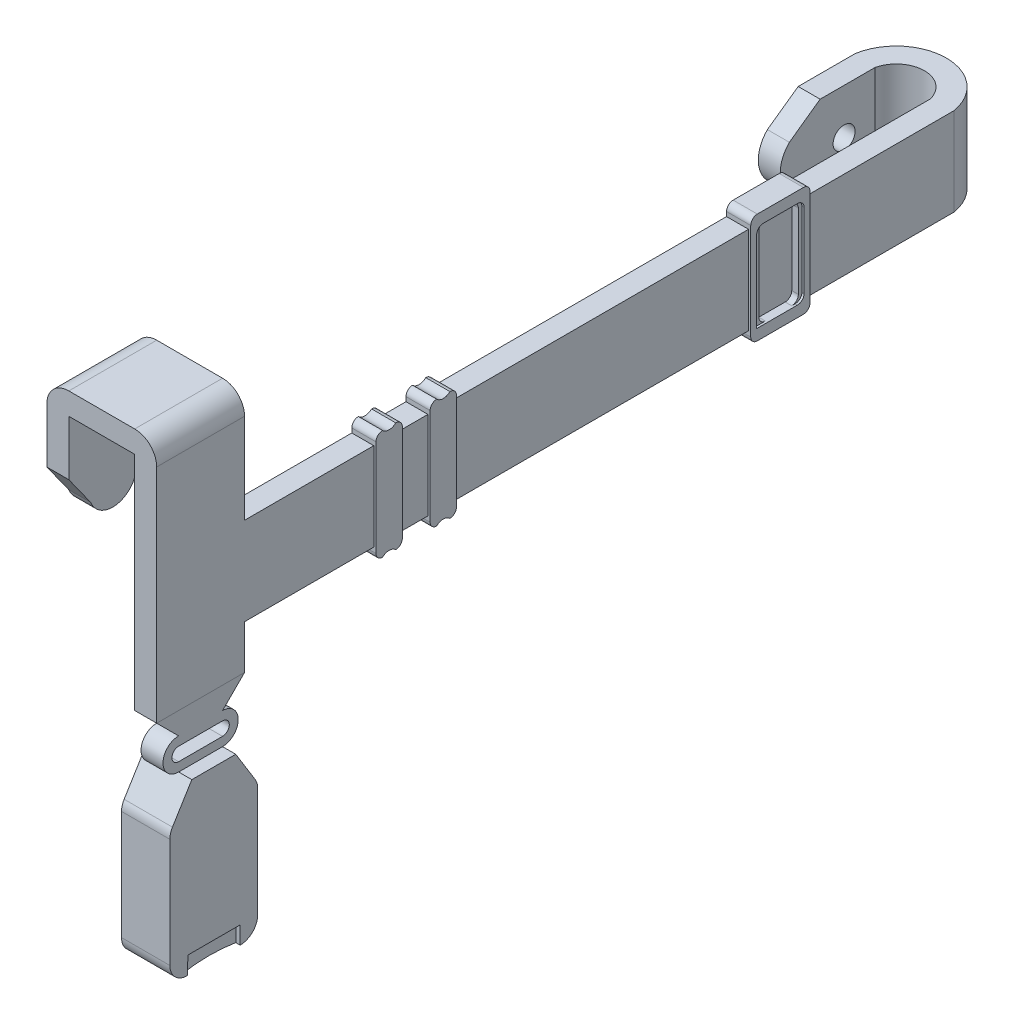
ISO-10303-21;
HEADER;
FILE_DESCRIPTION(('STEP AP214'),'2;1');
FILE_NAME('part.step','',(''),(''),'','','');
FILE_SCHEMA(('AUTOMOTIVE_DESIGN { 1 0 10303 214 1 1 1 1 }'));
ENDSEC;
DATA;
#1=APPLICATION_CONTEXT('core data for automotive mechanical design processes');
#2=APPLICATION_PROTOCOL_DEFINITION('international standard','automotive_design',2000,#1);
#3=PRODUCT_CONTEXT('',#1,'mechanical');
#4=PRODUCT('Part','Part','',(#3));
#5=PRODUCT_RELATED_PRODUCT_CATEGORY('part','',(#4));
#6=PRODUCT_DEFINITION_FORMATION('','',#4);
#7=PRODUCT_DEFINITION_CONTEXT('part definition',#1,'design');
#8=PRODUCT_DEFINITION('design','',#6,#7);
#9=PRODUCT_DEFINITION_SHAPE('','',#8);
#10=(LENGTH_UNIT() NAMED_UNIT(*) SI_UNIT(.MILLI.,.METRE.));
#11=(NAMED_UNIT(*) PLANE_ANGLE_UNIT() SI_UNIT($,.RADIAN.));
#12=(NAMED_UNIT(*) SI_UNIT($,.STERADIAN.) SOLID_ANGLE_UNIT());
#13=UNCERTAINTY_MEASURE_WITH_UNIT(LENGTH_MEASURE(1.E-05),#10,'distance_accuracy_value','');
#14=(GEOMETRIC_REPRESENTATION_CONTEXT(3) GLOBAL_UNCERTAINTY_ASSIGNED_CONTEXT((#13)) GLOBAL_UNIT_ASSIGNED_CONTEXT((#10,
#11,#12)) REPRESENTATION_CONTEXT('',''));
#15=CARTESIAN_POINT('',(0.,0.,0.));
#16=DIRECTION('',(0.,0.,1.));
#17=DIRECTION('',(1.,0.,0.));
#18=AXIS2_PLACEMENT_3D('',#15,#16,#17);
#19=CARTESIAN_POINT('',(16.,-194.917150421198,341.999155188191));
#20=DIRECTION('',(-1.,0.,0.));
#21=DIRECTION('',(0.,0.,1.));
#22=AXIS2_PLACEMENT_3D('',#19,#20,#21);
#23=CYLINDRICAL_SURFACE('',#22,75.3819737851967);
#24=DIRECTION('',(-1.,0.,0.));
#25=VECTOR('',#24,1.);
#26=CARTESIAN_POINT('',(16.,-120.496441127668,329.999155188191));
#27=LINE('',#26,#25);
#28=CARTESIAN_POINT('',(14.,-120.496441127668,329.999155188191));
#29=VERTEX_POINT('',#28);
#30=CARTESIAN_POINT('',(-5.99999999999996,-120.496441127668,329.999155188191));
#31=VERTEX_POINT('',#30);
#32=EDGE_CURVE('E283',#29,#31,#27,.T.);
#33=ORIENTED_EDGE('',*,*,#32,.F.);
#34=CARTESIAN_POINT('',(14.,-194.917150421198,341.999155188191));
#35=DIRECTION('',(1.,0.,0.));
#36=DIRECTION('',(0.,0.,-1.));
#37=AXIS2_PLACEMENT_3D('',#34,#35,#36);
#38=CIRCLE('',#37,75.3819737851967);
#39=CARTESIAN_POINT('',(14.,-120.496441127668,353.999155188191));
#40=VERTEX_POINT('',#39);
#41=EDGE_CURVE('E367',#29,#40,#38,.T.);
#42=ORIENTED_EDGE('',*,*,#41,.T.);
#43=DIRECTION('',(-1.,0.,0.));
#44=VECTOR('',#43,1.);
#45=CARTESIAN_POINT('',(16.,-120.496441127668,353.999155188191));
#46=LINE('',#45,#44);
#47=CARTESIAN_POINT('',(-5.99999999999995,-120.496441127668,353.999155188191));
#48=VERTEX_POINT('',#47);
#49=EDGE_CURVE('E279',#40,#48,#46,.T.);
#50=ORIENTED_EDGE('',*,*,#49,.T.);
#51=CARTESIAN_POINT('',(-5.99999999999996,-194.917150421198,341.999155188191));
#52=DIRECTION('',(1.,0.,0.));
#53=DIRECTION('',(0.,0.,-1.));
#54=AXIS2_PLACEMENT_3D('',#51,#52,#53);
#55=CIRCLE('',#54,75.3819737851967);
#56=EDGE_CURVE('E360',#31,#48,#55,.T.);
#57=ORIENTED_EDGE('',*,*,#56,.F.);
#58=EDGE_LOOP('',(#33,#42,#50,#57));
#59=FACE_BOUND('',#58,.T.);
#60=ADVANCED_FACE('F51',(#59),#23,.F.);
#61=CARTESIAN_POINT('',(16.,0.,0.));
#62=DIRECTION('',(1.,0.,0.));
#63=DIRECTION('',(0.,0.,-1.));
#64=AXIS2_PLACEMENT_3D('',#61,#62,#63);
#65=PLANE('',#64);
#66=CARTESIAN_POINT('',(16.,-112.496441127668,353.999155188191));
#67=DIRECTION('',(1.,0.,0.));
#68=DIRECTION('',(0.,0.,-1.));
#69=AXIS2_PLACEMENT_3D('',#66,#67,#68);
#70=CIRCLE('',#69,8.);
#71=CARTESIAN_POINT('',(16.,-112.496441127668,361.999155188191));
#72=VERTEX_POINT('',#71);
#73=CARTESIAN_POINT('',(16.,-120.496441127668,353.999155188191));
#74=VERTEX_POINT('',#73);
#75=EDGE_CURVE('E333',#72,#74,#70,.T.);
#76=ORIENTED_EDGE('',*,*,#75,.T.);
#77=DIRECTION('',(0.,-0.999636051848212,0.0269770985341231));
#78=VECTOR('',#77,1.);
#79=CARTESIAN_POINT('',(16.,-112.496441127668,353.7832598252));
#80=LINE('',#79,#78);
#81=CARTESIAN_POINT('',(16.,-112.496441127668,353.7832598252));
#82=VERTEX_POINT('',#81);
#83=EDGE_CURVE('E371',#82,#74,#80,.T.);
#84=ORIENTED_EDGE('',*,*,#83,.F.);
#85=DIRECTION('',(0.,0.,1.));
#86=VECTOR('',#85,1.);
#87=CARTESIAN_POINT('',(16.,-112.496441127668,329.999155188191));
#88=LINE('',#87,#86);
#89=CARTESIAN_POINT('',(16.,-112.496441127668,329.999155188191));
#90=VERTEX_POINT('',#89);
#91=EDGE_CURVE('E374',#90,#82,#88,.T.);
#92=ORIENTED_EDGE('',*,*,#91,.F.);
#93=DIRECTION('',(0.,1.,0.));
#94=VECTOR('',#93,1.);
#95=CARTESIAN_POINT('',(16.,-120.496441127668,329.999155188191));
#96=LINE('',#95,#94);
#97=CARTESIAN_POINT('',(16.,-120.496441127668,329.999155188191));
#98=VERTEX_POINT('',#97);
#99=EDGE_CURVE('E366',#98,#90,#96,.T.);
#100=ORIENTED_EDGE('',*,*,#99,.F.);
#101=CARTESIAN_POINT('',(16.,-112.496441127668,329.999155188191));
#102=DIRECTION('',(1.,0.,0.));
#103=DIRECTION('',(0.,0.,-1.));
#104=AXIS2_PLACEMENT_3D('',#101,#102,#103);
#105=CIRCLE('',#104,8.);
#106=CARTESIAN_POINT('',(16.,-112.496441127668,321.999155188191));
#107=VERTEX_POINT('',#106);
#108=EDGE_CURVE('E330',#98,#107,#105,.T.);
#109=ORIENTED_EDGE('',*,*,#108,.T.);
#110=DIRECTION('',(0.,1.,0.));
#111=VECTOR('',#110,1.);
#112=CARTESIAN_POINT('',(16.,0.,321.999155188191));
#113=LINE('',#112,#111);
#114=CARTESIAN_POINT('',(16.,-62.7602148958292,321.999155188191));
#115=VERTEX_POINT('',#114);
#116=EDGE_CURVE('E327',#107,#115,#113,.T.);
#117=ORIENTED_EDGE('',*,*,#116,.T.);
#118=CARTESIAN_POINT('',(16.,-62.7602148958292,329.999155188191));
#119=DIRECTION('',(1.,0.,0.));
#120=DIRECTION('',(0.,0.,-1.));
#121=AXIS2_PLACEMENT_3D('',#118,#119,#120);
#122=CIRCLE('',#121,8.00000000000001);
#123=CARTESIAN_POINT('',(16.,-58.5683245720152,323.185341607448));
#124=VERTEX_POINT('',#123);
#125=EDGE_CURVE('E324',#124,#115,#122,.F.);
#126=ORIENTED_EDGE('',*,*,#125,.F.);
#127=DIRECTION('',(0.,-0.851726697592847,-0.523986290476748));
#128=VECTOR('',#127,1.);
#129=CARTESIAN_POINT('',(16.,-160.316006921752,260.589686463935));
#130=LINE('',#129,#128);
#131=CARTESIAN_POINT('',(16.,-44.2416894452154,331.999155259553));
#132=VERTEX_POINT('',#131);
#133=EDGE_CURVE('E321',#132,#124,#130,.T.);
#134=ORIENTED_EDGE('',*,*,#133,.F.);
#135=DIRECTION('',(0.,0.,-1.));
#136=VECTOR('',#135,1.);
#137=CARTESIAN_POINT('',(16.,-44.2416894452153,0.));
#138=LINE('',#137,#136);
#139=CARTESIAN_POINT('',(16.,-44.2416894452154,351.999155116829));
#140=VERTEX_POINT('',#139);
#141=EDGE_CURVE('E318',#140,#132,#138,.T.);
#142=ORIENTED_EDGE('',*,*,#141,.F.);
#143=DIRECTION('',(0.,-0.851726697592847,0.523986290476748));
#144=VECTOR('',#143,1.);
#145=CARTESIAN_POINT('',(16.,144.947728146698,235.608931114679));
#146=LINE('',#145,#144);
#147=CARTESIAN_POINT('',(16.,-58.5683245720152,360.812968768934));
#148=VERTEX_POINT('',#147);
#149=EDGE_CURVE('E315',#140,#148,#146,.T.);
#150=ORIENTED_EDGE('',*,*,#149,.T.);
#151=CARTESIAN_POINT('',(16.,-62.7602148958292,353.999155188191));
#152=DIRECTION('',(1.,0.,0.));
#153=DIRECTION('',(0.,0.,-1.));
#154=AXIS2_PLACEMENT_3D('',#151,#152,#153);
#155=CIRCLE('',#154,8.00000000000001);
#156=CARTESIAN_POINT('',(16.,-62.7602148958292,361.999155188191));
#157=VERTEX_POINT('',#156);
#158=EDGE_CURVE('E312',#148,#157,#155,.T.);
#159=ORIENTED_EDGE('',*,*,#158,.T.);
#160=DIRECTION('',(0.,-1.,0.));
#161=VECTOR('',#160,1.);
#162=CARTESIAN_POINT('',(16.,0.,361.999155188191));
#163=LINE('',#162,#161);
#164=EDGE_CURVE('E309',#157,#72,#163,.T.);
#165=ORIENTED_EDGE('',*,*,#164,.T.);
#166=EDGE_LOOP('',(#76,#84,#92,#100,#109,#117,#126,#134,#142,#150,#159,#165));
#167=FACE_BOUND('',#166,.T.);
#168=ADVANCED_FACE('F215',(#167),#65,.T.);
#169=CARTESIAN_POINT('',(0.,-37.120844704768,331.999155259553));
#170=DIRECTION('',(1.,0.,0.));
#171=DIRECTION('',(0.,0.,-1.));
#172=AXIS2_PLACEMENT_3D('',#169,#170,#171);
#173=CYLINDRICAL_SURFACE('',#172,3.0509493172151);
#174=CARTESIAN_POINT('',(10.,-37.120844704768,331.999155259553));
#175=DIRECTION('',(1.,0.,0.));
#176=DIRECTION('',(0.,0.,-1.));
#177=AXIS2_PLACEMENT_3D('',#174,#175,#176);
#178=CIRCLE('',#177,3.0509493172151);
#179=CARTESIAN_POINT('',(10.,-40.1717940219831,331.999155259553));
#180=VERTEX_POINT('',#179);
#181=CARTESIAN_POINT('',(10.,-34.069895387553,331.999155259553));
#182=VERTEX_POINT('',#181);
#183=EDGE_CURVE('E171',#180,#182,#178,.T.);
#184=ORIENTED_EDGE('',*,*,#183,.T.);
#185=DIRECTION('',(1.,0.,0.));
#186=VECTOR('',#185,1.);
#187=CARTESIAN_POINT('',(0.,-34.069895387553,331.999155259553));
#188=LINE('',#187,#186);
#189=CARTESIAN_POINT('',(0.,-34.069895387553,331.999155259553));
#190=VERTEX_POINT('',#189);
#191=EDGE_CURVE('E12',#190,#182,#188,.T.);
#192=ORIENTED_EDGE('',*,*,#191,.F.);
#193=CARTESIAN_POINT('',(0.,-37.120844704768,331.999155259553));
#194=DIRECTION('',(1.,0.,0.));
#195=DIRECTION('',(0.,0.,-1.));
#196=AXIS2_PLACEMENT_3D('',#193,#194,#195);
#197=CIRCLE('',#196,3.0509493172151);
#198=CARTESIAN_POINT('',(0.,-40.1717940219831,331.999155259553));
#199=VERTEX_POINT('',#198);
#200=EDGE_CURVE('E70',#199,#190,#197,.T.);
#201=ORIENTED_EDGE('',*,*,#200,.F.);
#202=DIRECTION('',(1.,0.,0.));
#203=VECTOR('',#202,1.);
#204=CARTESIAN_POINT('',(0.,-40.1717940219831,331.999155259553));
#205=LINE('',#204,#203);
#206=EDGE_CURVE('E142',#199,#180,#205,.T.);
#207=ORIENTED_EDGE('',*,*,#206,.T.);
#208=EDGE_LOOP('',(#184,#192,#201,#207));
#209=FACE_BOUND('',#208,.T.);
#210=ADVANCED_FACE('F221',(#209),#173,.F.);
#211=CARTESIAN_POINT('',(0.,-34.069895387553,0.));
#212=DIRECTION('',(0.,-1.,0.));
#213=DIRECTION('',(0.,0.,-1.));
#214=AXIS2_PLACEMENT_3D('',#211,#212,#213);
#215=PLANE('',#214);
#216=DIRECTION('',(0.,0.,-1.));
#217=VECTOR('',#216,1.);
#218=CARTESIAN_POINT('',(10.,-34.069895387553,0.));
#219=LINE('',#218,#217);
#220=CARTESIAN_POINT('',(10.,-34.069895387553,351.999155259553));
#221=VERTEX_POINT('',#220);
#222=EDGE_CURVE('E176',#221,#182,#219,.T.);
#223=ORIENTED_EDGE('',*,*,#222,.F.);
#224=DIRECTION('',(1.,0.,0.));
#225=VECTOR('',#224,1.);
#226=CARTESIAN_POINT('',(0.,-34.069895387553,351.999155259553));
#227=LINE('',#226,#225);
#228=CARTESIAN_POINT('',(0.,-34.069895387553,351.999155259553));
#229=VERTEX_POINT('',#228);
#230=EDGE_CURVE('E61',#229,#221,#227,.T.);
#231=ORIENTED_EDGE('',*,*,#230,.F.);
#232=DIRECTION('',(0.,0.,-1.));
#233=VECTOR('',#232,1.);
#234=CARTESIAN_POINT('',(0.,-34.069895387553,0.));
#235=LINE('',#234,#233);
#236=EDGE_CURVE('E134',#229,#190,#235,.T.);
#237=ORIENTED_EDGE('',*,*,#236,.T.);
#238=ORIENTED_EDGE('',*,*,#191,.T.);
#239=EDGE_LOOP('',(#223,#231,#237,#238));
#240=FACE_BOUND('',#239,.T.);
#241=ADVANCED_FACE('F239',(#240),#215,.T.);
#242=CARTESIAN_POINT('',(0.,-37.120844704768,351.999155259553));
#243=DIRECTION('',(1.,0.,0.));
#244=DIRECTION('',(0.,0.,-1.));
#245=AXIS2_PLACEMENT_3D('',#242,#243,#244);
#246=CYLINDRICAL_SURFACE('',#245,3.0509493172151);
#247=CARTESIAN_POINT('',(10.,-37.120844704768,351.999155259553));
#248=DIRECTION('',(1.,0.,0.));
#249=DIRECTION('',(0.,0.,-1.));
#250=AXIS2_PLACEMENT_3D('',#247,#248,#249);
#251=CIRCLE('',#250,3.0509493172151);
#252=CARTESIAN_POINT('',(10.,-40.1717940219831,351.999155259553));
#253=VERTEX_POINT('',#252);
#254=EDGE_CURVE('E139',#221,#253,#251,.T.);
#255=ORIENTED_EDGE('',*,*,#254,.T.);
#256=DIRECTION('',(1.,0.,0.));
#257=VECTOR('',#256,1.);
#258=CARTESIAN_POINT('',(0.,-40.1717940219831,351.999155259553));
#259=LINE('',#258,#257);
#260=CARTESIAN_POINT('',(0.,-40.1717940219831,351.999155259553));
#261=VERTEX_POINT('',#260);
#262=EDGE_CURVE('E137',#261,#253,#259,.T.);
#263=ORIENTED_EDGE('',*,*,#262,.F.);
#264=CARTESIAN_POINT('',(0.,-37.120844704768,351.999155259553));
#265=DIRECTION('',(1.,0.,0.));
#266=DIRECTION('',(0.,0.,-1.));
#267=AXIS2_PLACEMENT_3D('',#264,#265,#266);
#268=CIRCLE('',#267,3.0509493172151);
#269=EDGE_CURVE('E128',#229,#261,#268,.T.);
#270=ORIENTED_EDGE('',*,*,#269,.F.);
#271=ORIENTED_EDGE('',*,*,#230,.T.);
#272=EDGE_LOOP('',(#255,#263,#270,#271));
#273=FACE_BOUND('',#272,.T.);
#274=ADVANCED_FACE('F138',(#273),#246,.F.);
#275=CARTESIAN_POINT('',(0.,-191.000844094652,190.984710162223));
#276=DIRECTION('',(0.,0.707136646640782,-0.707076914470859));
#277=DIRECTION('',(0.,0.707076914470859,0.707136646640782));
#278=AXIS2_PLACEMENT_3D('',#275,#276,#277);
#279=PLANE('',#278);
#280=DIRECTION('',(0.,0.707076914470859,0.707136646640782));
#281=VECTOR('',#280,1.);
#282=CARTESIAN_POINT('',(10.,-191.000844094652,190.984710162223));
#283=LINE('',#282,#281);
#284=CARTESIAN_POINT('',(10.,-29.9999999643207,351.999155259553));
#285=VERTEX_POINT('',#284);
#286=CARTESIAN_POINT('',(10.,-20.,362.));
#287=VERTEX_POINT('',#286);
#288=EDGE_CURVE('E152',#285,#287,#283,.T.);
#289=ORIENTED_EDGE('',*,*,#288,.T.);
#290=DIRECTION('',(1.,0.,0.));
#291=VECTOR('',#290,1.);
#292=CARTESIAN_POINT('',(0.,-20.,362.));
#293=LINE('',#292,#291);
#294=CARTESIAN_POINT('',(0.,-20.,362.));
#295=VERTEX_POINT('',#294);
#296=EDGE_CURVE('E182',#295,#287,#293,.T.);
#297=ORIENTED_EDGE('',*,*,#296,.F.);
#298=DIRECTION('',(0.,0.707076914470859,0.707136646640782));
#299=VECTOR('',#298,1.);
#300=CARTESIAN_POINT('',(0.,-191.000844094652,190.984710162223));
#301=LINE('',#300,#299);
#302=CARTESIAN_POINT('',(0.,-29.9999999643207,351.999155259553));
#303=VERTEX_POINT('',#302);
#304=EDGE_CURVE('E178',#303,#295,#301,.T.);
#305=ORIENTED_EDGE('',*,*,#304,.F.);
#306=DIRECTION('',(1.,0.,0.));
#307=VECTOR('',#306,1.);
#308=CARTESIAN_POINT('',(0.,-29.9999999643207,351.999155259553));
#309=LINE('',#308,#307);
#310=EDGE_CURVE('E55',#303,#285,#309,.T.);
#311=ORIENTED_EDGE('',*,*,#310,.T.);
#312=EDGE_LOOP('',(#289,#297,#305,#311));
#313=FACE_BOUND('',#312,.T.);
#314=ADVANCED_FACE('F53',(#313),#279,.F.);
#315=CARTESIAN_POINT('',(0.,-20.,0.));
#316=DIRECTION('',(0.,-1.,0.));
#317=DIRECTION('',(0.,0.,-1.));
#318=AXIS2_PLACEMENT_3D('',#315,#316,#317);
#319=PLANE('',#318);
#320=DIRECTION('',(0.,0.,-1.));
#321=VECTOR('',#320,1.);
#322=CARTESIAN_POINT('',(10.,-20.,0.));
#323=LINE('',#322,#321);
#324=CARTESIAN_POINT('',(10.,-20.,322.));
#325=VERTEX_POINT('',#324);
#326=EDGE_CURVE('E168',#287,#325,#323,.T.);
#327=ORIENTED_EDGE('',*,*,#326,.T.);
#328=DIRECTION('',(1.,0.,0.));
#329=VECTOR('',#328,1.);
#330=CARTESIAN_POINT('',(0.,-20.,322.));
#331=LINE('',#330,#329);
#332=CARTESIAN_POINT('',(0.,-20.,322.));
#333=VERTEX_POINT('',#332);
#334=EDGE_CURVE('E185',#333,#325,#331,.T.);
#335=ORIENTED_EDGE('',*,*,#334,.F.);
#336=DIRECTION('',(0.,0.,-1.));
#337=VECTOR('',#336,1.);
#338=CARTESIAN_POINT('',(0.,-20.,0.));
#339=LINE('',#338,#337);
#340=EDGE_CURVE('E147',#295,#333,#339,.T.);
#341=ORIENTED_EDGE('',*,*,#340,.F.);
#342=ORIENTED_EDGE('',*,*,#296,.T.);
#343=EDGE_LOOP('',(#327,#335,#341,#342));
#344=FACE_BOUND('',#343,.T.);
#345=ADVANCED_FACE('F247',(#344),#319,.F.);
#346=CARTESIAN_POINT('',(0.,151.00084416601,151.013600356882));
#347=DIRECTION('',(0.,-0.707076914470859,-0.707136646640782));
#348=DIRECTION('',(0.,0.707136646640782,-0.707076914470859));
#349=AXIS2_PLACEMENT_3D('',#346,#347,#348);
#350=PLANE('',#349);
#351=DIRECTION('',(0.,0.707136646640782,-0.707076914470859));
#352=VECTOR('',#351,1.);
#353=CARTESIAN_POINT('',(10.,151.00084416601,151.013600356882));
#354=LINE('',#353,#352);
#355=CARTESIAN_POINT('',(10.,-29.9999999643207,331.999155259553));
#356=VERTEX_POINT('',#355);
#357=EDGE_CURVE('E165',#356,#325,#354,.T.);
#358=ORIENTED_EDGE('',*,*,#357,.F.);
#359=DIRECTION('',(1.,0.,0.));
#360=VECTOR('',#359,1.);
#361=CARTESIAN_POINT('',(0.,-29.9999999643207,331.999155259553));
#362=LINE('',#361,#360);
#363=CARTESIAN_POINT('',(0.,-29.9999999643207,331.999155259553));
#364=VERTEX_POINT('',#363);
#365=EDGE_CURVE('E187',#364,#356,#362,.T.);
#366=ORIENTED_EDGE('',*,*,#365,.F.);
#367=DIRECTION('',(0.,0.707136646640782,-0.707076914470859));
#368=VECTOR('',#367,1.);
#369=CARTESIAN_POINT('',(0.,151.00084416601,151.013600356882));
#370=LINE('',#369,#368);
#371=EDGE_CURVE('E267',#364,#333,#370,.T.);
#372=ORIENTED_EDGE('',*,*,#371,.T.);
#373=ORIENTED_EDGE('',*,*,#334,.T.);
#374=EDGE_LOOP('',(#358,#366,#372,#373));
#375=FACE_BOUND('',#374,.T.);
#376=ADVANCED_FACE('F211',(#375),#350,.T.);
#377=CARTESIAN_POINT('',(0.,-37.120844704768,331.999155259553));
#378=DIRECTION('',(1.,0.,0.));
#379=DIRECTION('',(0.,0.,-1.));
#380=AXIS2_PLACEMENT_3D('',#377,#378,#379);
#381=CYLINDRICAL_SURFACE('',#380,7.12084474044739);
#382=CARTESIAN_POINT('',(10.,-37.120844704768,331.999155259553));
#383=DIRECTION('',(1.,0.,0.));
#384=DIRECTION('',(0.,0.,-1.));
#385=AXIS2_PLACEMENT_3D('',#382,#383,#384);
#386=CIRCLE('',#385,7.12084474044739);
#387=CARTESIAN_POINT('',(10.,-44.2416894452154,331.999155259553));
#388=VERTEX_POINT('',#387);
#389=EDGE_CURVE('E162',#356,#388,#386,.F.);
#390=ORIENTED_EDGE('',*,*,#389,.T.);
#391=DIRECTION('',(1.,0.,0.));
#392=VECTOR('',#391,1.);
#393=CARTESIAN_POINT('',(0.,-44.2416894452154,331.999155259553));
#394=LINE('',#393,#392);
#395=CARTESIAN_POINT('',(0.,-44.2416894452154,331.999155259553));
#396=VERTEX_POINT('',#395);
#397=EDGE_CURVE('E189',#396,#388,#394,.T.);
#398=ORIENTED_EDGE('',*,*,#397,.F.);
#399=CARTESIAN_POINT('',(0.,-37.120844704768,331.999155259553));
#400=DIRECTION('',(1.,0.,0.));
#401=DIRECTION('',(0.,0.,-1.));
#402=AXIS2_PLACEMENT_3D('',#399,#400,#401);
#403=CIRCLE('',#402,7.12084474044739);
#404=EDGE_CURVE('E264',#364,#396,#403,.F.);
#405=ORIENTED_EDGE('',*,*,#404,.F.);
#406=ORIENTED_EDGE('',*,*,#365,.T.);
#407=EDGE_LOOP('',(#390,#398,#405,#406));
#408=FACE_BOUND('',#407,.T.);
#409=ADVANCED_FACE('F205',(#408),#381,.T.);
#410=CARTESIAN_POINT('',(0.,-37.120844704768,351.999155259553));
#411=DIRECTION('',(1.,0.,0.));
#412=DIRECTION('',(0.,0.,-1.));
#413=AXIS2_PLACEMENT_3D('',#410,#411,#412);
#414=CYLINDRICAL_SURFACE('',#413,7.12084474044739);
#415=CARTESIAN_POINT('',(10.,-37.120844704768,351.999155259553));
#416=DIRECTION('',(1.,0.,0.));
#417=DIRECTION('',(0.,0.,-1.));
#418=AXIS2_PLACEMENT_3D('',#415,#416,#417);
#419=CIRCLE('',#418,7.12084474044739);
#420=CARTESIAN_POINT('',(10.,-44.2416894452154,351.999155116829));
#421=VERTEX_POINT('',#420);
#422=EDGE_CURVE('E155',#285,#421,#419,.T.);
#423=ORIENTED_EDGE('',*,*,#422,.F.);
#424=ORIENTED_EDGE('',*,*,#310,.F.);
#425=CARTESIAN_POINT('',(0.,-37.120844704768,351.999155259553));
#426=DIRECTION('',(1.,0.,0.));
#427=DIRECTION('',(0.,0.,-1.));
#428=AXIS2_PLACEMENT_3D('',#425,#426,#427);
#429=CIRCLE('',#428,7.12084474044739);
#430=CARTESIAN_POINT('',(0.,-44.2416894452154,351.999155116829));
#431=VERTEX_POINT('',#430);
#432=EDGE_CURVE('E274',#303,#431,#429,.T.);
#433=ORIENTED_EDGE('',*,*,#432,.T.);
#434=DIRECTION('',(1.,0.,0.));
#435=VECTOR('',#434,1.);
#436=CARTESIAN_POINT('',(0.,-44.2416894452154,351.999155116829));
#437=LINE('',#436,#435);
#438=EDGE_CURVE('E191',#431,#421,#437,.T.);
#439=ORIENTED_EDGE('',*,*,#438,.T.);
#440=EDGE_LOOP('',(#423,#424,#433,#439));
#441=FACE_BOUND('',#440,.T.);
#442=ADVANCED_FACE('F203',(#441),#414,.T.);
#443=CARTESIAN_POINT('',(0.,-40.1717940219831,0.));
#444=DIRECTION('',(0.,-1.,0.));
#445=DIRECTION('',(0.,0.,-1.));
#446=AXIS2_PLACEMENT_3D('',#443,#444,#445);
#447=PLANE('',#446);
#448=DIRECTION('',(0.,0.,-1.));
#449=VECTOR('',#448,1.);
#450=CARTESIAN_POINT('',(10.,-40.1717940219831,0.));
#451=LINE('',#450,#449);
#452=EDGE_CURVE('E173',#253,#180,#451,.T.);
#453=ORIENTED_EDGE('',*,*,#452,.T.);
#454=ORIENTED_EDGE('',*,*,#206,.F.);
#455=DIRECTION('',(0.,0.,-1.));
#456=VECTOR('',#455,1.);
#457=CARTESIAN_POINT('',(0.,-40.1717940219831,0.));
#458=LINE('',#457,#456);
#459=EDGE_CURVE('E132',#261,#199,#458,.T.);
#460=ORIENTED_EDGE('',*,*,#459,.F.);
#461=ORIENTED_EDGE('',*,*,#262,.T.);
#462=EDGE_LOOP('',(#453,#454,#460,#461));
#463=FACE_BOUND('',#462,.T.);
#464=ADVANCED_FACE('F144',(#463),#447,.F.);
#465=CARTESIAN_POINT('',(0.,0.,0.));
#466=DIRECTION('',(1.,0.,0.));
#467=DIRECTION('',(0.,0.,-1.));
#468=AXIS2_PLACEMENT_3D('',#465,#466,#467);
#469=PLANE('',#468);
#470=ORIENTED_EDGE('',*,*,#304,.T.);
#471=ORIENTED_EDGE('',*,*,#340,.T.);
#472=ORIENTED_EDGE('',*,*,#371,.F.);
#473=ORIENTED_EDGE('',*,*,#404,.T.);
#474=DIRECTION('',(0.,0.,-1.));
#475=VECTOR('',#474,1.);
#476=CARTESIAN_POINT('',(0.,-44.2416894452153,0.));
#477=LINE('',#476,#475);
#478=EDGE_CURVE('E268',#431,#396,#477,.T.);
#479=ORIENTED_EDGE('',*,*,#478,.F.);
#480=ORIENTED_EDGE('',*,*,#432,.F.);
#481=EDGE_LOOP('',(#470,#471,#472,#473,#479,#480));
#482=FACE_BOUND('',#481,.T.);
#483=ORIENTED_EDGE('',*,*,#200,.T.);
#484=ORIENTED_EDGE('',*,*,#236,.F.);
#485=ORIENTED_EDGE('',*,*,#269,.T.);
#486=ORIENTED_EDGE('',*,*,#459,.T.);
#487=EDGE_LOOP('',(#483,#484,#485,#486));
#488=FACE_BOUND('',#487,.T.);
#489=ADVANCED_FACE('F130',(#482,#488),#469,.F.);
#490=CARTESIAN_POINT('',(10.,0.,0.));
#491=DIRECTION('',(1.,0.,0.));
#492=DIRECTION('',(0.,0.,-1.));
#493=AXIS2_PLACEMENT_3D('',#490,#491,#492);
#494=PLANE('',#493);
#495=ORIENTED_EDGE('',*,*,#288,.F.);
#496=ORIENTED_EDGE('',*,*,#422,.T.);
#497=DIRECTION('',(0.,0.,-1.));
#498=VECTOR('',#497,1.);
#499=CARTESIAN_POINT('',(10.,-44.2416894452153,0.));
#500=LINE('',#499,#498);
#501=EDGE_CURVE('E159',#421,#388,#500,.T.);
#502=ORIENTED_EDGE('',*,*,#501,.T.);
#503=ORIENTED_EDGE('',*,*,#389,.F.);
#504=ORIENTED_EDGE('',*,*,#357,.T.);
#505=ORIENTED_EDGE('',*,*,#326,.F.);
#506=EDGE_LOOP('',(#495,#496,#502,#503,#504,#505));
#507=FACE_BOUND('',#506,.T.);
#508=ORIENTED_EDGE('',*,*,#183,.F.);
#509=ORIENTED_EDGE('',*,*,#452,.F.);
#510=ORIENTED_EDGE('',*,*,#254,.F.);
#511=ORIENTED_EDGE('',*,*,#222,.T.);
#512=EDGE_LOOP('',(#508,#509,#510,#511));
#513=FACE_BOUND('',#512,.T.);
#514=ADVANCED_FACE('F201',(#507,#513),#494,.T.);
#515=CARTESIAN_POINT('',(16.,-44.2416894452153,0.));
#516=DIRECTION('',(0.,1.,0.));
#517=DIRECTION('',(0.,0.,1.));
#518=AXIS2_PLACEMENT_3D('',#515,#516,#517);
#519=PLANE('',#518);
#520=ORIENTED_EDGE('',*,*,#478,.T.);
#521=DIRECTION('',(-1.,0.,0.));
#522=VECTOR('',#521,1.);
#523=CARTESIAN_POINT('',(16.,-44.2416894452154,331.999155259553));
#524=LINE('',#523,#522);
#525=CARTESIAN_POINT('',(-5.99999999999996,-44.2416894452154,331.999155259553));
#526=VERTEX_POINT('',#525);
#527=EDGE_CURVE('E295',#396,#526,#524,.T.);
#528=ORIENTED_EDGE('',*,*,#527,.T.);
#529=DIRECTION('',(0.,0.,-1.));
#530=VECTOR('',#529,1.);
#531=CARTESIAN_POINT('',(-6.,-44.2416894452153,0.));
#532=LINE('',#531,#530);
#533=CARTESIAN_POINT('',(-5.99999999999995,-44.2416894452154,351.999155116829));
#534=VERTEX_POINT('',#533);
#535=EDGE_CURVE('E345',#534,#526,#532,.T.);
#536=ORIENTED_EDGE('',*,*,#535,.F.);
#537=DIRECTION('',(-1.,0.,0.));
#538=VECTOR('',#537,1.);
#539=CARTESIAN_POINT('',(16.,-44.2416894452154,351.999155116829));
#540=LINE('',#539,#538);
#541=EDGE_CURVE('E299',#431,#534,#540,.T.);
#542=ORIENTED_EDGE('',*,*,#541,.F.);
#543=EDGE_LOOP('',(#520,#528,#536,#542));
#544=FACE_BOUND('',#543,.T.);
#545=ADVANCED_FACE('F232',(#544),#519,.T.);
#546=CARTESIAN_POINT('',(16.,-112.496441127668,353.999155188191));
#547=DIRECTION('',(-1.,0.,0.));
#548=DIRECTION('',(0.,0.,1.));
#549=AXIS2_PLACEMENT_3D('',#546,#547,#548);
#550=CYLINDRICAL_SURFACE('',#549,8.);
#551=DIRECTION('',(-1.,0.,0.));
#552=VECTOR('',#551,1.);
#553=CARTESIAN_POINT('',(16.,-112.496441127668,361.999155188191));
#554=LINE('',#553,#552);
#555=CARTESIAN_POINT('',(-5.99999999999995,-112.496441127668,361.999155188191));
#556=VERTEX_POINT('',#555);
#557=EDGE_CURVE('E306',#72,#556,#554,.T.);
#558=ORIENTED_EDGE('',*,*,#557,.T.);
#559=CARTESIAN_POINT('',(-5.99999999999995,-112.496441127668,353.999155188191));
#560=DIRECTION('',(1.,0.,0.));
#561=DIRECTION('',(0.,0.,-1.));
#562=AXIS2_PLACEMENT_3D('',#559,#560,#561);
#563=CIRCLE('',#562,8.);
#564=EDGE_CURVE('E363',#556,#48,#563,.T.);
#565=ORIENTED_EDGE('',*,*,#564,.T.);
#566=ORIENTED_EDGE('',*,*,#49,.F.);
#567=EDGE_CURVE('E156',#74,#40,#46,.T.);
#568=ORIENTED_EDGE('',*,*,#567,.F.);
#569=ORIENTED_EDGE('',*,*,#75,.F.);
#570=EDGE_LOOP('',(#558,#565,#566,#568,#569));
#571=FACE_BOUND('',#570,.T.);
#572=ADVANCED_FACE('F229',(#571),#550,.T.);
#573=CARTESIAN_POINT('',(16.,-112.496441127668,329.999155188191));
#574=DIRECTION('',(-1.,0.,0.));
#575=DIRECTION('',(0.,0.,1.));
#576=AXIS2_PLACEMENT_3D('',#573,#574,#575);
#577=CYLINDRICAL_SURFACE('',#576,8.);
#578=EDGE_CURVE('E280',#98,#29,#27,.T.);
#579=ORIENTED_EDGE('',*,*,#578,.T.);
#580=ORIENTED_EDGE('',*,*,#32,.T.);
#581=CARTESIAN_POINT('',(-5.99999999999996,-112.496441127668,329.999155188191));
#582=DIRECTION('',(1.,0.,0.));
#583=DIRECTION('',(0.,0.,-1.));
#584=AXIS2_PLACEMENT_3D('',#581,#582,#583);
#585=CIRCLE('',#584,8.);
#586=CARTESIAN_POINT('',(-5.99999999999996,-112.496441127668,321.999155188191));
#587=VERTEX_POINT('',#586);
#588=EDGE_CURVE('E357',#31,#587,#585,.T.);
#589=ORIENTED_EDGE('',*,*,#588,.T.);
#590=DIRECTION('',(-1.,0.,0.));
#591=VECTOR('',#590,1.);
#592=CARTESIAN_POINT('',(16.,-112.496441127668,321.999155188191));
#593=LINE('',#592,#591);
#594=EDGE_CURVE('E284',#107,#587,#593,.T.);
#595=ORIENTED_EDGE('',*,*,#594,.F.);
#596=ORIENTED_EDGE('',*,*,#108,.F.);
#597=EDGE_LOOP('',(#579,#580,#589,#595,#596));
#598=FACE_BOUND('',#597,.T.);
#599=ADVANCED_FACE('F227',(#598),#577,.T.);
#600=CARTESIAN_POINT('',(16.,0.,321.999155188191));
#601=DIRECTION('',(0.,0.,1.));
#602=DIRECTION('',(1.,0.,0.));
#603=AXIS2_PLACEMENT_3D('',#600,#601,#602);
#604=PLANE('',#603);
#605=ORIENTED_EDGE('',*,*,#594,.T.);
#606=DIRECTION('',(0.,1.,0.));
#607=VECTOR('',#606,1.);
#608=CARTESIAN_POINT('',(-5.99999999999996,0.,321.999155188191));
#609=LINE('',#608,#607);
#610=CARTESIAN_POINT('',(-5.99999999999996,-62.7602148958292,321.999155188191));
#611=VERTEX_POINT('',#610);
#612=EDGE_CURVE('E354',#587,#611,#609,.T.);
#613=ORIENTED_EDGE('',*,*,#612,.T.);
#614=DIRECTION('',(-1.,0.,0.));
#615=VECTOR('',#614,1.);
#616=CARTESIAN_POINT('',(16.,-62.7602148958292,321.999155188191));
#617=LINE('',#616,#615);
#618=EDGE_CURVE('E287',#115,#611,#617,.T.);
#619=ORIENTED_EDGE('',*,*,#618,.F.);
#620=ORIENTED_EDGE('',*,*,#116,.F.);
#621=EDGE_LOOP('',(#605,#613,#619,#620));
#622=FACE_BOUND('',#621,.T.);
#623=ADVANCED_FACE('F513',(#622),#604,.F.);
#624=CARTESIAN_POINT('',(16.,-62.7602148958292,329.999155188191));
#625=DIRECTION('',(-1.,0.,0.));
#626=DIRECTION('',(0.,0.,1.));
#627=AXIS2_PLACEMENT_3D('',#624,#625,#626);
#628=CYLINDRICAL_SURFACE('',#627,8.00000000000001);
#629=ORIENTED_EDGE('',*,*,#618,.T.);
#630=CARTESIAN_POINT('',(-5.99999999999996,-62.7602148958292,329.999155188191));
#631=DIRECTION('',(1.,0.,0.));
#632=DIRECTION('',(0.,0.,-1.));
#633=AXIS2_PLACEMENT_3D('',#630,#631,#632);
#634=CIRCLE('',#633,8.00000000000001);
#635=CARTESIAN_POINT('',(-5.99999999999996,-58.5683245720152,323.185341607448));
#636=VERTEX_POINT('',#635);
#637=EDGE_CURVE('E351',#636,#611,#634,.F.);
#638=ORIENTED_EDGE('',*,*,#637,.F.);
#639=DIRECTION('',(-1.,0.,0.));
#640=VECTOR('',#639,1.);
#641=CARTESIAN_POINT('',(16.,-58.5683245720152,323.185341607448));
#642=LINE('',#641,#640);
#643=EDGE_CURVE('E290',#124,#636,#642,.T.);
#644=ORIENTED_EDGE('',*,*,#643,.F.);
#645=ORIENTED_EDGE('',*,*,#125,.T.);
#646=EDGE_LOOP('',(#629,#638,#644,#645));
#647=FACE_BOUND('',#646,.T.);
#648=ADVANCED_FACE('F515',(#647),#628,.T.);
#649=CARTESIAN_POINT('',(16.,-160.316006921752,260.589686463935));
#650=DIRECTION('',(0.,0.523986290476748,-0.851726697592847));
#651=DIRECTION('',(0.,0.851726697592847,0.523986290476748));
#652=AXIS2_PLACEMENT_3D('',#649,#650,#651);
#653=PLANE('',#652);
#654=ORIENTED_EDGE('',*,*,#643,.T.);
#655=DIRECTION('',(0.,-0.851726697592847,-0.523986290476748));
#656=VECTOR('',#655,1.);
#657=CARTESIAN_POINT('',(-5.99999999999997,-160.316006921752,260.589686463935));
#658=LINE('',#657,#656);
#659=EDGE_CURVE('E348',#526,#636,#658,.T.);
#660=ORIENTED_EDGE('',*,*,#659,.F.);
#661=ORIENTED_EDGE('',*,*,#527,.F.);
#662=ORIENTED_EDGE('',*,*,#397,.T.);
#663=EDGE_CURVE('E293',#132,#388,#524,.T.);
#664=ORIENTED_EDGE('',*,*,#663,.F.);
#665=ORIENTED_EDGE('',*,*,#133,.T.);
#666=EDGE_LOOP('',(#654,#660,#661,#662,#664,#665));
#667=FACE_BOUND('',#666,.T.);
#668=ADVANCED_FACE('F491',(#667),#653,.T.);
#669=ORIENTED_EDGE('',*,*,#663,.T.);
#670=ORIENTED_EDGE('',*,*,#501,.F.);
#671=EDGE_CURVE('E296',#140,#421,#540,.T.);
#672=ORIENTED_EDGE('',*,*,#671,.F.);
#673=ORIENTED_EDGE('',*,*,#141,.T.);
#674=EDGE_LOOP('',(#669,#670,#672,#673));
#675=FACE_BOUND('',#674,.T.);
#676=ADVANCED_FACE('F487',(#675),#519,.T.);
#677=CARTESIAN_POINT('',(16.,144.947728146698,235.608931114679));
#678=DIRECTION('',(0.,-0.523986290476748,-0.851726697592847));
#679=DIRECTION('',(0.,0.851726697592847,-0.523986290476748));
#680=AXIS2_PLACEMENT_3D('',#677,#678,#679);
#681=PLANE('',#680);
#682=ORIENTED_EDGE('',*,*,#671,.T.);
#683=ORIENTED_EDGE('',*,*,#438,.F.);
#684=ORIENTED_EDGE('',*,*,#541,.T.);
#685=DIRECTION('',(0.,-0.851726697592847,0.523986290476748));
#686=VECTOR('',#685,1.);
#687=CARTESIAN_POINT('',(-5.99999999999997,144.947728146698,235.608931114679));
#688=LINE('',#687,#686);
#689=CARTESIAN_POINT('',(-5.99999999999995,-58.5683245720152,360.812968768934));
#690=VERTEX_POINT('',#689);
#691=EDGE_CURVE('E342',#534,#690,#688,.T.);
#692=ORIENTED_EDGE('',*,*,#691,.T.);
#693=DIRECTION('',(-1.,0.,0.));
#694=VECTOR('',#693,1.);
#695=CARTESIAN_POINT('',(16.,-58.5683245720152,360.812968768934));
#696=LINE('',#695,#694);
#697=EDGE_CURVE('E300',#148,#690,#696,.T.);
#698=ORIENTED_EDGE('',*,*,#697,.F.);
#699=ORIENTED_EDGE('',*,*,#149,.F.);
#700=EDGE_LOOP('',(#682,#683,#684,#692,#698,#699));
#701=FACE_BOUND('',#700,.T.);
#702=ADVANCED_FACE('F483',(#701),#681,.F.);
#703=CARTESIAN_POINT('',(16.,-62.7602148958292,353.999155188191));
#704=DIRECTION('',(-1.,0.,0.));
#705=DIRECTION('',(0.,0.,1.));
#706=AXIS2_PLACEMENT_3D('',#703,#704,#705);
#707=CYLINDRICAL_SURFACE('',#706,8.00000000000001);
#708=ORIENTED_EDGE('',*,*,#697,.T.);
#709=CARTESIAN_POINT('',(-5.99999999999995,-62.7602148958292,353.999155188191));
#710=DIRECTION('',(1.,0.,0.));
#711=DIRECTION('',(0.,0.,-1.));
#712=AXIS2_PLACEMENT_3D('',#709,#710,#711);
#713=CIRCLE('',#712,8.00000000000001);
#714=CARTESIAN_POINT('',(-5.99999999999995,-62.7602148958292,361.999155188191));
#715=VERTEX_POINT('',#714);
#716=EDGE_CURVE('E339',#690,#715,#713,.T.);
#717=ORIENTED_EDGE('',*,*,#716,.T.);
#718=DIRECTION('',(-1.,0.,0.));
#719=VECTOR('',#718,1.);
#720=CARTESIAN_POINT('',(16.,-62.7602148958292,361.999155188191));
#721=LINE('',#720,#719);
#722=EDGE_CURVE('E303',#157,#715,#721,.T.);
#723=ORIENTED_EDGE('',*,*,#722,.F.);
#724=ORIENTED_EDGE('',*,*,#158,.F.);
#725=EDGE_LOOP('',(#708,#717,#723,#724));
#726=FACE_BOUND('',#725,.T.);
#727=ADVANCED_FACE('F502',(#726),#707,.T.);
#728=CARTESIAN_POINT('',(16.,0.,361.999155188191));
#729=DIRECTION('',(0.,0.,-1.));
#730=DIRECTION('',(-1.,0.,0.));
#731=AXIS2_PLACEMENT_3D('',#728,#729,#730);
#732=PLANE('',#731);
#733=ORIENTED_EDGE('',*,*,#722,.T.);
#734=DIRECTION('',(0.,-1.,0.));
#735=VECTOR('',#734,1.);
#736=CARTESIAN_POINT('',(-5.99999999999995,0.,361.999155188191));
#737=LINE('',#736,#735);
#738=EDGE_CURVE('E336',#715,#556,#737,.T.);
#739=ORIENTED_EDGE('',*,*,#738,.T.);
#740=ORIENTED_EDGE('',*,*,#557,.F.);
#741=ORIENTED_EDGE('',*,*,#164,.F.);
#742=EDGE_LOOP('',(#733,#739,#740,#741));
#743=FACE_BOUND('',#742,.T.);
#744=ADVANCED_FACE('F504',(#743),#732,.F.);
#745=CARTESIAN_POINT('',(-6.,0.,0.));
#746=DIRECTION('',(1.,0.,0.));
#747=DIRECTION('',(0.,0.,-1.));
#748=AXIS2_PLACEMENT_3D('',#745,#746,#747);
#749=PLANE('',#748);
#750=ORIENTED_EDGE('',*,*,#564,.F.);
#751=ORIENTED_EDGE('',*,*,#738,.F.);
#752=ORIENTED_EDGE('',*,*,#716,.F.);
#753=ORIENTED_EDGE('',*,*,#691,.F.);
#754=ORIENTED_EDGE('',*,*,#535,.T.);
#755=ORIENTED_EDGE('',*,*,#659,.T.);
#756=ORIENTED_EDGE('',*,*,#637,.T.);
#757=ORIENTED_EDGE('',*,*,#612,.F.);
#758=ORIENTED_EDGE('',*,*,#588,.F.);
#759=ORIENTED_EDGE('',*,*,#56,.T.);
#760=EDGE_LOOP('',(#750,#751,#752,#753,#754,#755,#756,#757,#758,#759));
#761=FACE_BOUND('',#760,.T.);
#762=ADVANCED_FACE('F495',(#761),#749,.F.);
#763=CARTESIAN_POINT('',(623.697100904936,-112.496441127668,353.783259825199));
#764=DIRECTION('',(0.,-0.0269770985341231,-0.999636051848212));
#765=DIRECTION('',(0.,0.999636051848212,-0.0269770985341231));
#766=AXIS2_PLACEMENT_3D('',#763,#764,#765);
#767=PLANE('',#766);
#768=DIRECTION('',(-1.,0.,0.));
#769=VECTOR('',#768,1.);
#770=CARTESIAN_POINT('',(623.697100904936,-112.496441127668,353.783259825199));
#771=LINE('',#770,#769);
#772=CARTESIAN_POINT('',(14.,-112.496441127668,353.7832598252));
#773=VERTEX_POINT('',#772);
#774=EDGE_CURVE('E375',#82,#773,#771,.T.);
#775=ORIENTED_EDGE('',*,*,#774,.F.);
#776=ORIENTED_EDGE('',*,*,#83,.T.);
#777=ORIENTED_EDGE('',*,*,#567,.T.);
#778=DIRECTION('',(0.,-0.999636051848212,0.0269770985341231));
#779=VECTOR('',#778,1.);
#780=CARTESIAN_POINT('',(14.,-112.496441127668,353.7832598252));
#781=LINE('',#780,#779);
#782=EDGE_CURVE('E381',#773,#40,#781,.T.);
#783=ORIENTED_EDGE('',*,*,#782,.F.);
#784=EDGE_LOOP('',(#775,#776,#777,#783));
#785=FACE_BOUND('',#784,.T.);
#786=ADVANCED_FACE('F408',(#785),#767,.T.);
#787=CARTESIAN_POINT('',(623.697100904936,-112.496441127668,329.999155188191));
#788=DIRECTION('',(0.,-1.,0.));
#789=DIRECTION('',(1.,0.,0.));
#790=AXIS2_PLACEMENT_3D('',#787,#788,#789);
#791=PLANE('',#790);
#792=DIRECTION('',(-1.,0.,0.));
#793=VECTOR('',#792,1.);
#794=CARTESIAN_POINT('',(623.697100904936,-112.496441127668,329.999155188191));
#795=LINE('',#794,#793);
#796=CARTESIAN_POINT('',(14.,-112.496441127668,329.999155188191));
#797=VERTEX_POINT('',#796);
#798=EDGE_CURVE('E378',#90,#797,#795,.T.);
#799=ORIENTED_EDGE('',*,*,#798,.F.);
#800=ORIENTED_EDGE('',*,*,#91,.T.);
#801=ORIENTED_EDGE('',*,*,#774,.T.);
#802=DIRECTION('',(0.,0.,1.));
#803=VECTOR('',#802,1.);
#804=CARTESIAN_POINT('',(14.,-112.496441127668,329.999155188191));
#805=LINE('',#804,#803);
#806=EDGE_CURVE('E384',#797,#773,#805,.T.);
#807=ORIENTED_EDGE('',*,*,#806,.F.);
#808=EDGE_LOOP('',(#799,#800,#801,#807));
#809=FACE_BOUND('',#808,.T.);
#810=ADVANCED_FACE('F397',(#809),#791,.T.);
#811=CARTESIAN_POINT('',(623.697100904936,-120.496441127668,329.999155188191));
#812=DIRECTION('',(0.,0.,1.));
#813=DIRECTION('',(1.,0.,0.));
#814=AXIS2_PLACEMENT_3D('',#811,#812,#813);
#815=PLANE('',#814);
#816=ORIENTED_EDGE('',*,*,#578,.F.);
#817=ORIENTED_EDGE('',*,*,#99,.T.);
#818=ORIENTED_EDGE('',*,*,#798,.T.);
#819=DIRECTION('',(0.,1.,0.));
#820=VECTOR('',#819,1.);
#821=CARTESIAN_POINT('',(14.,-120.496441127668,329.999155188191));
#822=LINE('',#821,#820);
#823=EDGE_CURVE('E370',#29,#797,#822,.T.);
#824=ORIENTED_EDGE('',*,*,#823,.F.);
#825=EDGE_LOOP('',(#816,#817,#818,#824));
#826=FACE_BOUND('',#825,.T.);
#827=ADVANCED_FACE('F430',(#826),#815,.T.);
#828=CARTESIAN_POINT('',(14.,0.,0.));
#829=DIRECTION('',(1.,0.,0.));
#830=DIRECTION('',(0.,0.,-1.));
#831=AXIS2_PLACEMENT_3D('',#828,#829,#830);
#832=PLANE('',#831);
#833=ORIENTED_EDGE('',*,*,#823,.T.);
#834=ORIENTED_EDGE('',*,*,#806,.T.);
#835=ORIENTED_EDGE('',*,*,#782,.T.);
#836=ORIENTED_EDGE('',*,*,#41,.F.);
#837=EDGE_LOOP('',(#833,#834,#835,#836));
#838=FACE_BOUND('',#837,.T.);
#839=ADVANCED_FACE('F425',(#838),#832,.T.);
#840=CLOSED_SHELL('',(#60,#168,#210,#241,#274,#314,#345,#376,#409,#442,#464,#489,#514,#545,#572,
#599,#623,#648,#668,#676,#702,#727,#744,#762,#786,#810,#827,#839));
#841=MANIFOLD_SOLID_BREP('B2',#840);
#842=CARTESIAN_POINT('',(0.,81.,0.));
#843=DIRECTION('',(0.,-1.,0.));
#844=DIRECTION('',(0.,0.,-1.));
#845=AXIS2_PLACEMENT_3D('',#842,#843,#844);
#846=PLANE('',#845);
#847=DIRECTION('',(1.,0.,0.));
#848=VECTOR('',#847,1.);
#849=CARTESIAN_POINT('',(10.,81.,362.));
#850=LINE('',#849,#848);
#851=CARTESIAN_POINT('',(-29.97908148,81.,362.));
#852=VERTEX_POINT('',#851);
#853=CARTESIAN_POINT('',(0.,81.,362.));
#854=VERTEX_POINT('',#853);
#855=EDGE_CURVE('E1244',#852,#854,#850,.T.);
#856=ORIENTED_EDGE('',*,*,#855,.F.);
#857=DIRECTION('',(0.,0.,1.));
#858=VECTOR('',#857,1.);
#859=CARTESIAN_POINT('',(-29.97908148,81.,322.));
#860=LINE('',#859,#858);
#861=CARTESIAN_POINT('',(-29.97908148,81.,322.));
#862=VERTEX_POINT('',#861);
#863=EDGE_CURVE('E1222',#862,#852,#860,.T.);
#864=ORIENTED_EDGE('',*,*,#863,.F.);
#865=DIRECTION('',(-1.,0.,0.));
#866=VECTOR('',#865,1.);
#867=CARTESIAN_POINT('',(0.,81.,322.));
#868=LINE('',#867,#866);
#869=CARTESIAN_POINT('',(0.,81.,322.));
#870=VERTEX_POINT('',#869);
#871=EDGE_CURVE('E1238',#870,#862,#868,.T.);
#872=ORIENTED_EDGE('',*,*,#871,.F.);
#873=DIRECTION('',(0.,0.,1.));
#874=VECTOR('',#873,1.);
#875=CARTESIAN_POINT('',(0.,81.,362.));
#876=LINE('',#875,#874);
#877=EDGE_CURVE('E1296',#870,#854,#876,.T.);
#878=ORIENTED_EDGE('',*,*,#877,.T.);
#879=EDGE_LOOP('',(#856,#864,#872,#878));
#880=FACE_BOUND('',#879,.T.);
#881=ADVANCED_FACE('F726',(#880),#846,.T.);
#882=CARTESIAN_POINT('',(-12.5,40.,2.86496189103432));
#883=DIRECTION('',(0.,1.,0.));
#884=DIRECTION('',(1.,0.,0.));
#885=AXIS2_PLACEMENT_3D('',#882,#883,#884);
#886=PLANE('',#885);
#887=DIRECTION('',(0.,0.,-1.));
#888=VECTOR('',#887,1.);
#889=CARTESIAN_POINT('',(0.,40.,0.));
#890=LINE('',#889,#888);
#891=CARTESIAN_POINT('',(0.,40.,322.));
#892=VERTEX_POINT('',#891);
#893=CARTESIAN_POINT('',(0.,40.,263.180473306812));
#894=VERTEX_POINT('',#893);
#895=EDGE_CURVE('E1796',#892,#894,#890,.T.);
#896=ORIENTED_EDGE('',*,*,#895,.F.);
#897=DIRECTION('',(-1.,0.,0.));
#898=VECTOR('',#897,1.);
#899=CARTESIAN_POINT('',(10.,40.,322.));
#900=LINE('',#899,#898);
#901=CARTESIAN_POINT('',(10.,40.,322.));
#902=VERTEX_POINT('',#901);
#903=EDGE_CURVE('E1292',#902,#892,#900,.T.);
#904=ORIENTED_EDGE('',*,*,#903,.F.);
#905=DIRECTION('',(0.,0.,-1.));
#906=VECTOR('',#905,1.);
#907=CARTESIAN_POINT('',(10.,40.,0.));
#908=LINE('',#907,#906);
#909=CARTESIAN_POINT('',(10.,40.,263.180473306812));
#910=VERTEX_POINT('',#909);
#911=EDGE_CURVE('E1802',#902,#910,#908,.T.);
#912=ORIENTED_EDGE('',*,*,#911,.T.);
#913=DIRECTION('',(-1.,0.,0.));
#914=VECTOR('',#913,1.);
#915=CARTESIAN_POINT('',(-12.5,40.,263.180473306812));
#916=LINE('',#915,#914);
#917=EDGE_CURVE('E1589',#910,#894,#916,.T.);
#918=ORIENTED_EDGE('',*,*,#917,.T.);
#919=EDGE_LOOP('',(#896,#904,#912,#918));
#920=FACE_BOUND('',#919,.T.);
#921=ADVANCED_FACE('F2047',(#920),#886,.T.);
#922=CARTESIAN_POINT('',(10.,40.,0.));
#923=DIRECTION('',(-1.,0.,0.));
#924=DIRECTION('',(0.,0.,1.));
#925=AXIS2_PLACEMENT_3D('',#922,#923,#924);
#926=PLANE('',#925);
#927=CARTESIAN_POINT('',(10.,3.,72.9197046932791));
#928=DIRECTION('',(1.,0.,0.));
#929=DIRECTION('',(0.,0.,-1.));
#930=AXIS2_PLACEMENT_3D('',#927,#928,#929);
#931=CIRCLE('',#930,3.);
#932=CARTESIAN_POINT('',(10.,0.,72.9197046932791));
#933=VERTEX_POINT('',#932);
#934=CARTESIAN_POINT('',(10.,3.00000000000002,69.9197046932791));
#935=VERTEX_POINT('',#934);
#936=EDGE_CURVE('E1347',#933,#935,#931,.T.);
#937=ORIENTED_EDGE('',*,*,#936,.F.);
#938=DIRECTION('',(0.,0.,-1.));
#939=VECTOR('',#938,1.);
#940=CARTESIAN_POINT('',(10.,0.,0.));
#941=LINE('',#940,#939);
#942=CARTESIAN_POINT('',(10.,0.,71.3108628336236));
#943=VERTEX_POINT('',#942);
#944=EDGE_CURVE('E1839',#933,#943,#941,.T.);
#945=ORIENTED_EDGE('',*,*,#944,.T.);
#946=CARTESIAN_POINT('',(10.,3.,71.3108628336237));
#947=DIRECTION('',(-1.,0.,0.));
#948=DIRECTION('',(0.,0.,1.));
#949=AXIS2_PLACEMENT_3D('',#946,#947,#948);
#950=CIRCLE('',#949,3.00000000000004);
#951=CARTESIAN_POINT('',(10.,3.,68.3108628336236));
#952=VERTEX_POINT('',#951);
#953=EDGE_CURVE('E1879',#943,#952,#950,.F.);
#954=ORIENTED_EDGE('',*,*,#953,.T.);
#955=DIRECTION('',(0.,1.,0.));
#956=VECTOR('',#955,1.);
#957=CARTESIAN_POINT('',(10.,40.,68.3108628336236));
#958=LINE('',#957,#956);
#959=CARTESIAN_POINT('',(10.,37.,68.3108628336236));
#960=VERTEX_POINT('',#959);
#961=EDGE_CURVE('E1875',#952,#960,#958,.T.);
#962=ORIENTED_EDGE('',*,*,#961,.T.);
#963=CARTESIAN_POINT('',(10.,37.,71.3108628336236));
#964=DIRECTION('',(-1.,0.,0.));
#965=DIRECTION('',(0.,0.,1.));
#966=AXIS2_PLACEMENT_3D('',#963,#964,#965);
#967=CIRCLE('',#966,2.99999999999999);
#968=CARTESIAN_POINT('',(10.,40.,71.3108628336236));
#969=VERTEX_POINT('',#968);
#970=EDGE_CURVE('E1734',#960,#969,#967,.F.);
#971=ORIENTED_EDGE('',*,*,#970,.T.);
#972=CARTESIAN_POINT('',(10.,40.,72.9197046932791));
#973=VERTEX_POINT('',#972);
#974=EDGE_CURVE('E1807',#973,#969,#908,.T.);
#975=ORIENTED_EDGE('',*,*,#974,.F.);
#976=CARTESIAN_POINT('',(10.,37.,72.9197046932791));
#977=DIRECTION('',(1.,0.,0.));
#978=DIRECTION('',(0.,0.,1.));
#979=AXIS2_PLACEMENT_3D('',#976,#977,#978);
#980=CIRCLE('',#979,3.);
#981=CARTESIAN_POINT('',(10.,37.,69.9197046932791));
#982=VERTEX_POINT('',#981);
#983=EDGE_CURVE('E1355',#982,#973,#980,.T.);
#984=ORIENTED_EDGE('',*,*,#983,.F.);
#985=DIRECTION('',(0.,1.,0.));
#986=VECTOR('',#985,1.);
#987=CARTESIAN_POINT('',(10.,37.,69.9197046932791));
#988=LINE('',#987,#986);
#989=EDGE_CURVE('E1351',#935,#982,#988,.T.);
#990=ORIENTED_EDGE('',*,*,#989,.F.);
#991=EDGE_LOOP('',(#937,#945,#954,#962,#971,#975,#984,#990));
#992=FACE_BOUND('',#991,.T.);
#993=ADVANCED_FACE('F2083',(#992),#926,.F.);
#994=CARTESIAN_POINT('',(10.,3.,84.9197046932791));
#995=DIRECTION('',(1.,0.,0.));
#996=DIRECTION('',(0.,0.,-1.));
#997=AXIS2_PLACEMENT_3D('',#994,#995,#996);
#998=CIRCLE('',#997,3.);
#999=CARTESIAN_POINT('',(10.,3.00000000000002,87.9197046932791));
#1000=VERTEX_POINT('',#999);
#1001=CARTESIAN_POINT('',(10.,0.,84.9197046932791));
#1002=VERTEX_POINT('',#1001);
#1003=EDGE_CURVE('E1309',#1000,#1002,#998,.T.);
#1004=ORIENTED_EDGE('',*,*,#1003,.F.);
#1005=DIRECTION('',(0.,-1.,0.));
#1006=VECTOR('',#1005,1.);
#1007=CARTESIAN_POINT('',(10.,37.,87.9197046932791));
#1008=LINE('',#1007,#1006);
#1009=CARTESIAN_POINT('',(10.,37.,87.9197046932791));
#1010=VERTEX_POINT('',#1009);
#1011=EDGE_CURVE('E1315',#1010,#1000,#1008,.T.);
#1012=ORIENTED_EDGE('',*,*,#1011,.F.);
#1013=CARTESIAN_POINT('',(10.,37.,84.9197046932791));
#1014=DIRECTION('',(1.,0.,0.));
#1015=DIRECTION('',(0.,0.,-1.));
#1016=AXIS2_PLACEMENT_3D('',#1013,#1014,#1015);
#1017=CIRCLE('',#1016,3.);
#1018=CARTESIAN_POINT('',(10.,40.,84.9197046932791));
#1019=VERTEX_POINT('',#1018);
#1020=EDGE_CURVE('E1359',#1019,#1010,#1017,.T.);
#1021=ORIENTED_EDGE('',*,*,#1020,.F.);
#1022=CARTESIAN_POINT('',(10.,40.,86.889654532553));
#1023=VERTEX_POINT('',#1022);
#1024=EDGE_CURVE('E1808',#1023,#1019,#908,.T.);
#1025=ORIENTED_EDGE('',*,*,#1024,.F.);
#1026=CARTESIAN_POINT('',(10.,37.,86.889654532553));
#1027=DIRECTION('',(-1.,0.,0.));
#1028=DIRECTION('',(0.,0.,1.));
#1029=AXIS2_PLACEMENT_3D('',#1026,#1027,#1028);
#1030=CIRCLE('',#1029,3.);
#1031=CARTESIAN_POINT('',(10.,37.,89.889654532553));
#1032=VERTEX_POINT('',#1031);
#1033=EDGE_CURVE('E1730',#1023,#1032,#1030,.F.);
#1034=ORIENTED_EDGE('',*,*,#1033,.T.);
#1035=DIRECTION('',(0.,-1.,0.));
#1036=VECTOR('',#1035,1.);
#1037=CARTESIAN_POINT('',(10.,40.,89.889654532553));
#1038=LINE('',#1037,#1036);
#1039=CARTESIAN_POINT('',(10.,0.,89.889654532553));
#1040=VERTEX_POINT('',#1039);
#1041=EDGE_CURVE('E1871',#1032,#1040,#1038,.T.);
#1042=ORIENTED_EDGE('',*,*,#1041,.T.);
#1043=EDGE_CURVE('E1840',#1040,#1002,#941,.T.);
#1044=ORIENTED_EDGE('',*,*,#1043,.T.);
#1045=EDGE_LOOP('',(#1004,#1012,#1021,#1025,#1034,#1042,#1044));
#1046=FACE_BOUND('',#1045,.T.);
#1047=ADVANCED_FACE('F2520',(#1046),#926,.F.);
#1048=CARTESIAN_POINT('',(-12.5,0.,2.86496189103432));
#1049=DIRECTION('',(0.,1.,0.));
#1050=DIRECTION('',(1.,0.,0.));
#1051=AXIS2_PLACEMENT_3D('',#1048,#1049,#1050);
#1052=PLANE('',#1051);
#1053=DIRECTION('',(1.,0.,0.));
#1054=VECTOR('',#1053,1.);
#1055=CARTESIAN_POINT('',(-12.5,0.,226.526073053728));
#1056=LINE('',#1055,#1054);
#1057=CARTESIAN_POINT('',(0.,0.,226.526073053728));
#1058=VERTEX_POINT('',#1057);
#1059=CARTESIAN_POINT('',(10.,0.,226.526073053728));
#1060=VERTEX_POINT('',#1059);
#1061=EDGE_CURVE('E1492',#1058,#1060,#1056,.T.);
#1062=ORIENTED_EDGE('',*,*,#1061,.F.);
#1063=DIRECTION('',(0.,0.,-1.));
#1064=VECTOR('',#1063,1.);
#1065=CARTESIAN_POINT('',(0.,0.,0.));
#1066=LINE('',#1065,#1064);
#1067=CARTESIAN_POINT('',(0.,0.,92.5870034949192));
#1068=VERTEX_POINT('',#1067);
#1069=EDGE_CURVE('E1833',#1058,#1068,#1066,.T.);
#1070=ORIENTED_EDGE('',*,*,#1069,.T.);
#1071=DIRECTION('',(-1.,0.,0.));
#1072=VECTOR('',#1071,1.);
#1073=CARTESIAN_POINT('',(-12.5,0.,92.5870034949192));
#1074=LINE('',#1073,#1072);
#1075=CARTESIAN_POINT('',(10.,0.,92.5870034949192));
#1076=VERTEX_POINT('',#1075);
#1077=EDGE_CURVE('E1748',#1076,#1068,#1074,.T.);
#1078=ORIENTED_EDGE('',*,*,#1077,.F.);
#1079=EDGE_CURVE('E1925',#1060,#1076,#941,.T.);
#1080=ORIENTED_EDGE('',*,*,#1079,.F.);
#1081=EDGE_LOOP('',(#1062,#1070,#1078,#1080));
#1082=FACE_BOUND('',#1081,.T.);
#1083=ADVANCED_FACE('F2246',(#1082),#1052,.F.);
#1084=DIRECTION('',(-1.,0.,0.));
#1085=VECTOR('',#1084,1.);
#1086=CARTESIAN_POINT('',(-12.5,0.,238.526073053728));
#1087=LINE('',#1086,#1085);
#1088=CARTESIAN_POINT('',(10.,0.,238.526073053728));
#1089=VERTEX_POINT('',#1088);
#1090=CARTESIAN_POINT('',(0.,0.,238.526073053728));
#1091=VERTEX_POINT('',#1090);
#1092=EDGE_CURVE('E1481',#1089,#1091,#1087,.T.);
#1093=ORIENTED_EDGE('',*,*,#1092,.F.);
#1094=CARTESIAN_POINT('',(10.,0.,251.180473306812));
#1095=VERTEX_POINT('',#1094);
#1096=EDGE_CURVE('E1838',#1095,#1089,#941,.T.);
#1097=ORIENTED_EDGE('',*,*,#1096,.F.);
#1098=DIRECTION('',(1.,0.,0.));
#1099=VECTOR('',#1098,1.);
#1100=CARTESIAN_POINT('',(-12.5,0.,251.180473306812));
#1101=LINE('',#1100,#1099);
#1102=CARTESIAN_POINT('',(0.,0.,251.180473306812));
#1103=VERTEX_POINT('',#1102);
#1104=EDGE_CURVE('E1585',#1103,#1095,#1101,.T.);
#1105=ORIENTED_EDGE('',*,*,#1104,.F.);
#1106=EDGE_CURVE('E1832',#1103,#1091,#1066,.T.);
#1107=ORIENTED_EDGE('',*,*,#1106,.T.);
#1108=EDGE_LOOP('',(#1093,#1097,#1105,#1107));
#1109=FACE_BOUND('',#1108,.T.);
#1110=ADVANCED_FACE('F2537',(#1109),#1052,.F.);
#1111=CARTESIAN_POINT('',(0.,40.,226.526073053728));
#1112=VERTEX_POINT('',#1111);
#1113=CARTESIAN_POINT('',(0.,40.,92.5870034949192));
#1114=VERTEX_POINT('',#1113);
#1115=EDGE_CURVE('E1801',#1112,#1114,#890,.T.);
#1116=ORIENTED_EDGE('',*,*,#1115,.F.);
#1117=DIRECTION('',(1.,0.,0.));
#1118=VECTOR('',#1117,1.);
#1119=CARTESIAN_POINT('',(-12.5,40.,226.526073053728));
#1120=LINE('',#1119,#1118);
#1121=CARTESIAN_POINT('',(10.,40.,226.526073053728));
#1122=VERTEX_POINT('',#1121);
#1123=EDGE_CURVE('E1489',#1112,#1122,#1120,.T.);
#1124=ORIENTED_EDGE('',*,*,#1123,.T.);
#1125=CARTESIAN_POINT('',(10.,40.,92.5870034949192));
#1126=VERTEX_POINT('',#1125);
#1127=EDGE_CURVE('E1914',#1122,#1126,#908,.T.);
#1128=ORIENTED_EDGE('',*,*,#1127,.T.);
#1129=DIRECTION('',(-1.,0.,0.));
#1130=VECTOR('',#1129,1.);
#1131=CARTESIAN_POINT('',(-12.5,40.,92.5870034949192));
#1132=LINE('',#1131,#1130);
#1133=EDGE_CURVE('E1867',#1126,#1114,#1132,.T.);
#1134=ORIENTED_EDGE('',*,*,#1133,.T.);
#1135=EDGE_LOOP('',(#1116,#1124,#1128,#1134));
#1136=FACE_BOUND('',#1135,.T.);
#1137=ADVANCED_FACE('F2085',(#1136),#886,.T.);
#1138=CARTESIAN_POINT('',(10.,40.,251.180473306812));
#1139=VERTEX_POINT('',#1138);
#1140=CARTESIAN_POINT('',(10.,40.,238.526073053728));
#1141=VERTEX_POINT('',#1140);
#1142=EDGE_CURVE('E1806',#1139,#1141,#908,.T.);
#1143=ORIENTED_EDGE('',*,*,#1142,.T.);
#1144=DIRECTION('',(-1.,0.,0.));
#1145=VECTOR('',#1144,1.);
#1146=CARTESIAN_POINT('',(-12.5,40.,238.526073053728));
#1147=LINE('',#1146,#1145);
#1148=CARTESIAN_POINT('',(0.,40.,238.526073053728));
#1149=VERTEX_POINT('',#1148);
#1150=EDGE_CURVE('E1478',#1141,#1149,#1147,.T.);
#1151=ORIENTED_EDGE('',*,*,#1150,.T.);
#1152=CARTESIAN_POINT('',(0.,40.,251.180473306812));
#1153=VERTEX_POINT('',#1152);
#1154=EDGE_CURVE('E1800',#1153,#1149,#890,.T.);
#1155=ORIENTED_EDGE('',*,*,#1154,.F.);
#1156=DIRECTION('',(1.,0.,0.));
#1157=VECTOR('',#1156,1.);
#1158=CARTESIAN_POINT('',(-12.5,40.,251.180473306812));
#1159=LINE('',#1158,#1157);
#1160=EDGE_CURVE('E1581',#1153,#1139,#1159,.T.);
#1161=ORIENTED_EDGE('',*,*,#1160,.T.);
#1162=EDGE_LOOP('',(#1143,#1151,#1155,#1161));
#1163=FACE_BOUND('',#1162,.T.);
#1164=ADVANCED_FACE('F2549',(#1163),#886,.T.);
#1165=DIRECTION('',(0.,1.,0.));
#1166=VECTOR('',#1165,1.);
#1167=CARTESIAN_POINT('',(10.,40.,226.526073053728));
#1168=LINE('',#1167,#1166);
#1169=EDGE_CURVE('E1485',#1060,#1122,#1168,.T.);
#1170=ORIENTED_EDGE('',*,*,#1169,.F.);
#1171=ORIENTED_EDGE('',*,*,#1079,.T.);
#1172=DIRECTION('',(0.,-1.,0.));
#1173=VECTOR('',#1172,1.);
#1174=CARTESIAN_POINT('',(10.,40.,92.5870034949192));
#1175=LINE('',#1174,#1173);
#1176=EDGE_CURVE('E1744',#1126,#1076,#1175,.T.);
#1177=ORIENTED_EDGE('',*,*,#1176,.F.);
#1178=ORIENTED_EDGE('',*,*,#1127,.F.);
#1179=EDGE_LOOP('',(#1170,#1171,#1177,#1178));
#1180=FACE_BOUND('',#1179,.T.);
#1181=ADVANCED_FACE('F2530',(#1180),#926,.F.);
#1182=DIRECTION('',(0.,-1.,0.));
#1183=VECTOR('',#1182,1.);
#1184=CARTESIAN_POINT('',(10.,40.,238.526073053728));
#1185=LINE('',#1184,#1183);
#1186=EDGE_CURVE('E1474',#1141,#1089,#1185,.T.);
#1187=ORIENTED_EDGE('',*,*,#1186,.F.);
#1188=ORIENTED_EDGE('',*,*,#1142,.F.);
#1189=DIRECTION('',(0.,1.,0.));
#1190=VECTOR('',#1189,1.);
#1191=CARTESIAN_POINT('',(10.,40.,251.180473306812));
#1192=LINE('',#1191,#1190);
#1193=EDGE_CURVE('E1883',#1095,#1139,#1192,.T.);
#1194=ORIENTED_EDGE('',*,*,#1193,.F.);
#1195=ORIENTED_EDGE('',*,*,#1096,.T.);
#1196=EDGE_LOOP('',(#1187,#1188,#1194,#1195));
#1197=FACE_BOUND('',#1196,.T.);
#1198=ADVANCED_FACE('F2245',(#1197),#926,.F.);
#1199=DIRECTION('',(-1.,0.,0.));
#1200=VECTOR('',#1199,1.);
#1201=CARTESIAN_POINT('',(-12.5,0.,263.180473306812));
#1202=LINE('',#1201,#1200);
#1203=CARTESIAN_POINT('',(10.,0.,263.180473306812));
#1204=VERTEX_POINT('',#1203);
#1205=CARTESIAN_POINT('',(0.,0.,263.180473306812));
#1206=VERTEX_POINT('',#1205);
#1207=EDGE_CURVE('E1593',#1204,#1206,#1202,.T.);
#1208=ORIENTED_EDGE('',*,*,#1207,.F.);
#1209=CARTESIAN_POINT('',(10.,0.,322.));
#1210=VERTEX_POINT('',#1209);
#1211=EDGE_CURVE('E1834',#1210,#1204,#941,.T.);
#1212=ORIENTED_EDGE('',*,*,#1211,.F.);
#1213=DIRECTION('',(1.,0.,0.));
#1214=VECTOR('',#1213,1.);
#1215=CARTESIAN_POINT('',(0.,0.,322.));
#1216=LINE('',#1215,#1214);
#1217=CARTESIAN_POINT('',(0.,0.,322.));
#1218=VERTEX_POINT('',#1217);
#1219=EDGE_CURVE('E1752',#1218,#1210,#1216,.T.);
#1220=ORIENTED_EDGE('',*,*,#1219,.F.);
#1221=EDGE_CURVE('E1828',#1218,#1206,#1066,.T.);
#1222=ORIENTED_EDGE('',*,*,#1221,.T.);
#1223=EDGE_LOOP('',(#1208,#1212,#1220,#1222));
#1224=FACE_BOUND('',#1223,.T.);
#1225=ADVANCED_FACE('F2018',(#1224),#1052,.F.);
#1226=DIRECTION('',(0.,-1.,0.));
#1227=VECTOR('',#1226,1.);
#1228=CARTESIAN_POINT('',(10.,81.,322.));
#1229=LINE('',#1228,#1227);
#1230=CARTESIAN_POINT('',(10.,81.,322.));
#1231=VERTEX_POINT('',#1230);
#1232=EDGE_CURVE('E1306',#1231,#902,#1229,.T.);
#1233=ORIENTED_EDGE('',*,*,#1232,.F.);
#1234=DIRECTION('',(0.,0.,-1.));
#1235=VECTOR('',#1234,1.);
#1236=CARTESIAN_POINT('',(10.,81.,0.));
#1237=LINE('',#1236,#1235);
#1238=CARTESIAN_POINT('',(10.,81.,362.));
#1239=VERTEX_POINT('',#1238);
#1240=EDGE_CURVE('E1898',#1231,#1239,#1237,.F.);
#1241=ORIENTED_EDGE('',*,*,#1240,.T.);
#1242=DIRECTION('',(0.,-1.,0.));
#1243=VECTOR('',#1242,1.);
#1244=CARTESIAN_POINT('',(10.,40.,362.));
#1245=LINE('',#1244,#1243);
#1246=CARTESIAN_POINT('',(10.,-20.,362.));
#1247=VERTEX_POINT('',#1246);
#1248=EDGE_CURVE('E1850',#1239,#1247,#1245,.T.);
#1249=ORIENTED_EDGE('',*,*,#1248,.T.);
#1250=DIRECTION('',(0.,0.,1.));
#1251=VECTOR('',#1250,1.);
#1252=CARTESIAN_POINT('',(10.,-20.,322.));
#1253=LINE('',#1252,#1251);
#1254=CARTESIAN_POINT('',(10.,-20.,322.));
#1255=VERTEX_POINT('',#1254);
#1256=EDGE_CURVE('E1753',#1255,#1247,#1253,.T.);
#1257=ORIENTED_EDGE('',*,*,#1256,.F.);
#1258=DIRECTION('',(0.,1.,0.));
#1259=VECTOR('',#1258,1.);
#1260=CARTESIAN_POINT('',(10.,-20.,322.));
#1261=LINE('',#1260,#1259);
#1262=EDGE_CURVE('E1767',#1255,#1210,#1261,.T.);
#1263=ORIENTED_EDGE('',*,*,#1262,.T.);
#1264=ORIENTED_EDGE('',*,*,#1211,.T.);
#1265=DIRECTION('',(0.,-1.,0.));
#1266=VECTOR('',#1265,1.);
#1267=CARTESIAN_POINT('',(10.,40.,263.180473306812));
#1268=LINE('',#1267,#1266);
#1269=EDGE_CURVE('E1887',#910,#1204,#1268,.T.);
#1270=ORIENTED_EDGE('',*,*,#1269,.F.);
#1271=ORIENTED_EDGE('',*,*,#911,.F.);
#1272=EDGE_LOOP('',(#1233,#1241,#1249,#1257,#1263,#1264,#1270,#1271));
#1273=FACE_BOUND('',#1272,.T.);
#1274=ADVANCED_FACE('F2021',(#1273),#926,.F.);
#1275=DIRECTION('',(1.,0.,0.));
#1276=VECTOR('',#1275,1.);
#1277=CARTESIAN_POINT('',(-12.5,0.,65.6135138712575));
#1278=LINE('',#1277,#1276);
#1279=CARTESIAN_POINT('',(0.,0.,65.6135138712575));
#1280=VERTEX_POINT('',#1279);
#1281=CARTESIAN_POINT('',(10.,0.,65.6135138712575));
#1282=VERTEX_POINT('',#1281);
#1283=EDGE_CURVE('E1741',#1280,#1282,#1278,.T.);
#1284=ORIENTED_EDGE('',*,*,#1283,.F.);
#1285=CARTESIAN_POINT('',(0.,0.,0.));
#1286=VERTEX_POINT('',#1285);
#1287=EDGE_CURVE('E1827',#1280,#1286,#1066,.T.);
#1288=ORIENTED_EDGE('',*,*,#1287,.T.);
#1289=CARTESIAN_POINT('',(-12.5,0.,2.86496189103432));
#1290=DIRECTION('',(0.,1.,0.));
#1291=DIRECTION('',(0.,0.,-1.));
#1292=AXIS2_PLACEMENT_3D('',#1289,#1290,#1291);
#1293=CIRCLE('',#1292,12.8241181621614);
#1294=CARTESIAN_POINT('',(-25.,0.,0.));
#1295=VERTEX_POINT('',#1294);
#1296=EDGE_CURVE('E1823',#1286,#1295,#1293,.T.);
#1297=ORIENTED_EDGE('',*,*,#1296,.T.);
#1298=DIRECTION('',(0.,0.,1.));
#1299=VECTOR('',#1298,1.);
#1300=CARTESIAN_POINT('',(-25.,0.,0.));
#1301=LINE('',#1300,#1299);
#1302=CARTESIAN_POINT('',(-25.,0.,25.));
#1303=VERTEX_POINT('',#1302);
#1304=EDGE_CURVE('E1819',#1295,#1303,#1301,.T.);
#1305=ORIENTED_EDGE('',*,*,#1304,.T.);
#1306=DIRECTION('',(-1.,0.,0.));
#1307=VECTOR('',#1306,1.);
#1308=CARTESIAN_POINT('',(-25.,0.,25.));
#1309=LINE('',#1308,#1307);
#1310=CARTESIAN_POINT('',(-35.,0.,25.));
#1311=VERTEX_POINT('',#1310);
#1312=EDGE_CURVE('E1815',#1303,#1311,#1309,.T.);
#1313=ORIENTED_EDGE('',*,*,#1312,.T.);
#1314=DIRECTION('',(0.,0.,1.));
#1315=VECTOR('',#1314,1.);
#1316=CARTESIAN_POINT('',(-35.,0.,0.));
#1317=LINE('',#1316,#1315);
#1318=CARTESIAN_POINT('',(-35.,0.,-0.967839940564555));
#1319=VERTEX_POINT('',#1318);
#1320=EDGE_CURVE('E1778',#1319,#1311,#1317,.T.);
#1321=ORIENTED_EDGE('',*,*,#1320,.F.);
#1322=CARTESIAN_POINT('',(-12.5,0.,2.86496189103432));
#1323=DIRECTION('',(0.,1.,0.));
#1324=DIRECTION('',(1.,0.,0.));
#1325=AXIS2_PLACEMENT_3D('',#1322,#1323,#1324);
#1326=CIRCLE('',#1325,22.8241181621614);
#1327=CARTESIAN_POINT('',(10.,0.,-0.967839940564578));
#1328=VERTEX_POINT('',#1327);
#1329=EDGE_CURVE('E1784',#1328,#1319,#1326,.T.);
#1330=ORIENTED_EDGE('',*,*,#1329,.F.);
#1331=EDGE_CURVE('E1831',#1282,#1328,#941,.T.);
#1332=ORIENTED_EDGE('',*,*,#1331,.F.);
#1333=EDGE_LOOP('',(#1284,#1288,#1297,#1305,#1313,#1321,#1330,#1332));
#1334=FACE_BOUND('',#1333,.T.);
#1335=ADVANCED_FACE('F2247',(#1334),#1052,.F.);
#1336=DIRECTION('',(0.,1.,0.));
#1337=VECTOR('',#1336,1.);
#1338=CARTESIAN_POINT('',(10.,40.,65.6135138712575));
#1339=LINE('',#1338,#1337);
#1340=CARTESIAN_POINT('',(10.,40.,65.6135138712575));
#1341=VERTEX_POINT('',#1340);
#1342=EDGE_CURVE('E1738',#1282,#1341,#1339,.T.);
#1343=ORIENTED_EDGE('',*,*,#1342,.F.);
#1344=ORIENTED_EDGE('',*,*,#1331,.T.);
#1345=DIRECTION('',(0.,-1.,0.));
#1346=VECTOR('',#1345,1.);
#1347=CARTESIAN_POINT('',(10.,40.,-0.967839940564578));
#1348=LINE('',#1347,#1346);
#1349=CARTESIAN_POINT('',(10.,40.,-0.967839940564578));
#1350=VERTEX_POINT('',#1349);
#1351=EDGE_CURVE('E1846',#1350,#1328,#1348,.T.);
#1352=ORIENTED_EDGE('',*,*,#1351,.F.);
#1353=EDGE_CURVE('E1799',#1341,#1350,#908,.T.);
#1354=ORIENTED_EDGE('',*,*,#1353,.F.);
#1355=EDGE_LOOP('',(#1343,#1344,#1352,#1354));
#1356=FACE_BOUND('',#1355,.T.);
#1357=ADVANCED_FACE('F2253',(#1356),#926,.F.);
#1358=CARTESIAN_POINT('',(0.,40.,65.6135138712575));
#1359=VERTEX_POINT('',#1358);
#1360=CARTESIAN_POINT('',(0.,40.,0.));
#1361=VERTEX_POINT('',#1360);
#1362=EDGE_CURVE('E1795',#1359,#1361,#890,.T.);
#1363=ORIENTED_EDGE('',*,*,#1362,.F.);
#1364=DIRECTION('',(1.,0.,0.));
#1365=VECTOR('',#1364,1.);
#1366=CARTESIAN_POINT('',(-12.5,40.,65.6135138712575));
#1367=LINE('',#1366,#1365);
#1368=EDGE_CURVE('E1863',#1359,#1341,#1367,.T.);
#1369=ORIENTED_EDGE('',*,*,#1368,.T.);
#1370=ORIENTED_EDGE('',*,*,#1353,.T.);
#1371=CARTESIAN_POINT('',(-12.5,40.,2.86496189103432));
#1372=DIRECTION('',(0.,1.,0.));
#1373=DIRECTION('',(1.,0.,0.));
#1374=AXIS2_PLACEMENT_3D('',#1371,#1372,#1373);
#1375=CIRCLE('',#1374,22.8241181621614);
#1376=CARTESIAN_POINT('',(-35.,40.,-0.967839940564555));
#1377=VERTEX_POINT('',#1376);
#1378=EDGE_CURVE('E1805',#1350,#1377,#1375,.T.);
#1379=ORIENTED_EDGE('',*,*,#1378,.T.);
#1380=DIRECTION('',(0.,0.,1.));
#1381=VECTOR('',#1380,1.);
#1382=CARTESIAN_POINT('',(-35.,40.,0.));
#1383=LINE('',#1382,#1381);
#1384=CARTESIAN_POINT('',(-35.,40.,25.));
#1385=VERTEX_POINT('',#1384);
#1386=EDGE_CURVE('E1779',#1377,#1385,#1383,.T.);
#1387=ORIENTED_EDGE('',*,*,#1386,.T.);
#1388=DIRECTION('',(-1.,0.,0.));
#1389=VECTOR('',#1388,1.);
#1390=CARTESIAN_POINT('',(-25.,40.,25.));
#1391=LINE('',#1390,#1389);
#1392=CARTESIAN_POINT('',(-25.,40.,25.));
#1393=VERTEX_POINT('',#1392);
#1394=EDGE_CURVE('E1783',#1393,#1385,#1391,.T.);
#1395=ORIENTED_EDGE('',*,*,#1394,.F.);
#1396=DIRECTION('',(0.,0.,1.));
#1397=VECTOR('',#1396,1.);
#1398=CARTESIAN_POINT('',(-25.,40.,0.));
#1399=LINE('',#1398,#1397);
#1400=CARTESIAN_POINT('',(-25.,40.,0.));
#1401=VERTEX_POINT('',#1400);
#1402=EDGE_CURVE('E1787',#1401,#1393,#1399,.T.);
#1403=ORIENTED_EDGE('',*,*,#1402,.F.);
#1404=CARTESIAN_POINT('',(-12.5,40.,2.86496189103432));
#1405=DIRECTION('',(0.,1.,0.));
#1406=DIRECTION('',(0.,0.,-1.));
#1407=AXIS2_PLACEMENT_3D('',#1404,#1405,#1406);
#1408=CIRCLE('',#1407,12.8241181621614);
#1409=EDGE_CURVE('E1791',#1361,#1401,#1408,.T.);
#1410=ORIENTED_EDGE('',*,*,#1409,.F.);
#1411=EDGE_LOOP('',(#1363,#1369,#1370,#1379,#1387,#1395,#1403,#1410));
#1412=FACE_BOUND('',#1411,.T.);
#1413=ADVANCED_FACE('F2086',(#1412),#886,.T.);
#1414=CARTESIAN_POINT('',(-35.,40.,0.));
#1415=DIRECTION('',(1.,0.,0.));
#1416=DIRECTION('',(0.,0.,-1.));
#1417=AXIS2_PLACEMENT_3D('',#1414,#1415,#1416);
#1418=PLANE('',#1417);
#1419=CARTESIAN_POINT('',(-35.,19.4036814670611,14.0954794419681));
#1420=DIRECTION('',(-1.,0.,0.));
#1421=DIRECTION('',(0.,0.,1.));
#1422=AXIS2_PLACEMENT_3D('',#1419,#1420,#1421);
#1423=CIRCLE('',#1422,5.);
#1424=CARTESIAN_POINT('',(-35.,19.4036814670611,19.0954794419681));
#1425=VERTEX_POINT('',#1424);
#1426=EDGE_CURVE('E1285',#1425,#1425,#1423,.T.);
#1427=ORIENTED_EDGE('',*,*,#1426,.F.);
#1428=EDGE_LOOP('',(#1427));
#1429=FACE_BOUND('',#1428,.T.);
#1430=ORIENTED_EDGE('',*,*,#1320,.T.);
#1431=DIRECTION('',(0.,0.581238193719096,0.813733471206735));
#1432=VECTOR('',#1431,1.);
#1433=CARTESIAN_POINT('',(-35.,0.,25.));
#1434=LINE('',#1433,#1432);
#1435=CARTESIAN_POINT('',(-35.,10.,39.));
#1436=VERTEX_POINT('',#1435);
#1437=EDGE_CURVE('E1258',#1311,#1436,#1434,.T.);
#1438=ORIENTED_EDGE('',*,*,#1437,.T.);
#1439=CARTESIAN_POINT('',(-35.,20.,29.));
#1440=DIRECTION('',(-1.,0.,0.));
#1441=DIRECTION('',(0.,0.,-1.));
#1442=AXIS2_PLACEMENT_3D('',#1439,#1440,#1441);
#1443=CIRCLE('',#1442,14.142135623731);
#1444=CARTESIAN_POINT('',(-35.,30.,39.));
#1445=VERTEX_POINT('',#1444);
#1446=EDGE_CURVE('E1275',#1436,#1445,#1443,.T.);
#1447=ORIENTED_EDGE('',*,*,#1446,.T.);
#1448=DIRECTION('',(0.,0.581238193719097,-0.813733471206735));
#1449=VECTOR('',#1448,1.);
#1450=CARTESIAN_POINT('',(-35.,30.,39.));
#1451=LINE('',#1450,#1449);
#1452=EDGE_CURVE('E1264',#1445,#1385,#1451,.T.);
#1453=ORIENTED_EDGE('',*,*,#1452,.T.);
#1454=ORIENTED_EDGE('',*,*,#1386,.F.);
#1455=DIRECTION('',(0.,-1.,0.));
#1456=VECTOR('',#1455,1.);
#1457=CARTESIAN_POINT('',(-35.,40.,-0.967839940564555));
#1458=LINE('',#1457,#1456);
#1459=EDGE_CURVE('E1811',#1377,#1319,#1458,.T.);
#1460=ORIENTED_EDGE('',*,*,#1459,.T.);
#1461=EDGE_LOOP('',(#1430,#1438,#1447,#1453,#1454,#1460));
#1462=FACE_BOUND('',#1461,.T.);
#1463=ADVANCED_FACE('F2265',(#1429,#1462),#1418,.F.);
#1464=CARTESIAN_POINT('',(-25.,40.,0.));
#1465=DIRECTION('',(1.,0.,0.));
#1466=DIRECTION('',(0.,0.,-1.));
#1467=AXIS2_PLACEMENT_3D('',#1464,#1465,#1466);
#1468=PLANE('',#1467);
#1469=CARTESIAN_POINT('',(-25.,19.4036814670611,14.0954794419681));
#1470=DIRECTION('',(-1.,0.,0.));
#1471=DIRECTION('',(0.,0.,1.));
#1472=AXIS2_PLACEMENT_3D('',#1469,#1470,#1471);
#1473=CIRCLE('',#1472,5.);
#1474=CARTESIAN_POINT('',(-25.,19.4036814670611,19.0954794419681));
#1475=VERTEX_POINT('',#1474);
#1476=EDGE_CURVE('E1288',#1475,#1475,#1473,.T.);
#1477=ORIENTED_EDGE('',*,*,#1476,.T.);
#1478=EDGE_LOOP('',(#1477));
#1479=FACE_BOUND('',#1478,.T.);
#1480=ORIENTED_EDGE('',*,*,#1304,.F.);
#1481=DIRECTION('',(0.,-1.,0.));
#1482=VECTOR('',#1481,1.);
#1483=CARTESIAN_POINT('',(-25.,40.,0.));
#1484=LINE('',#1483,#1482);
#1485=EDGE_CURVE('E1860',#1401,#1295,#1484,.T.);
#1486=ORIENTED_EDGE('',*,*,#1485,.F.);
#1487=ORIENTED_EDGE('',*,*,#1402,.T.);
#1488=DIRECTION('',(0.,0.581238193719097,-0.813733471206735));
#1489=VECTOR('',#1488,1.);
#1490=CARTESIAN_POINT('',(-25.,30.,39.));
#1491=LINE('',#1490,#1489);
#1492=CARTESIAN_POINT('',(-25.,30.,39.));
#1493=VERTEX_POINT('',#1492);
#1494=EDGE_CURVE('E1268',#1493,#1393,#1491,.T.);
#1495=ORIENTED_EDGE('',*,*,#1494,.F.);
#1496=CARTESIAN_POINT('',(-25.,20.,29.));
#1497=DIRECTION('',(-1.,0.,0.));
#1498=DIRECTION('',(0.,0.,-1.));
#1499=AXIS2_PLACEMENT_3D('',#1496,#1497,#1498);
#1500=CIRCLE('',#1499,14.142135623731);
#1501=CARTESIAN_POINT('',(-25.,10.,39.));
#1502=VERTEX_POINT('',#1501);
#1503=EDGE_CURVE('E1263',#1502,#1493,#1500,.T.);
#1504=ORIENTED_EDGE('',*,*,#1503,.F.);
#1505=DIRECTION('',(0.,0.581238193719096,0.813733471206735));
#1506=VECTOR('',#1505,1.);
#1507=CARTESIAN_POINT('',(-25.,0.,25.));
#1508=LINE('',#1507,#1506);
#1509=EDGE_CURVE('E1259',#1303,#1502,#1508,.T.);
#1510=ORIENTED_EDGE('',*,*,#1509,.F.);
#1511=EDGE_LOOP('',(#1480,#1486,#1487,#1495,#1504,#1510));
#1512=FACE_BOUND('',#1511,.T.);
#1513=ADVANCED_FACE('F2261',(#1479,#1512),#1468,.T.);
#1514=CARTESIAN_POINT('',(-12.5,40.,2.86496189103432));
#1515=DIRECTION('',(0.,-1.,0.));
#1516=DIRECTION('',(0.,0.,-1.));
#1517=AXIS2_PLACEMENT_3D('',#1514,#1515,#1516);
#1518=CYLINDRICAL_SURFACE('',#1517,12.8241181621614);
#1519=ORIENTED_EDGE('',*,*,#1296,.F.);
#1520=DIRECTION('',(0.,-1.,0.));
#1521=VECTOR('',#1520,1.);
#1522=CARTESIAN_POINT('',(0.,40.,0.));
#1523=LINE('',#1522,#1521);
#1524=EDGE_CURVE('E1856',#1361,#1286,#1523,.T.);
#1525=ORIENTED_EDGE('',*,*,#1524,.F.);
#1526=ORIENTED_EDGE('',*,*,#1409,.T.);
#1527=ORIENTED_EDGE('',*,*,#1485,.T.);
#1528=EDGE_LOOP('',(#1519,#1525,#1526,#1527));
#1529=FACE_BOUND('',#1528,.T.);
#1530=ADVANCED_FACE('F2258',(#1529),#1518,.F.);
#1531=CARTESIAN_POINT('',(0.,40.,0.));
#1532=DIRECTION('',(-1.,0.,0.));
#1533=DIRECTION('',(0.,0.,1.));
#1534=AXIS2_PLACEMENT_3D('',#1531,#1532,#1533);
#1535=PLANE('',#1534);
#1536=ORIENTED_EDGE('',*,*,#1154,.T.);
#1537=DIRECTION('',(0.,-1.,0.));
#1538=VECTOR('',#1537,1.);
#1539=CARTESIAN_POINT('',(0.,42.,238.526073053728));
#1540=LINE('',#1539,#1538);
#1541=CARTESIAN_POINT('',(0.,42.,238.526073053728));
#1542=VERTEX_POINT('',#1541);
#1543=EDGE_CURVE('E1419',#1542,#1149,#1540,.T.);
#1544=ORIENTED_EDGE('',*,*,#1543,.F.);
#1545=CARTESIAN_POINT('',(0.,42.,235.526073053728));
#1546=DIRECTION('',(1.,0.,0.));
#1547=DIRECTION('',(0.,0.,-1.));
#1548=AXIS2_PLACEMENT_3D('',#1545,#1546,#1547);
#1549=CIRCLE('',#1548,3.);
#1550=CARTESIAN_POINT('',(0.,45.,235.526073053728));
#1551=VERTEX_POINT('',#1550);
#1552=EDGE_CURVE('E1414',#1551,#1542,#1549,.T.);
#1553=ORIENTED_EDGE('',*,*,#1552,.F.);
#1554=CARTESIAN_POINT('',(0.,48.,232.526073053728));
#1555=DIRECTION('',(-1.,0.,0.));
#1556=DIRECTION('',(0.,0.,-1.));
#1557=AXIS2_PLACEMENT_3D('',#1554,#1555,#1556);
#1558=CIRCLE('',#1557,4.24264068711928);
#1559=CARTESIAN_POINT('',(0.,45.,229.526073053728));
#1560=VERTEX_POINT('',#1559);
#1561=EDGE_CURVE('E1410',#1560,#1551,#1558,.T.);
#1562=ORIENTED_EDGE('',*,*,#1561,.F.);
#1563=CARTESIAN_POINT('',(0.,42.,229.526073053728));
#1564=DIRECTION('',(1.,0.,0.));
#1565=DIRECTION('',(0.,0.,1.));
#1566=AXIS2_PLACEMENT_3D('',#1563,#1564,#1565);
#1567=CIRCLE('',#1566,3.);
#1568=CARTESIAN_POINT('',(0.,42.,226.526073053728));
#1569=VERTEX_POINT('',#1568);
#1570=EDGE_CURVE('E1406',#1569,#1560,#1567,.T.);
#1571=ORIENTED_EDGE('',*,*,#1570,.F.);
#1572=DIRECTION('',(0.,1.,0.));
#1573=VECTOR('',#1572,1.);
#1574=CARTESIAN_POINT('',(0.,42.,226.526073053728));
#1575=LINE('',#1574,#1573);
#1576=EDGE_CURVE('E1401',#1112,#1569,#1575,.T.);
#1577=ORIENTED_EDGE('',*,*,#1576,.F.);
#1578=ORIENTED_EDGE('',*,*,#1115,.T.);
#1579=DIRECTION('',(0.,-1.,0.));
#1580=VECTOR('',#1579,1.);
#1581=CARTESIAN_POINT('',(0.,42.,92.5870034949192));
#1582=LINE('',#1581,#1580);
#1583=CARTESIAN_POINT('',(0.,42.,92.5870034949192));
#1584=VERTEX_POINT('',#1583);
#1585=EDGE_CURVE('E1610',#1584,#1114,#1582,.T.);
#1586=ORIENTED_EDGE('',*,*,#1585,.F.);
#1587=CARTESIAN_POINT('',(0.,42.,89.5870034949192));
#1588=DIRECTION('',(1.,0.,0.));
#1589=DIRECTION('',(0.,0.,-1.));
#1590=AXIS2_PLACEMENT_3D('',#1587,#1588,#1589);
#1591=CIRCLE('',#1590,3.);
#1592=CARTESIAN_POINT('',(0.,45.,89.5870034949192));
#1593=VERTEX_POINT('',#1592);
#1594=EDGE_CURVE('E1605',#1593,#1584,#1591,.T.);
#1595=ORIENTED_EDGE('',*,*,#1594,.F.);
#1596=DIRECTION('',(0.,0.,1.));
#1597=VECTOR('',#1596,1.);
#1598=CARTESIAN_POINT('',(0.,45.,68.6135138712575));
#1599=LINE('',#1598,#1597);
#1600=CARTESIAN_POINT('',(0.,45.,68.6135138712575));
#1601=VERTEX_POINT('',#1600);
#1602=EDGE_CURVE('E1601',#1601,#1593,#1599,.T.);
#1603=ORIENTED_EDGE('',*,*,#1602,.F.);
#1604=CARTESIAN_POINT('',(0.,42.,68.6135138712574));
#1605=DIRECTION('',(1.,0.,0.));
#1606=DIRECTION('',(0.,0.,1.));
#1607=AXIS2_PLACEMENT_3D('',#1604,#1605,#1606);
#1608=CIRCLE('',#1607,2.99999999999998);
#1609=CARTESIAN_POINT('',(0.,42.,65.6135138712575));
#1610=VERTEX_POINT('',#1609);
#1611=EDGE_CURVE('E1597',#1610,#1601,#1608,.T.);
#1612=ORIENTED_EDGE('',*,*,#1611,.F.);
#1613=DIRECTION('',(0.,1.,0.));
#1614=VECTOR('',#1613,1.);
#1615=CARTESIAN_POINT('',(0.,42.,65.6135138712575));
#1616=LINE('',#1615,#1614);
#1617=EDGE_CURVE('E1626',#1359,#1610,#1616,.T.);
#1618=ORIENTED_EDGE('',*,*,#1617,.F.);
#1619=ORIENTED_EDGE('',*,*,#1362,.T.);
#1620=ORIENTED_EDGE('',*,*,#1524,.T.);
#1621=ORIENTED_EDGE('',*,*,#1287,.F.);
#1622=CARTESIAN_POINT('',(0.,-2.,65.6135138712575));
#1623=VERTEX_POINT('',#1622);
#1624=EDGE_CURVE('E1627',#1623,#1280,#1616,.T.);
#1625=ORIENTED_EDGE('',*,*,#1624,.F.);
#1626=CARTESIAN_POINT('',(0.,-2.,68.6135138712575));
#1627=DIRECTION('',(1.,0.,0.));
#1628=DIRECTION('',(0.,0.,-1.));
#1629=AXIS2_PLACEMENT_3D('',#1626,#1627,#1628);
#1630=CIRCLE('',#1629,3.00000000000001);
#1631=CARTESIAN_POINT('',(0.,-5.00000000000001,68.6135138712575));
#1632=VERTEX_POINT('',#1631);
#1633=EDGE_CURVE('E1622',#1632,#1623,#1630,.T.);
#1634=ORIENTED_EDGE('',*,*,#1633,.F.);
#1635=DIRECTION('',(0.,0.,-1.));
#1636=VECTOR('',#1635,1.);
#1637=CARTESIAN_POINT('',(0.,-5.00000000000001,68.6135138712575));
#1638=LINE('',#1637,#1636);
#1639=CARTESIAN_POINT('',(0.,-5.00000000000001,89.5870034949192));
#1640=VERTEX_POINT('',#1639);
#1641=EDGE_CURVE('E1618',#1640,#1632,#1638,.T.);
#1642=ORIENTED_EDGE('',*,*,#1641,.F.);
#1643=CARTESIAN_POINT('',(0.,-2.,89.5870034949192));
#1644=DIRECTION('',(1.,0.,0.));
#1645=DIRECTION('',(0.,0.,-1.));
#1646=AXIS2_PLACEMENT_3D('',#1643,#1644,#1645);
#1647=CIRCLE('',#1646,3.);
#1648=CARTESIAN_POINT('',(0.,-2.00000000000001,92.5870034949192));
#1649=VERTEX_POINT('',#1648);
#1650=EDGE_CURVE('E1614',#1649,#1640,#1647,.T.);
#1651=ORIENTED_EDGE('',*,*,#1650,.F.);
#1652=EDGE_CURVE('E1609',#1068,#1649,#1582,.T.);
#1653=ORIENTED_EDGE('',*,*,#1652,.F.);
#1654=ORIENTED_EDGE('',*,*,#1069,.F.);
#1655=CARTESIAN_POINT('',(0.,-1.99999999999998,226.526073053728));
#1656=VERTEX_POINT('',#1655);
#1657=EDGE_CURVE('E1402',#1656,#1058,#1575,.T.);
#1658=ORIENTED_EDGE('',*,*,#1657,.F.);
#1659=CARTESIAN_POINT('',(0.,-2.,229.526073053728));
#1660=DIRECTION('',(1.,0.,0.));
#1661=DIRECTION('',(0.,0.,-1.));
#1662=AXIS2_PLACEMENT_3D('',#1659,#1660,#1661);
#1663=CIRCLE('',#1662,3.);
#1664=CARTESIAN_POINT('',(0.,-5.00000000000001,229.526073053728));
#1665=VERTEX_POINT('',#1664);
#1666=EDGE_CURVE('E1397',#1665,#1656,#1663,.T.);
#1667=ORIENTED_EDGE('',*,*,#1666,.F.);
#1668=CARTESIAN_POINT('',(0.,-8.,232.526073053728));
#1669=DIRECTION('',(-1.,0.,0.));
#1670=DIRECTION('',(0.,0.,-1.));
#1671=AXIS2_PLACEMENT_3D('',#1668,#1669,#1670);
#1672=CIRCLE('',#1671,4.24264068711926);
#1673=CARTESIAN_POINT('',(0.,-5.,235.526073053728));
#1674=VERTEX_POINT('',#1673);
#1675=EDGE_CURVE('E1393',#1674,#1665,#1672,.T.);
#1676=ORIENTED_EDGE('',*,*,#1675,.F.);
#1677=CARTESIAN_POINT('',(0.,-2.,235.526073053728));
#1678=DIRECTION('',(1.,0.,0.));
#1679=DIRECTION('',(0.,0.,-1.));
#1680=AXIS2_PLACEMENT_3D('',#1677,#1678,#1679);
#1681=CIRCLE('',#1680,3.);
#1682=CARTESIAN_POINT('',(0.,-1.99999999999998,238.526073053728));
#1683=VERTEX_POINT('',#1682);
#1684=EDGE_CURVE('E1368',#1683,#1674,#1681,.T.);
#1685=ORIENTED_EDGE('',*,*,#1684,.F.);
#1686=EDGE_CURVE('E1418',#1091,#1683,#1540,.T.);
#1687=ORIENTED_EDGE('',*,*,#1686,.F.);
#1688=ORIENTED_EDGE('',*,*,#1106,.F.);
#1689=DIRECTION('',(0.,1.,0.));
#1690=VECTOR('',#1689,1.);
#1691=CARTESIAN_POINT('',(0.,42.,251.180473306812));
#1692=LINE('',#1691,#1690);
#1693=CARTESIAN_POINT('',(0.,-1.99999999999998,251.180473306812));
#1694=VERTEX_POINT('',#1693);
#1695=EDGE_CURVE('E1522',#1694,#1103,#1692,.T.);
#1696=ORIENTED_EDGE('',*,*,#1695,.F.);
#1697=CARTESIAN_POINT('',(0.,-2.,254.180473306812));
#1698=DIRECTION('',(1.,0.,0.));
#1699=DIRECTION('',(0.,0.,1.));
#1700=AXIS2_PLACEMENT_3D('',#1697,#1698,#1699);
#1701=CIRCLE('',#1700,3.);
#1702=CARTESIAN_POINT('',(0.,-5.,254.180473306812));
#1703=VERTEX_POINT('',#1702);
#1704=EDGE_CURVE('E1517',#1703,#1694,#1701,.T.);
#1705=ORIENTED_EDGE('',*,*,#1704,.F.);
#1706=CARTESIAN_POINT('',(0.,-8.00000000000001,257.180473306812));
#1707=DIRECTION('',(-1.,0.,0.));
#1708=DIRECTION('',(0.,0.,-1.));
#1709=AXIS2_PLACEMENT_3D('',#1706,#1707,#1708);
#1710=CIRCLE('',#1709,4.24264068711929);
#1711=CARTESIAN_POINT('',(0.,-5.00000000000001,260.180473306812));
#1712=VERTEX_POINT('',#1711);
#1713=EDGE_CURVE('E1513',#1712,#1703,#1710,.T.);
#1714=ORIENTED_EDGE('',*,*,#1713,.F.);
#1715=CARTESIAN_POINT('',(0.,-2.,260.180473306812));
#1716=DIRECTION('',(1.,0.,0.));
#1717=DIRECTION('',(0.,0.,-1.));
#1718=AXIS2_PLACEMENT_3D('',#1715,#1716,#1717);
#1719=CIRCLE('',#1718,3.);
#1720=CARTESIAN_POINT('',(0.,-1.99999999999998,263.180473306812));
#1721=VERTEX_POINT('',#1720);
#1722=EDGE_CURVE('E1509',#1721,#1712,#1719,.T.);
#1723=ORIENTED_EDGE('',*,*,#1722,.F.);
#1724=DIRECTION('',(0.,-1.,0.));
#1725=VECTOR('',#1724,1.);
#1726=CARTESIAN_POINT('',(0.,42.,263.180473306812));
#1727=LINE('',#1726,#1725);
#1728=EDGE_CURVE('E1504',#1206,#1721,#1727,.T.);
#1729=ORIENTED_EDGE('',*,*,#1728,.F.);
#1730=ORIENTED_EDGE('',*,*,#1221,.F.);
#1731=DIRECTION('',(0.,1.,0.));
#1732=VECTOR('',#1731,1.);
#1733=CARTESIAN_POINT('',(0.,-20.,322.));
#1734=LINE('',#1733,#1732);
#1735=CARTESIAN_POINT('',(0.,-20.,322.));
#1736=VERTEX_POINT('',#1735);
#1737=EDGE_CURVE('E1774',#1736,#1218,#1734,.T.);
#1738=ORIENTED_EDGE('',*,*,#1737,.F.);
#1739=DIRECTION('',(0.,0.,-1.));
#1740=VECTOR('',#1739,1.);
#1741=CARTESIAN_POINT('',(0.,-20.,362.));
#1742=LINE('',#1741,#1740);
#1743=CARTESIAN_POINT('',(0.,-20.,362.));
#1744=VERTEX_POINT('',#1743);
#1745=EDGE_CURVE('E1761',#1744,#1736,#1742,.T.);
#1746=ORIENTED_EDGE('',*,*,#1745,.F.);
#1747=DIRECTION('',(0.,-1.,0.));
#1748=VECTOR('',#1747,1.);
#1749=CARTESIAN_POINT('',(0.,40.,362.));
#1750=LINE('',#1749,#1748);
#1751=EDGE_CURVE('E1853',#854,#1744,#1750,.T.);
#1752=ORIENTED_EDGE('',*,*,#1751,.F.);
#1753=ORIENTED_EDGE('',*,*,#877,.F.);
#1754=DIRECTION('',(0.,-1.,0.));
#1755=VECTOR('',#1754,1.);
#1756=CARTESIAN_POINT('',(0.,81.,322.));
#1757=LINE('',#1756,#1755);
#1758=EDGE_CURVE('E1300',#870,#892,#1757,.T.);
#1759=ORIENTED_EDGE('',*,*,#1758,.T.);
#1760=ORIENTED_EDGE('',*,*,#895,.T.);
#1761=CARTESIAN_POINT('',(0.,42.,263.180473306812));
#1762=VERTEX_POINT('',#1761);
#1763=EDGE_CURVE('E1505',#1762,#894,#1727,.T.);
#1764=ORIENTED_EDGE('',*,*,#1763,.F.);
#1765=CARTESIAN_POINT('',(0.,42.,260.180473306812));
#1766=DIRECTION('',(1.,0.,0.));
#1767=DIRECTION('',(0.,0.,-1.));
#1768=AXIS2_PLACEMENT_3D('',#1765,#1766,#1767);
#1769=CIRCLE('',#1768,3.);
#1770=CARTESIAN_POINT('',(0.,45.,260.180473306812));
#1771=VERTEX_POINT('',#1770);
#1772=EDGE_CURVE('E1500',#1771,#1762,#1769,.T.);
#1773=ORIENTED_EDGE('',*,*,#1772,.F.);
#1774=CARTESIAN_POINT('',(0.,48.,257.180473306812));
#1775=DIRECTION('',(-1.,0.,0.));
#1776=DIRECTION('',(0.,0.,1.));
#1777=AXIS2_PLACEMENT_3D('',#1774,#1775,#1776);
#1778=CIRCLE('',#1777,4.24264068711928);
#1779=CARTESIAN_POINT('',(0.,45.,254.180473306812));
#1780=VERTEX_POINT('',#1779);
#1781=EDGE_CURVE('E1496',#1780,#1771,#1778,.T.);
#1782=ORIENTED_EDGE('',*,*,#1781,.F.);
#1783=CARTESIAN_POINT('',(0.,42.,254.180473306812));
#1784=DIRECTION('',(1.,0.,0.));
#1785=DIRECTION('',(0.,0.,1.));
#1786=AXIS2_PLACEMENT_3D('',#1783,#1784,#1785);
#1787=CIRCLE('',#1786,3.);
#1788=CARTESIAN_POINT('',(0.,42.,251.180473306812));
#1789=VERTEX_POINT('',#1788);
#1790=EDGE_CURVE('E1526',#1789,#1780,#1787,.T.);
#1791=ORIENTED_EDGE('',*,*,#1790,.F.);
#1792=EDGE_CURVE('E1521',#1153,#1789,#1692,.T.);
#1793=ORIENTED_EDGE('',*,*,#1792,.F.);
#1794=EDGE_LOOP('',(#1536,#1544,#1553,#1562,#1571,#1577,#1578,#1586,#1595,#1603,#1612,#1618,
#1619,#1620,#1621,#1625,#1634,#1642,#1651,#1653,#1654,#1658,#1667,#1676,#1685,#1687,#1688,#1696,
#1705,#1714,#1723,#1729,#1730,#1738,#1746,#1752,#1753,#1759,#1760,#1764,#1773,#1782,#1791,#1793));
#1795=FACE_BOUND('',#1794,.T.);
#1796=ADVANCED_FACE('F1952',(#1795),#1535,.T.);
#1797=CARTESIAN_POINT('',(10.,40.,362.));
#1798=DIRECTION('',(0.,0.,1.));
#1799=DIRECTION('',(1.,0.,0.));
#1800=AXIS2_PLACEMENT_3D('',#1797,#1798,#1799);
#1801=PLANE('',#1800);
#1802=DIRECTION('',(1.,0.,0.));
#1803=VECTOR('',#1802,1.);
#1804=CARTESIAN_POINT('',(0.,91.,362.));
#1805=LINE('',#1804,#1803);
#1806=CARTESIAN_POINT('',(-29.97908148,91.,362.));
#1807=VERTEX_POINT('',#1806);
#1808=CARTESIAN_POINT('',(0.,91.,362.));
#1809=VERTEX_POINT('',#1808);
#1810=EDGE_CURVE('E1243',#1807,#1809,#1805,.T.);
#1811=ORIENTED_EDGE('',*,*,#1810,.F.);
#1812=CARTESIAN_POINT('',(-29.97908148,81.,362.));
#1813=DIRECTION('',(0.,0.,1.));
#1814=DIRECTION('',(1.,0.,0.));
#1815=AXIS2_PLACEMENT_3D('',#1812,#1813,#1814);
#1816=CIRCLE('',#1815,10.);
#1817=CARTESIAN_POINT('',(-39.97908148,81.,362.));
#1818=VERTEX_POINT('',#1817);
#1819=EDGE_CURVE('E749',#1807,#1818,#1816,.T.);
#1820=ORIENTED_EDGE('',*,*,#1819,.T.);
#1821=DIRECTION('',(0.,-1.,0.));
#1822=VECTOR('',#1821,1.);
#1823=CARTESIAN_POINT('',(-39.97908148,91.,362.));
#1824=LINE('',#1823,#1822);
#1825=CARTESIAN_POINT('',(-39.97908148,56.,362.));
#1826=VERTEX_POINT('',#1825);
#1827=EDGE_CURVE('E1247',#1818,#1826,#1824,.T.);
#1828=ORIENTED_EDGE('',*,*,#1827,.T.);
#1829=DIRECTION('',(-1.,0.,0.));
#1830=VECTOR('',#1829,1.);
#1831=CARTESIAN_POINT('',(-39.97908148,56.,362.));
#1832=LINE('',#1831,#1830);
#1833=CARTESIAN_POINT('',(-29.97908148,56.,362.));
#1834=VERTEX_POINT('',#1833);
#1835=EDGE_CURVE('E1226',#1834,#1826,#1832,.T.);
#1836=ORIENTED_EDGE('',*,*,#1835,.F.);
#1837=DIRECTION('',(0.,1.,0.));
#1838=VECTOR('',#1837,1.);
#1839=CARTESIAN_POINT('',(-29.97908148,56.,362.));
#1840=LINE('',#1839,#1838);
#1841=EDGE_CURVE('E1230',#1834,#852,#1840,.T.);
#1842=ORIENTED_EDGE('',*,*,#1841,.T.);
#1843=ORIENTED_EDGE('',*,*,#855,.T.);
#1844=ORIENTED_EDGE('',*,*,#1751,.T.);
#1845=DIRECTION('',(-1.,0.,0.));
#1846=VECTOR('',#1845,1.);
#1847=CARTESIAN_POINT('',(10.,-20.,362.));
#1848=LINE('',#1847,#1846);
#1849=EDGE_CURVE('E1757',#1247,#1744,#1848,.T.);
#1850=ORIENTED_EDGE('',*,*,#1849,.F.);
#1851=ORIENTED_EDGE('',*,*,#1248,.F.);
#1852=CARTESIAN_POINT('',(0.,81.,362.));
#1853=DIRECTION('',(0.,0.,1.));
#1854=DIRECTION('',(1.,0.,0.));
#1855=AXIS2_PLACEMENT_3D('',#1852,#1853,#1854);
#1856=CIRCLE('',#1855,10.);
#1857=EDGE_CURVE('E1901',#1239,#1809,#1856,.T.);
#1858=ORIENTED_EDGE('',*,*,#1857,.T.);
#1859=EDGE_LOOP('',(#1811,#1820,#1828,#1836,#1842,#1843,#1844,#1850,#1851,#1858));
#1860=FACE_BOUND('',#1859,.T.);
#1861=ADVANCED_FACE('F2035',(#1860),#1801,.T.);
#1862=CARTESIAN_POINT('',(-12.5,40.,2.86496189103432));
#1863=DIRECTION('',(0.,-1.,0.));
#1864=DIRECTION('',(0.,0.,-1.));
#1865=AXIS2_PLACEMENT_3D('',#1862,#1863,#1864);
#1866=CYLINDRICAL_SURFACE('',#1865,22.8241181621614);
#1867=ORIENTED_EDGE('',*,*,#1329,.T.);
#1868=ORIENTED_EDGE('',*,*,#1459,.F.);
#1869=ORIENTED_EDGE('',*,*,#1378,.F.);
#1870=ORIENTED_EDGE('',*,*,#1351,.T.);
#1871=EDGE_LOOP('',(#1867,#1868,#1869,#1870));
#1872=FACE_BOUND('',#1871,.T.);
#1873=ADVANCED_FACE('F2241',(#1872),#1866,.T.);
#1874=CARTESIAN_POINT('',(0.,-20.,322.));
#1875=DIRECTION('',(0.,0.,1.));
#1876=DIRECTION('',(1.,0.,0.));
#1877=AXIS2_PLACEMENT_3D('',#1874,#1875,#1876);
#1878=PLANE('',#1877);
#1879=ORIENTED_EDGE('',*,*,#1219,.T.);
#1880=ORIENTED_EDGE('',*,*,#1262,.F.);
#1881=DIRECTION('',(1.,0.,0.));
#1882=VECTOR('',#1881,1.);
#1883=CARTESIAN_POINT('',(0.,-20.,322.));
#1884=LINE('',#1883,#1882);
#1885=EDGE_CURVE('E1764',#1736,#1255,#1884,.T.);
#1886=ORIENTED_EDGE('',*,*,#1885,.F.);
#1887=ORIENTED_EDGE('',*,*,#1737,.T.);
#1888=EDGE_LOOP('',(#1879,#1880,#1886,#1887));
#1889=FACE_BOUND('',#1888,.T.);
#1890=ADVANCED_FACE('F2027',(#1889),#1878,.F.);
#1891=CARTESIAN_POINT('',(0.,-20.,0.));
#1892=DIRECTION('',(0.,-1.,0.));
#1893=DIRECTION('',(0.,0.,-1.));
#1894=AXIS2_PLACEMENT_3D('',#1891,#1892,#1893);
#1895=PLANE('',#1894);
#1896=ORIENTED_EDGE('',*,*,#1256,.T.);
#1897=ORIENTED_EDGE('',*,*,#1849,.T.);
#1898=ORIENTED_EDGE('',*,*,#1745,.T.);
#1899=ORIENTED_EDGE('',*,*,#1885,.T.);
#1900=EDGE_LOOP('',(#1896,#1897,#1898,#1899));
#1901=FACE_BOUND('',#1900,.T.);
#1902=ADVANCED_FACE('F2032',(#1901),#1895,.T.);
#1903=CARTESIAN_POINT('',(11.,37.,89.889654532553));
#1904=DIRECTION('',(0.,0.,-1.));
#1905=DIRECTION('',(-1.,0.,0.));
#1906=AXIS2_PLACEMENT_3D('',#1903,#1904,#1905);
#1907=PLANE('',#1906);
#1908=ORIENTED_EDGE('',*,*,#1041,.F.);
#1909=DIRECTION('',(-1.,0.,0.));
#1910=VECTOR('',#1909,1.);
#1911=CARTESIAN_POINT('',(11.,37.,89.889654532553));
#1912=LINE('',#1911,#1910);
#1913=CARTESIAN_POINT('',(11.,37.,89.889654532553));
#1914=VERTEX_POINT('',#1913);
#1915=EDGE_CURVE('E1652',#1914,#1032,#1912,.T.);
#1916=ORIENTED_EDGE('',*,*,#1915,.F.);
#1917=DIRECTION('',(0.,-1.,0.));
#1918=VECTOR('',#1917,1.);
#1919=CARTESIAN_POINT('',(11.,37.,89.889654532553));
#1920=LINE('',#1919,#1918);
#1921=CARTESIAN_POINT('',(11.,0.,89.889654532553));
#1922=VERTEX_POINT('',#1921);
#1923=EDGE_CURVE('E1630',#1914,#1922,#1920,.T.);
#1924=ORIENTED_EDGE('',*,*,#1923,.T.);
#1925=DIRECTION('',(-1.,0.,0.));
#1926=VECTOR('',#1925,1.);
#1927=CARTESIAN_POINT('',(11.,0.,89.889654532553));
#1928=LINE('',#1927,#1926);
#1929=EDGE_CURVE('E1675',#1922,#1040,#1928,.T.);
#1930=ORIENTED_EDGE('',*,*,#1929,.T.);
#1931=EDGE_LOOP('',(#1908,#1916,#1924,#1930));
#1932=FACE_BOUND('',#1931,.T.);
#1933=ADVANCED_FACE('F2201',(#1932),#1907,.T.);
#1934=CARTESIAN_POINT('',(11.,0.,71.3108628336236));
#1935=DIRECTION('',(0.,1.,0.));
#1936=DIRECTION('',(0.,0.,1.));
#1937=AXIS2_PLACEMENT_3D('',#1934,#1935,#1936);
#1938=PLANE('',#1937);
#1939=ORIENTED_EDGE('',*,*,#1043,.F.);
#1940=ORIENTED_EDGE('',*,*,#1929,.F.);
#1941=DIRECTION('',(0.,0.,-1.));
#1942=VECTOR('',#1941,1.);
#1943=CARTESIAN_POINT('',(11.,0.,71.3108628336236));
#1944=LINE('',#1943,#1942);
#1945=CARTESIAN_POINT('',(11.,0.,71.3108628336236));
#1946=VERTEX_POINT('',#1945);
#1947=EDGE_CURVE('E1633',#1922,#1946,#1944,.T.);
#1948=ORIENTED_EDGE('',*,*,#1947,.T.);
#1949=DIRECTION('',(-1.,0.,0.));
#1950=VECTOR('',#1949,1.);
#1951=CARTESIAN_POINT('',(11.,0.,71.3108628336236));
#1952=LINE('',#1951,#1950);
#1953=EDGE_CURVE('E1671',#1946,#943,#1952,.T.);
#1954=ORIENTED_EDGE('',*,*,#1953,.T.);
#1955=ORIENTED_EDGE('',*,*,#944,.F.);
#1956=DIRECTION('',(1.,0.,0.));
#1957=VECTOR('',#1956,1.);
#1958=CARTESIAN_POINT('',(7.00000000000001,0.,72.9197046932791));
#1959=LINE('',#1958,#1957);
#1960=CARTESIAN_POINT('',(7.00000000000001,0.,72.9197046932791));
#1961=VERTEX_POINT('',#1960);
#1962=EDGE_CURVE('E1385',#1961,#933,#1959,.T.);
#1963=ORIENTED_EDGE('',*,*,#1962,.F.);
#1964=DIRECTION('',(0.,0.,-1.));
#1965=VECTOR('',#1964,1.);
#1966=CARTESIAN_POINT('',(7.00000000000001,0.,72.9197046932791));
#1967=LINE('',#1966,#1965);
#1968=CARTESIAN_POINT('',(7.00000000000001,0.,84.9197046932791));
#1969=VERTEX_POINT('',#1968);
#1970=EDGE_CURVE('E1314',#1969,#1961,#1967,.T.);
#1971=ORIENTED_EDGE('',*,*,#1970,.F.);
#1972=DIRECTION('',(1.,0.,0.));
#1973=VECTOR('',#1972,1.);
#1974=CARTESIAN_POINT('',(7.00000000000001,0.,84.9197046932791));
#1975=LINE('',#1974,#1973);
#1976=EDGE_CURVE('E1343',#1969,#1002,#1975,.T.);
#1977=ORIENTED_EDGE('',*,*,#1976,.T.);
#1978=EDGE_LOOP('',(#1939,#1940,#1948,#1954,#1955,#1963,#1971,#1977));
#1979=FACE_BOUND('',#1978,.T.);
#1980=ADVANCED_FACE('F2197',(#1979),#1938,.T.);
#1981=CARTESIAN_POINT('',(11.,3.,71.3108628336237));
#1982=DIRECTION('',(-1.,0.,0.));
#1983=DIRECTION('',(0.,0.,1.));
#1984=AXIS2_PLACEMENT_3D('',#1981,#1982,#1983);
#1985=CYLINDRICAL_SURFACE('',#1984,3.00000000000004);
#1986=ORIENTED_EDGE('',*,*,#953,.F.);
#1987=ORIENTED_EDGE('',*,*,#1953,.F.);
#1988=CARTESIAN_POINT('',(11.,3.,71.3108628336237));
#1989=DIRECTION('',(1.,0.,0.));
#1990=DIRECTION('',(0.,0.,1.));
#1991=AXIS2_PLACEMENT_3D('',#1988,#1989,#1990);
#1992=CIRCLE('',#1991,3.00000000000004);
#1993=CARTESIAN_POINT('',(11.,3.,68.3108628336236));
#1994=VERTEX_POINT('',#1993);
#1995=EDGE_CURVE('E1636',#1946,#1994,#1992,.T.);
#1996=ORIENTED_EDGE('',*,*,#1995,.T.);
#1997=DIRECTION('',(-1.,0.,0.));
#1998=VECTOR('',#1997,1.);
#1999=CARTESIAN_POINT('',(11.,3.,68.3108628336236));
#2000=LINE('',#1999,#1998);
#2001=EDGE_CURVE('E1667',#1994,#952,#2000,.T.);
#2002=ORIENTED_EDGE('',*,*,#2001,.T.);
#2003=EDGE_LOOP('',(#1986,#1987,#1996,#2002));
#2004=FACE_BOUND('',#2003,.T.);
#2005=ADVANCED_FACE('F2193',(#2004),#1985,.F.);
#2006=CARTESIAN_POINT('',(11.,37.,68.3108628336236));
#2007=DIRECTION('',(0.,0.,1.));
#2008=DIRECTION('',(1.,0.,0.));
#2009=AXIS2_PLACEMENT_3D('',#2006,#2007,#2008);
#2010=PLANE('',#2009);
#2011=ORIENTED_EDGE('',*,*,#961,.F.);
#2012=ORIENTED_EDGE('',*,*,#2001,.F.);
#2013=DIRECTION('',(0.,1.,0.));
#2014=VECTOR('',#2013,1.);
#2015=CARTESIAN_POINT('',(11.,37.,68.3108628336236));
#2016=LINE('',#2015,#2014);
#2017=CARTESIAN_POINT('',(11.,37.,68.3108628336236));
#2018=VERTEX_POINT('',#2017);
#2019=EDGE_CURVE('E1639',#1994,#2018,#2016,.T.);
#2020=ORIENTED_EDGE('',*,*,#2019,.T.);
#2021=DIRECTION('',(-1.,0.,0.));
#2022=VECTOR('',#2021,1.);
#2023=CARTESIAN_POINT('',(11.,37.,68.3108628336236));
#2024=LINE('',#2023,#2022);
#2025=EDGE_CURVE('E1663',#2018,#960,#2024,.T.);
#2026=ORIENTED_EDGE('',*,*,#2025,.T.);
#2027=EDGE_LOOP('',(#2011,#2012,#2020,#2026));
#2028=FACE_BOUND('',#2027,.T.);
#2029=ADVANCED_FACE('F2185',(#2028),#2010,.T.);
#2030=CARTESIAN_POINT('',(11.,40.,71.3108628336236));
#2031=DIRECTION('',(0.,-1.,0.));
#2032=DIRECTION('',(0.,0.,-1.));
#2033=AXIS2_PLACEMENT_3D('',#2030,#2031,#2032);
#2034=PLANE('',#2033);
#2035=ORIENTED_EDGE('',*,*,#1024,.T.);
#2036=DIRECTION('',(1.,0.,0.));
#2037=VECTOR('',#2036,1.);
#2038=CARTESIAN_POINT('',(7.00000000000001,40.,84.9197046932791));
#2039=LINE('',#2038,#2037);
#2040=CARTESIAN_POINT('',(7.00000000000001,40.,84.9197046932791));
#2041=VERTEX_POINT('',#2040);
#2042=EDGE_CURVE('E1373',#2041,#1019,#2039,.T.);
#2043=ORIENTED_EDGE('',*,*,#2042,.F.);
#2044=DIRECTION('',(0.,0.,1.));
#2045=VECTOR('',#2044,1.);
#2046=CARTESIAN_POINT('',(7.00000000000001,40.,72.9197046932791));
#2047=LINE('',#2046,#2045);
#2048=CARTESIAN_POINT('',(7.00000000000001,40.,72.9197046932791));
#2049=VERTEX_POINT('',#2048);
#2050=EDGE_CURVE('E1331',#2049,#2041,#2047,.T.);
#2051=ORIENTED_EDGE('',*,*,#2050,.F.);
#2052=DIRECTION('',(1.,0.,0.));
#2053=VECTOR('',#2052,1.);
#2054=CARTESIAN_POINT('',(7.00000000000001,40.,72.9197046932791));
#2055=LINE('',#2054,#2053);
#2056=EDGE_CURVE('E1376',#2049,#973,#2055,.T.);
#2057=ORIENTED_EDGE('',*,*,#2056,.T.);
#2058=ORIENTED_EDGE('',*,*,#974,.T.);
#2059=DIRECTION('',(-1.,0.,0.));
#2060=VECTOR('',#2059,1.);
#2061=CARTESIAN_POINT('',(11.,40.,71.3108628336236));
#2062=LINE('',#2061,#2060);
#2063=CARTESIAN_POINT('',(11.,40.,71.3108628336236));
#2064=VERTEX_POINT('',#2063);
#2065=EDGE_CURVE('E1659',#2064,#969,#2062,.T.);
#2066=ORIENTED_EDGE('',*,*,#2065,.F.);
#2067=DIRECTION('',(0.,0.,1.));
#2068=VECTOR('',#2067,1.);
#2069=CARTESIAN_POINT('',(11.,40.,71.3108628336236));
#2070=LINE('',#2069,#2068);
#2071=CARTESIAN_POINT('',(11.,40.,86.889654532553));
#2072=VERTEX_POINT('',#2071);
#2073=EDGE_CURVE('E1645',#2064,#2072,#2070,.T.);
#2074=ORIENTED_EDGE('',*,*,#2073,.T.);
#2075=DIRECTION('',(-1.,0.,0.));
#2076=VECTOR('',#2075,1.);
#2077=CARTESIAN_POINT('',(11.,40.,86.889654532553));
#2078=LINE('',#2077,#2076);
#2079=EDGE_CURVE('E1655',#2072,#1023,#2078,.T.);
#2080=ORIENTED_EDGE('',*,*,#2079,.T.);
#2081=EDGE_LOOP('',(#2035,#2043,#2051,#2057,#2058,#2066,#2074,#2080));
#2082=FACE_BOUND('',#2081,.T.);
#2083=ADVANCED_FACE('F2181',(#2082),#2034,.T.);
#2084=CARTESIAN_POINT('',(11.,42.,92.5870034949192));
#2085=DIRECTION('',(0.,0.,-1.));
#2086=DIRECTION('',(-1.,0.,0.));
#2087=AXIS2_PLACEMENT_3D('',#2084,#2085,#2086);
#2088=PLANE('',#2087);
#2089=ORIENTED_EDGE('',*,*,#1176,.T.);
#2090=ORIENTED_EDGE('',*,*,#1077,.T.);
#2091=ORIENTED_EDGE('',*,*,#1652,.T.);
#2092=DIRECTION('',(-1.,0.,0.));
#2093=VECTOR('',#2092,1.);
#2094=CARTESIAN_POINT('',(11.,-2.00000000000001,92.5870034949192));
#2095=LINE('',#2094,#2093);
#2096=CARTESIAN_POINT('',(11.,-2.00000000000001,92.5870034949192));
#2097=VERTEX_POINT('',#2096);
#2098=EDGE_CURVE('E1717',#2097,#1649,#2095,.T.);
#2099=ORIENTED_EDGE('',*,*,#2098,.F.);
#2100=DIRECTION('',(0.,-1.,0.));
#2101=VECTOR('',#2100,1.);
#2102=CARTESIAN_POINT('',(11.,42.,92.5870034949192));
#2103=LINE('',#2102,#2101);
#2104=CARTESIAN_POINT('',(11.,42.,92.5870034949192));
#2105=VERTEX_POINT('',#2104);
#2106=EDGE_CURVE('E1689',#2105,#2097,#2103,.T.);
#2107=ORIENTED_EDGE('',*,*,#2106,.F.);
#2108=DIRECTION('',(-1.,0.,0.));
#2109=VECTOR('',#2108,1.);
#2110=CARTESIAN_POINT('',(11.,42.,92.5870034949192));
#2111=LINE('',#2110,#2109);
#2112=EDGE_CURVE('E1721',#2105,#1584,#2111,.T.);
#2113=ORIENTED_EDGE('',*,*,#2112,.T.);
#2114=ORIENTED_EDGE('',*,*,#1585,.T.);
#2115=ORIENTED_EDGE('',*,*,#1133,.F.);
#2116=EDGE_LOOP('',(#2089,#2090,#2091,#2099,#2107,#2113,#2114,#2115));
#2117=FACE_BOUND('',#2116,.T.);
#2118=ADVANCED_FACE('F2184',(#2117),#2088,.F.);
#2119=CARTESIAN_POINT('',(11.,42.,65.6135138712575));
#2120=DIRECTION('',(0.,0.,1.));
#2121=DIRECTION('',(0.,-1.,0.));
#2122=AXIS2_PLACEMENT_3D('',#2119,#2120,#2121);
#2123=PLANE('',#2122);
#2124=ORIENTED_EDGE('',*,*,#1624,.T.);
#2125=ORIENTED_EDGE('',*,*,#1283,.T.);
#2126=ORIENTED_EDGE('',*,*,#1342,.T.);
#2127=ORIENTED_EDGE('',*,*,#1368,.F.);
#2128=ORIENTED_EDGE('',*,*,#1617,.T.);
#2129=DIRECTION('',(-1.,0.,0.));
#2130=VECTOR('',#2129,1.);
#2131=CARTESIAN_POINT('',(11.,42.,65.6135138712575));
#2132=LINE('',#2131,#2130);
#2133=CARTESIAN_POINT('',(11.,42.,65.6135138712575));
#2134=VERTEX_POINT('',#2133);
#2135=EDGE_CURVE('E1704',#2134,#1610,#2132,.T.);
#2136=ORIENTED_EDGE('',*,*,#2135,.F.);
#2137=DIRECTION('',(0.,1.,0.));
#2138=VECTOR('',#2137,1.);
#2139=CARTESIAN_POINT('',(11.,42.,65.6135138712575));
#2140=LINE('',#2139,#2138);
#2141=CARTESIAN_POINT('',(11.,-2.,65.6135138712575));
#2142=VERTEX_POINT('',#2141);
#2143=EDGE_CURVE('E1701',#2142,#2134,#2140,.T.);
#2144=ORIENTED_EDGE('',*,*,#2143,.F.);
#2145=DIRECTION('',(-1.,0.,0.));
#2146=VECTOR('',#2145,1.);
#2147=CARTESIAN_POINT('',(11.,-2.,65.6135138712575));
#2148=LINE('',#2147,#2146);
#2149=EDGE_CURVE('E1708',#2142,#1623,#2148,.T.);
#2150=ORIENTED_EDGE('',*,*,#2149,.T.);
#2151=EDGE_LOOP('',(#2124,#2125,#2126,#2127,#2128,#2136,#2144,#2150));
#2152=FACE_BOUND('',#2151,.T.);
#2153=ADVANCED_FACE('F2189',(#2152),#2123,.F.);
#2154=CARTESIAN_POINT('',(11.,37.,71.3108628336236));
#2155=DIRECTION('',(-1.,0.,0.));
#2156=DIRECTION('',(0.,0.,1.));
#2157=AXIS2_PLACEMENT_3D('',#2154,#2155,#2156);
#2158=CYLINDRICAL_SURFACE('',#2157,2.99999999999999);
#2159=ORIENTED_EDGE('',*,*,#970,.F.);
#2160=ORIENTED_EDGE('',*,*,#2025,.F.);
#2161=CARTESIAN_POINT('',(11.,37.,71.3108628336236));
#2162=DIRECTION('',(1.,0.,0.));
#2163=DIRECTION('',(0.,0.,1.));
#2164=AXIS2_PLACEMENT_3D('',#2161,#2162,#2163);
#2165=CIRCLE('',#2164,2.99999999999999);
#2166=EDGE_CURVE('E1642',#2018,#2064,#2165,.T.);
#2167=ORIENTED_EDGE('',*,*,#2166,.T.);
#2168=ORIENTED_EDGE('',*,*,#2065,.T.);
#2169=EDGE_LOOP('',(#2159,#2160,#2167,#2168));
#2170=FACE_BOUND('',#2169,.T.);
#2171=ADVANCED_FACE('F2179',(#2170),#2158,.F.);
#2172=CARTESIAN_POINT('',(11.,37.,86.889654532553));
#2173=DIRECTION('',(-1.,0.,0.));
#2174=DIRECTION('',(0.,0.,1.));
#2175=AXIS2_PLACEMENT_3D('',#2172,#2173,#2174);
#2176=CYLINDRICAL_SURFACE('',#2175,3.);
#2177=ORIENTED_EDGE('',*,*,#1033,.F.);
#2178=ORIENTED_EDGE('',*,*,#2079,.F.);
#2179=CARTESIAN_POINT('',(11.,37.,86.889654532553));
#2180=DIRECTION('',(1.,0.,0.));
#2181=DIRECTION('',(0.,0.,1.));
#2182=AXIS2_PLACEMENT_3D('',#2179,#2180,#2181);
#2183=CIRCLE('',#2182,3.);
#2184=EDGE_CURVE('E1649',#2072,#1914,#2183,.T.);
#2185=ORIENTED_EDGE('',*,*,#2184,.T.);
#2186=ORIENTED_EDGE('',*,*,#1915,.T.);
#2187=EDGE_LOOP('',(#2177,#2178,#2185,#2186));
#2188=FACE_BOUND('',#2187,.T.);
#2189=ADVANCED_FACE('F2175',(#2188),#2176,.F.);
#2190=CARTESIAN_POINT('',(11.,42.,68.6135138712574));
#2191=DIRECTION('',(-1.,0.,0.));
#2192=DIRECTION('',(0.,0.,1.));
#2193=AXIS2_PLACEMENT_3D('',#2190,#2191,#2192);
#2194=PLANE('',#2193);
#2195=CARTESIAN_POINT('',(11.,42.,68.6135138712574));
#2196=DIRECTION('',(1.,0.,0.));
#2197=DIRECTION('',(0.,0.,1.));
#2198=AXIS2_PLACEMENT_3D('',#2195,#2196,#2197);
#2199=CIRCLE('',#2198,2.99999999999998);
#2200=CARTESIAN_POINT('',(11.,45.,68.6135138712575));
#2201=VERTEX_POINT('',#2200);
#2202=EDGE_CURVE('E1679',#2134,#2201,#2199,.T.);
#2203=ORIENTED_EDGE('',*,*,#2202,.T.);
#2204=DIRECTION('',(0.,0.,1.));
#2205=VECTOR('',#2204,1.);
#2206=CARTESIAN_POINT('',(11.,45.,68.6135138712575));
#2207=LINE('',#2206,#2205);
#2208=CARTESIAN_POINT('',(11.,45.,89.5870034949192));
#2209=VERTEX_POINT('',#2208);
#2210=EDGE_CURVE('E1683',#2201,#2209,#2207,.T.);
#2211=ORIENTED_EDGE('',*,*,#2210,.T.);
#2212=CARTESIAN_POINT('',(11.,42.,89.5870034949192));
#2213=DIRECTION('',(1.,0.,0.));
#2214=DIRECTION('',(0.,0.,-1.));
#2215=AXIS2_PLACEMENT_3D('',#2212,#2213,#2214);
#2216=CIRCLE('',#2215,3.);
#2217=EDGE_CURVE('E1686',#2209,#2105,#2216,.T.);
#2218=ORIENTED_EDGE('',*,*,#2217,.T.);
#2219=ORIENTED_EDGE('',*,*,#2106,.T.);
#2220=CARTESIAN_POINT('',(11.,-2.,89.5870034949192));
#2221=DIRECTION('',(1.,0.,0.));
#2222=DIRECTION('',(0.,0.,-1.));
#2223=AXIS2_PLACEMENT_3D('',#2220,#2221,#2222);
#2224=CIRCLE('',#2223,3.);
#2225=CARTESIAN_POINT('',(11.,-5.00000000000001,89.5870034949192));
#2226=VERTEX_POINT('',#2225);
#2227=EDGE_CURVE('E1692',#2097,#2226,#2224,.T.);
#2228=ORIENTED_EDGE('',*,*,#2227,.T.);
#2229=DIRECTION('',(0.,0.,-1.));
#2230=VECTOR('',#2229,1.);
#2231=CARTESIAN_POINT('',(11.,-5.00000000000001,68.6135138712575));
#2232=LINE('',#2231,#2230);
#2233=CARTESIAN_POINT('',(11.,-5.00000000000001,68.6135138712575));
#2234=VERTEX_POINT('',#2233);
#2235=EDGE_CURVE('E1695',#2226,#2234,#2232,.T.);
#2236=ORIENTED_EDGE('',*,*,#2235,.T.);
#2237=CARTESIAN_POINT('',(11.,-2.,68.6135138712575));
#2238=DIRECTION('',(1.,0.,0.));
#2239=DIRECTION('',(0.,0.,-1.));
#2240=AXIS2_PLACEMENT_3D('',#2237,#2238,#2239);
#2241=CIRCLE('',#2240,3.00000000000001);
#2242=EDGE_CURVE('E1698',#2234,#2142,#2241,.T.);
#2243=ORIENTED_EDGE('',*,*,#2242,.T.);
#2244=ORIENTED_EDGE('',*,*,#2143,.T.);
#2245=EDGE_LOOP('',(#2203,#2211,#2218,#2219,#2228,#2236,#2243,#2244));
#2246=FACE_BOUND('',#2245,.T.);
#2247=ORIENTED_EDGE('',*,*,#1923,.F.);
#2248=ORIENTED_EDGE('',*,*,#2184,.F.);
#2249=ORIENTED_EDGE('',*,*,#2073,.F.);
#2250=ORIENTED_EDGE('',*,*,#2166,.F.);
#2251=ORIENTED_EDGE('',*,*,#2019,.F.);
#2252=ORIENTED_EDGE('',*,*,#1995,.F.);
#2253=ORIENTED_EDGE('',*,*,#1947,.F.);
#2254=EDGE_LOOP('',(#2247,#2248,#2249,#2250,#2251,#2252,#2253));
#2255=FACE_BOUND('',#2254,.T.);
#2256=ADVANCED_FACE('F2178',(#2246,#2255),#2194,.F.);
#2257=CARTESIAN_POINT('',(11.,42.,68.6135138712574));
#2258=DIRECTION('',(-1.,0.,0.));
#2259=DIRECTION('',(0.,0.,1.));
#2260=AXIS2_PLACEMENT_3D('',#2257,#2258,#2259);
#2261=CYLINDRICAL_SURFACE('',#2260,2.99999999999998);
#2262=ORIENTED_EDGE('',*,*,#2135,.T.);
#2263=ORIENTED_EDGE('',*,*,#1611,.T.);
#2264=DIRECTION('',(-1.,0.,0.));
#2265=VECTOR('',#2264,1.);
#2266=CARTESIAN_POINT('',(11.,45.,68.6135138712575));
#2267=LINE('',#2266,#2265);
#2268=EDGE_CURVE('E1727',#2201,#1601,#2267,.T.);
#2269=ORIENTED_EDGE('',*,*,#2268,.F.);
#2270=ORIENTED_EDGE('',*,*,#2202,.F.);
#2271=EDGE_LOOP('',(#2262,#2263,#2269,#2270));
#2272=FACE_BOUND('',#2271,.T.);
#2273=ADVANCED_FACE('F2208',(#2272),#2261,.T.);
#2274=CARTESIAN_POINT('',(11.,45.,68.6135138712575));
#2275=DIRECTION('',(0.,-1.,0.));
#2276=DIRECTION('',(0.,0.,-1.));
#2277=AXIS2_PLACEMENT_3D('',#2274,#2275,#2276);
#2278=PLANE('',#2277);
#2279=ORIENTED_EDGE('',*,*,#2268,.T.);
#2280=ORIENTED_EDGE('',*,*,#1602,.T.);
#2281=DIRECTION('',(-1.,0.,0.));
#2282=VECTOR('',#2281,1.);
#2283=CARTESIAN_POINT('',(11.,45.,89.5870034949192));
#2284=LINE('',#2283,#2282);
#2285=EDGE_CURVE('E1724',#2209,#1593,#2284,.T.);
#2286=ORIENTED_EDGE('',*,*,#2285,.F.);
#2287=ORIENTED_EDGE('',*,*,#2210,.F.);
#2288=EDGE_LOOP('',(#2279,#2280,#2286,#2287));
#2289=FACE_BOUND('',#2288,.T.);
#2290=ADVANCED_FACE('F2230',(#2289),#2278,.F.);
#2291=CARTESIAN_POINT('',(11.,42.,89.5870034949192));
#2292=DIRECTION('',(-1.,0.,0.));
#2293=DIRECTION('',(0.,0.,1.));
#2294=AXIS2_PLACEMENT_3D('',#2291,#2292,#2293);
#2295=CYLINDRICAL_SURFACE('',#2294,3.);
#2296=ORIENTED_EDGE('',*,*,#2285,.T.);
#2297=ORIENTED_EDGE('',*,*,#1594,.T.);
#2298=ORIENTED_EDGE('',*,*,#2112,.F.);
#2299=ORIENTED_EDGE('',*,*,#2217,.F.);
#2300=EDGE_LOOP('',(#2296,#2297,#2298,#2299));
#2301=FACE_BOUND('',#2300,.T.);
#2302=ADVANCED_FACE('F2223',(#2301),#2295,.T.);
#2303=CARTESIAN_POINT('',(11.,-2.,89.5870034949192));
#2304=DIRECTION('',(-1.,0.,0.));
#2305=DIRECTION('',(0.,0.,1.));
#2306=AXIS2_PLACEMENT_3D('',#2303,#2304,#2305);
#2307=CYLINDRICAL_SURFACE('',#2306,3.);
#2308=ORIENTED_EDGE('',*,*,#2098,.T.);
#2309=ORIENTED_EDGE('',*,*,#1650,.T.);
#2310=DIRECTION('',(-1.,0.,0.));
#2311=VECTOR('',#2310,1.);
#2312=CARTESIAN_POINT('',(11.,-5.00000000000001,89.5870034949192));
#2313=LINE('',#2312,#2311);
#2314=EDGE_CURVE('E1714',#2226,#1640,#2313,.T.);
#2315=ORIENTED_EDGE('',*,*,#2314,.F.);
#2316=ORIENTED_EDGE('',*,*,#2227,.F.);
#2317=EDGE_LOOP('',(#2308,#2309,#2315,#2316));
#2318=FACE_BOUND('',#2317,.T.);
#2319=ADVANCED_FACE('F2219',(#2318),#2307,.T.);
#2320=CARTESIAN_POINT('',(11.,-5.00000000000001,68.6135138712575));
#2321=DIRECTION('',(0.,1.,0.));
#2322=DIRECTION('',(0.,0.,1.));
#2323=AXIS2_PLACEMENT_3D('',#2320,#2321,#2322);
#2324=PLANE('',#2323);
#2325=ORIENTED_EDGE('',*,*,#2314,.T.);
#2326=ORIENTED_EDGE('',*,*,#1641,.T.);
#2327=DIRECTION('',(-1.,0.,0.));
#2328=VECTOR('',#2327,1.);
#2329=CARTESIAN_POINT('',(11.,-5.00000000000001,68.6135138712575));
#2330=LINE('',#2329,#2328);
#2331=EDGE_CURVE('E1711',#2234,#1632,#2330,.T.);
#2332=ORIENTED_EDGE('',*,*,#2331,.F.);
#2333=ORIENTED_EDGE('',*,*,#2235,.F.);
#2334=EDGE_LOOP('',(#2325,#2326,#2332,#2333));
#2335=FACE_BOUND('',#2334,.T.);
#2336=ADVANCED_FACE('F2215',(#2335),#2324,.F.);
#2337=CARTESIAN_POINT('',(11.,-2.,68.6135138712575));
#2338=DIRECTION('',(-1.,0.,0.));
#2339=DIRECTION('',(0.,0.,1.));
#2340=AXIS2_PLACEMENT_3D('',#2337,#2338,#2339);
#2341=CYLINDRICAL_SURFACE('',#2340,3.00000000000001);
#2342=ORIENTED_EDGE('',*,*,#2331,.T.);
#2343=ORIENTED_EDGE('',*,*,#1633,.T.);
#2344=ORIENTED_EDGE('',*,*,#2149,.F.);
#2345=ORIENTED_EDGE('',*,*,#2242,.F.);
#2346=EDGE_LOOP('',(#2342,#2343,#2344,#2345));
#2347=FACE_BOUND('',#2346,.T.);
#2348=ADVANCED_FACE('F2170',(#2347),#2341,.T.);
#2349=CARTESIAN_POINT('',(11.,42.,263.180473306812));
#2350=DIRECTION('',(0.,0.,-1.));
#2351=DIRECTION('',(-1.,0.,0.));
#2352=AXIS2_PLACEMENT_3D('',#2349,#2350,#2351);
#2353=PLANE('',#2352);
#2354=ORIENTED_EDGE('',*,*,#1269,.T.);
#2355=ORIENTED_EDGE('',*,*,#1207,.T.);
#2356=ORIENTED_EDGE('',*,*,#1728,.T.);
#2357=DIRECTION('',(-1.,0.,0.));
#2358=VECTOR('',#2357,1.);
#2359=CARTESIAN_POINT('',(11.,-1.99999999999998,263.180473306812));
#2360=LINE('',#2359,#2358);
#2361=CARTESIAN_POINT('',(11.,-1.99999999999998,263.180473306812));
#2362=VERTEX_POINT('',#2361);
#2363=EDGE_CURVE('E1571',#2362,#1721,#2360,.T.);
#2364=ORIENTED_EDGE('',*,*,#2363,.F.);
#2365=DIRECTION('',(0.,-1.,0.));
#2366=VECTOR('',#2365,1.);
#2367=CARTESIAN_POINT('',(11.,42.,263.180473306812));
#2368=LINE('',#2367,#2366);
#2369=CARTESIAN_POINT('',(11.,42.,263.180473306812));
#2370=VERTEX_POINT('',#2369);
#2371=EDGE_CURVE('E1537',#2370,#2362,#2368,.T.);
#2372=ORIENTED_EDGE('',*,*,#2371,.F.);
#2373=DIRECTION('',(-1.,0.,0.));
#2374=VECTOR('',#2373,1.);
#2375=CARTESIAN_POINT('',(11.,42.,263.180473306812));
#2376=LINE('',#2375,#2374);
#2377=EDGE_CURVE('E1575',#2370,#1762,#2376,.T.);
#2378=ORIENTED_EDGE('',*,*,#2377,.T.);
#2379=ORIENTED_EDGE('',*,*,#1763,.T.);
#2380=ORIENTED_EDGE('',*,*,#917,.F.);
#2381=EDGE_LOOP('',(#2354,#2355,#2356,#2364,#2372,#2378,#2379,#2380));
#2382=FACE_BOUND('',#2381,.T.);
#2383=ADVANCED_FACE('F2013',(#2382),#2353,.F.);
#2384=CARTESIAN_POINT('',(11.,42.,251.180473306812));
#2385=DIRECTION('',(0.,0.,1.));
#2386=DIRECTION('',(1.,0.,0.));
#2387=AXIS2_PLACEMENT_3D('',#2384,#2385,#2386);
#2388=PLANE('',#2387);
#2389=ORIENTED_EDGE('',*,*,#1695,.T.);
#2390=ORIENTED_EDGE('',*,*,#1104,.T.);
#2391=ORIENTED_EDGE('',*,*,#1193,.T.);
#2392=ORIENTED_EDGE('',*,*,#1160,.F.);
#2393=ORIENTED_EDGE('',*,*,#1792,.T.);
#2394=DIRECTION('',(-1.,0.,0.));
#2395=VECTOR('',#2394,1.);
#2396=CARTESIAN_POINT('',(11.,42.,251.180473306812));
#2397=LINE('',#2396,#2395);
#2398=CARTESIAN_POINT('',(11.,42.,251.180473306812));
#2399=VERTEX_POINT('',#2398);
#2400=EDGE_CURVE('E1558',#2399,#1789,#2397,.T.);
#2401=ORIENTED_EDGE('',*,*,#2400,.F.);
#2402=DIRECTION('',(0.,1.,0.));
#2403=VECTOR('',#2402,1.);
#2404=CARTESIAN_POINT('',(11.,42.,251.180473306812));
#2405=LINE('',#2404,#2403);
#2406=CARTESIAN_POINT('',(11.,-1.99999999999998,251.180473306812));
#2407=VERTEX_POINT('',#2406);
#2408=EDGE_CURVE('E1549',#2407,#2399,#2405,.T.);
#2409=ORIENTED_EDGE('',*,*,#2408,.F.);
#2410=DIRECTION('',(-1.,0.,0.));
#2411=VECTOR('',#2410,1.);
#2412=CARTESIAN_POINT('',(11.,-1.99999999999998,251.180473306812));
#2413=LINE('',#2412,#2411);
#2414=EDGE_CURVE('E1562',#2407,#1694,#2413,.T.);
#2415=ORIENTED_EDGE('',*,*,#2414,.T.);
#2416=EDGE_LOOP('',(#2389,#2390,#2391,#2392,#2393,#2401,#2409,#2415));
#2417=FACE_BOUND('',#2416,.T.);
#2418=ADVANCED_FACE('F1991',(#2417),#2388,.F.);
#2419=CARTESIAN_POINT('',(11.,48.,257.180473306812));
#2420=DIRECTION('',(-1.,0.,0.));
#2421=DIRECTION('',(0.,0.,1.));
#2422=AXIS2_PLACEMENT_3D('',#2419,#2420,#2421);
#2423=CYLINDRICAL_SURFACE('',#2422,4.24264068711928);
#2424=DIRECTION('',(-1.,0.,0.));
#2425=VECTOR('',#2424,1.);
#2426=CARTESIAN_POINT('',(11.,45.,254.180473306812));
#2427=LINE('',#2426,#2425);
#2428=CARTESIAN_POINT('',(11.,45.,254.180473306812));
#2429=VERTEX_POINT('',#2428);
#2430=EDGE_CURVE('E1555',#2429,#1780,#2427,.T.);
#2431=ORIENTED_EDGE('',*,*,#2430,.T.);
#2432=ORIENTED_EDGE('',*,*,#1781,.T.);
#2433=DIRECTION('',(-1.,0.,0.));
#2434=VECTOR('',#2433,1.);
#2435=CARTESIAN_POINT('',(11.,45.,260.180473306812));
#2436=LINE('',#2435,#2434);
#2437=CARTESIAN_POINT('',(11.,45.,260.180473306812));
#2438=VERTEX_POINT('',#2437);
#2439=EDGE_CURVE('E1578',#2438,#1771,#2436,.T.);
#2440=ORIENTED_EDGE('',*,*,#2439,.F.);
#2441=CARTESIAN_POINT('',(11.,48.,257.180473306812));
#2442=DIRECTION('',(-1.,0.,0.));
#2443=DIRECTION('',(0.,0.,1.));
#2444=AXIS2_PLACEMENT_3D('',#2441,#2442,#2443);
#2445=CIRCLE('',#2444,4.24264068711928);
#2446=EDGE_CURVE('E1530',#2429,#2438,#2445,.T.);
#2447=ORIENTED_EDGE('',*,*,#2446,.F.);
#2448=EDGE_LOOP('',(#2431,#2432,#2440,#2447));
#2449=FACE_BOUND('',#2448,.T.);
#2450=ADVANCED_FACE('F2056',(#2449),#2423,.F.);
#2451=CARTESIAN_POINT('',(11.,42.,260.180473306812));
#2452=DIRECTION('',(-1.,0.,0.));
#2453=DIRECTION('',(0.,0.,1.));
#2454=AXIS2_PLACEMENT_3D('',#2451,#2452,#2453);
#2455=CYLINDRICAL_SURFACE('',#2454,3.);
#2456=ORIENTED_EDGE('',*,*,#2439,.T.);
#2457=ORIENTED_EDGE('',*,*,#1772,.T.);
#2458=ORIENTED_EDGE('',*,*,#2377,.F.);
#2459=CARTESIAN_POINT('',(11.,42.,260.180473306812));
#2460=DIRECTION('',(1.,0.,0.));
#2461=DIRECTION('',(0.,0.,-1.));
#2462=AXIS2_PLACEMENT_3D('',#2459,#2460,#2461);
#2463=CIRCLE('',#2462,3.);
#2464=EDGE_CURVE('E1534',#2438,#2370,#2463,.T.);
#2465=ORIENTED_EDGE('',*,*,#2464,.F.);
#2466=EDGE_LOOP('',(#2456,#2457,#2458,#2465));
#2467=FACE_BOUND('',#2466,.T.);
#2468=ADVANCED_FACE('F2052',(#2467),#2455,.T.);
#2469=CARTESIAN_POINT('',(11.,-2.,260.180473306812));
#2470=DIRECTION('',(-1.,0.,0.));
#2471=DIRECTION('',(0.,0.,1.));
#2472=AXIS2_PLACEMENT_3D('',#2469,#2470,#2471);
#2473=CYLINDRICAL_SURFACE('',#2472,3.);
#2474=ORIENTED_EDGE('',*,*,#2363,.T.);
#2475=ORIENTED_EDGE('',*,*,#1722,.T.);
#2476=DIRECTION('',(-1.,0.,0.));
#2477=VECTOR('',#2476,1.);
#2478=CARTESIAN_POINT('',(11.,-5.00000000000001,260.180473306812));
#2479=LINE('',#2478,#2477);
#2480=CARTESIAN_POINT('',(11.,-5.00000000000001,260.180473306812));
#2481=VERTEX_POINT('',#2480);
#2482=EDGE_CURVE('E1568',#2481,#1712,#2479,.T.);
#2483=ORIENTED_EDGE('',*,*,#2482,.F.);
#2484=CARTESIAN_POINT('',(11.,-2.,260.180473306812));
#2485=DIRECTION('',(1.,0.,0.));
#2486=DIRECTION('',(0.,0.,-1.));
#2487=AXIS2_PLACEMENT_3D('',#2484,#2485,#2486);
#2488=CIRCLE('',#2487,3.);
#2489=EDGE_CURVE('E1540',#2362,#2481,#2488,.T.);
#2490=ORIENTED_EDGE('',*,*,#2489,.F.);
#2491=EDGE_LOOP('',(#2474,#2475,#2483,#2490));
#2492=FACE_BOUND('',#2491,.T.);
#2493=ADVANCED_FACE('F2007',(#2492),#2473,.T.);
#2494=CARTESIAN_POINT('',(11.,-8.00000000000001,257.180473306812));
#2495=DIRECTION('',(-1.,0.,0.));
#2496=DIRECTION('',(0.,0.,1.));
#2497=AXIS2_PLACEMENT_3D('',#2494,#2495,#2496);
#2498=CYLINDRICAL_SURFACE('',#2497,4.24264068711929);
#2499=ORIENTED_EDGE('',*,*,#2482,.T.);
#2500=ORIENTED_EDGE('',*,*,#1713,.T.);
#2501=DIRECTION('',(-1.,0.,0.));
#2502=VECTOR('',#2501,1.);
#2503=CARTESIAN_POINT('',(11.,-5.,254.180473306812));
#2504=LINE('',#2503,#2502);
#2505=CARTESIAN_POINT('',(11.,-5.,254.180473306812));
#2506=VERTEX_POINT('',#2505);
#2507=EDGE_CURVE('E1565',#2506,#1703,#2504,.T.);
#2508=ORIENTED_EDGE('',*,*,#2507,.F.);
#2509=CARTESIAN_POINT('',(11.,-8.00000000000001,257.180473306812));
#2510=DIRECTION('',(-1.,0.,0.));
#2511=DIRECTION('',(0.,0.,-1.));
#2512=AXIS2_PLACEMENT_3D('',#2509,#2510,#2511);
#2513=CIRCLE('',#2512,4.24264068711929);
#2514=EDGE_CURVE('E1543',#2481,#2506,#2513,.T.);
#2515=ORIENTED_EDGE('',*,*,#2514,.F.);
#2516=EDGE_LOOP('',(#2499,#2500,#2508,#2515));
#2517=FACE_BOUND('',#2516,.T.);
#2518=ADVANCED_FACE('F2002',(#2517),#2498,.F.);
#2519=CARTESIAN_POINT('',(11.,-2.,254.180473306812));
#2520=DIRECTION('',(-1.,0.,0.));
#2521=DIRECTION('',(0.,0.,1.));
#2522=AXIS2_PLACEMENT_3D('',#2519,#2520,#2521);
#2523=CYLINDRICAL_SURFACE('',#2522,3.);
#2524=ORIENTED_EDGE('',*,*,#2507,.T.);
#2525=ORIENTED_EDGE('',*,*,#1704,.T.);
#2526=ORIENTED_EDGE('',*,*,#2414,.F.);
#2527=CARTESIAN_POINT('',(11.,-2.,254.180473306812));
#2528=DIRECTION('',(1.,0.,0.));
#2529=DIRECTION('',(0.,0.,1.));
#2530=AXIS2_PLACEMENT_3D('',#2527,#2528,#2529);
#2531=CIRCLE('',#2530,3.);
#2532=EDGE_CURVE('E1546',#2506,#2407,#2531,.T.);
#2533=ORIENTED_EDGE('',*,*,#2532,.F.);
#2534=EDGE_LOOP('',(#2524,#2525,#2526,#2533));
#2535=FACE_BOUND('',#2534,.T.);
#2536=ADVANCED_FACE('F1997',(#2535),#2523,.T.);
#2537=CARTESIAN_POINT('',(11.,42.,254.180473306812));
#2538=DIRECTION('',(-1.,0.,0.));
#2539=DIRECTION('',(0.,0.,1.));
#2540=AXIS2_PLACEMENT_3D('',#2537,#2538,#2539);
#2541=CYLINDRICAL_SURFACE('',#2540,3.);
#2542=ORIENTED_EDGE('',*,*,#2400,.T.);
#2543=ORIENTED_EDGE('',*,*,#1790,.T.);
#2544=ORIENTED_EDGE('',*,*,#2430,.F.);
#2545=CARTESIAN_POINT('',(11.,42.,254.180473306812));
#2546=DIRECTION('',(1.,0.,0.));
#2547=DIRECTION('',(0.,0.,1.));
#2548=AXIS2_PLACEMENT_3D('',#2545,#2546,#2547);
#2549=CIRCLE('',#2548,3.);
#2550=EDGE_CURVE('E1552',#2399,#2429,#2549,.T.);
#2551=ORIENTED_EDGE('',*,*,#2550,.F.);
#2552=EDGE_LOOP('',(#2542,#2543,#2544,#2551));
#2553=FACE_BOUND('',#2552,.T.);
#2554=ADVANCED_FACE('F2061',(#2553),#2541,.T.);
#2555=CARTESIAN_POINT('',(11.,48.,257.180473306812));
#2556=DIRECTION('',(-1.,0.,0.));
#2557=DIRECTION('',(0.,0.,1.));
#2558=AXIS2_PLACEMENT_3D('',#2555,#2556,#2557);
#2559=PLANE('',#2558);
#2560=ORIENTED_EDGE('',*,*,#2446,.T.);
#2561=ORIENTED_EDGE('',*,*,#2464,.T.);
#2562=ORIENTED_EDGE('',*,*,#2371,.T.);
#2563=ORIENTED_EDGE('',*,*,#2489,.T.);
#2564=ORIENTED_EDGE('',*,*,#2514,.T.);
#2565=ORIENTED_EDGE('',*,*,#2532,.T.);
#2566=ORIENTED_EDGE('',*,*,#2408,.T.);
#2567=ORIENTED_EDGE('',*,*,#2550,.T.);
#2568=EDGE_LOOP('',(#2560,#2561,#2562,#2563,#2564,#2565,#2566,#2567));
#2569=FACE_BOUND('',#2568,.T.);
#2570=ADVANCED_FACE('F2145',(#2569),#2559,.F.);
#2571=CARTESIAN_POINT('',(11.,42.,226.526073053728));
#2572=DIRECTION('',(0.,0.,1.));
#2573=DIRECTION('',(1.,0.,0.));
#2574=AXIS2_PLACEMENT_3D('',#2571,#2572,#2573);
#2575=PLANE('',#2574);
#2576=ORIENTED_EDGE('',*,*,#1657,.T.);
#2577=ORIENTED_EDGE('',*,*,#1061,.T.);
#2578=ORIENTED_EDGE('',*,*,#1169,.T.);
#2579=ORIENTED_EDGE('',*,*,#1123,.F.);
#2580=ORIENTED_EDGE('',*,*,#1576,.T.);
#2581=DIRECTION('',(-1.,0.,0.));
#2582=VECTOR('',#2581,1.);
#2583=CARTESIAN_POINT('',(11.,42.,226.526073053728));
#2584=LINE('',#2583,#2582);
#2585=CARTESIAN_POINT('',(11.,42.,226.526073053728));
#2586=VERTEX_POINT('',#2585);
#2587=EDGE_CURVE('E1461',#2586,#1569,#2584,.T.);
#2588=ORIENTED_EDGE('',*,*,#2587,.F.);
#2589=DIRECTION('',(0.,1.,0.));
#2590=VECTOR('',#2589,1.);
#2591=CARTESIAN_POINT('',(11.,42.,226.526073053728));
#2592=LINE('',#2591,#2590);
#2593=CARTESIAN_POINT('',(11.,-1.99999999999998,226.526073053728));
#2594=VERTEX_POINT('',#2593);
#2595=EDGE_CURVE('E1433',#2594,#2586,#2592,.T.);
#2596=ORIENTED_EDGE('',*,*,#2595,.F.);
#2597=DIRECTION('',(-1.,0.,0.));
#2598=VECTOR('',#2597,1.);
#2599=CARTESIAN_POINT('',(11.,-1.99999999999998,226.526073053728));
#2600=LINE('',#2599,#2598);
#2601=EDGE_CURVE('E1465',#2594,#1656,#2600,.T.);
#2602=ORIENTED_EDGE('',*,*,#2601,.T.);
#2603=EDGE_LOOP('',(#2576,#2577,#2578,#2579,#2580,#2588,#2596,#2602));
#2604=FACE_BOUND('',#2603,.T.);
#2605=ADVANCED_FACE('F1943',(#2604),#2575,.F.);
#2606=CARTESIAN_POINT('',(11.,42.,238.526073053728));
#2607=DIRECTION('',(0.,0.,-1.));
#2608=DIRECTION('',(-1.,0.,0.));
#2609=AXIS2_PLACEMENT_3D('',#2606,#2607,#2608);
#2610=PLANE('',#2609);
#2611=ORIENTED_EDGE('',*,*,#1186,.T.);
#2612=ORIENTED_EDGE('',*,*,#1092,.T.);
#2613=ORIENTED_EDGE('',*,*,#1686,.T.);
#2614=DIRECTION('',(-1.,0.,0.));
#2615=VECTOR('',#2614,1.);
#2616=CARTESIAN_POINT('',(11.,-1.99999999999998,238.526073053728));
#2617=LINE('',#2616,#2615);
#2618=CARTESIAN_POINT('',(11.,-1.99999999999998,238.526073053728));
#2619=VERTEX_POINT('',#2618);
#2620=EDGE_CURVE('E1448',#2619,#1683,#2617,.T.);
#2621=ORIENTED_EDGE('',*,*,#2620,.F.);
#2622=DIRECTION('',(0.,-1.,0.));
#2623=VECTOR('',#2622,1.);
#2624=CARTESIAN_POINT('',(11.,42.,238.526073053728));
#2625=LINE('',#2624,#2623);
#2626=CARTESIAN_POINT('',(11.,42.,238.526073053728));
#2627=VERTEX_POINT('',#2626);
#2628=EDGE_CURVE('E1445',#2627,#2619,#2625,.T.);
#2629=ORIENTED_EDGE('',*,*,#2628,.F.);
#2630=DIRECTION('',(-1.,0.,0.));
#2631=VECTOR('',#2630,1.);
#2632=CARTESIAN_POINT('',(11.,42.,238.526073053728));
#2633=LINE('',#2632,#2631);
#2634=EDGE_CURVE('E1452',#2627,#1542,#2633,.T.);
#2635=ORIENTED_EDGE('',*,*,#2634,.T.);
#2636=ORIENTED_EDGE('',*,*,#1543,.T.);
#2637=ORIENTED_EDGE('',*,*,#1150,.F.);
#2638=EDGE_LOOP('',(#2611,#2612,#2613,#2621,#2629,#2635,#2636,#2637));
#2639=FACE_BOUND('',#2638,.T.);
#2640=ADVANCED_FACE('F1984',(#2639),#2610,.F.);
#2641=CARTESIAN_POINT('',(11.,-2.,235.526073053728));
#2642=DIRECTION('',(-1.,0.,0.));
#2643=DIRECTION('',(0.,0.,1.));
#2644=AXIS2_PLACEMENT_3D('',#2641,#2642,#2643);
#2645=CYLINDRICAL_SURFACE('',#2644,3.);
#2646=ORIENTED_EDGE('',*,*,#2620,.T.);
#2647=ORIENTED_EDGE('',*,*,#1684,.T.);
#2648=DIRECTION('',(-1.,0.,0.));
#2649=VECTOR('',#2648,1.);
#2650=CARTESIAN_POINT('',(11.,-5.,235.526073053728));
#2651=LINE('',#2650,#2649);
#2652=CARTESIAN_POINT('',(11.,-5.,235.526073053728));
#2653=VERTEX_POINT('',#2652);
#2654=EDGE_CURVE('E1471',#2653,#1674,#2651,.T.);
#2655=ORIENTED_EDGE('',*,*,#2654,.F.);
#2656=CARTESIAN_POINT('',(11.,-2.,235.526073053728));
#2657=DIRECTION('',(1.,0.,0.));
#2658=DIRECTION('',(0.,0.,-1.));
#2659=AXIS2_PLACEMENT_3D('',#2656,#2657,#2658);
#2660=CIRCLE('',#2659,3.);
#2661=EDGE_CURVE('E1423',#2619,#2653,#2660,.T.);
#2662=ORIENTED_EDGE('',*,*,#2661,.F.);
#2663=EDGE_LOOP('',(#2646,#2647,#2655,#2662));
#2664=FACE_BOUND('',#2663,.T.);
#2665=ADVANCED_FACE('F1979',(#2664),#2645,.T.);
#2666=CARTESIAN_POINT('',(11.,-8.,232.526073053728));
#2667=DIRECTION('',(-1.,0.,0.));
#2668=DIRECTION('',(0.,0.,1.));
#2669=AXIS2_PLACEMENT_3D('',#2666,#2667,#2668);
#2670=CYLINDRICAL_SURFACE('',#2669,4.24264068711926);
#2671=ORIENTED_EDGE('',*,*,#2654,.T.);
#2672=ORIENTED_EDGE('',*,*,#1675,.T.);
#2673=DIRECTION('',(-1.,0.,0.));
#2674=VECTOR('',#2673,1.);
#2675=CARTESIAN_POINT('',(11.,-5.00000000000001,229.526073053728));
#2676=LINE('',#2675,#2674);
#2677=CARTESIAN_POINT('',(11.,-5.00000000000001,229.526073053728));
#2678=VERTEX_POINT('',#2677);
#2679=EDGE_CURVE('E1468',#2678,#1665,#2676,.T.);
#2680=ORIENTED_EDGE('',*,*,#2679,.F.);
#2681=CARTESIAN_POINT('',(11.,-8.,232.526073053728));
#2682=DIRECTION('',(-1.,0.,0.));
#2683=DIRECTION('',(0.,0.,-1.));
#2684=AXIS2_PLACEMENT_3D('',#2681,#2682,#2683);
#2685=CIRCLE('',#2684,4.24264068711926);
#2686=EDGE_CURVE('E1427',#2653,#2678,#2685,.T.);
#2687=ORIENTED_EDGE('',*,*,#2686,.F.);
#2688=EDGE_LOOP('',(#2671,#2672,#2680,#2687));
#2689=FACE_BOUND('',#2688,.T.);
#2690=ADVANCED_FACE('F1974',(#2689),#2670,.F.);
#2691=CARTESIAN_POINT('',(11.,-2.,229.526073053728));
#2692=DIRECTION('',(-1.,0.,0.));
#2693=DIRECTION('',(0.,0.,1.));
#2694=AXIS2_PLACEMENT_3D('',#2691,#2692,#2693);
#2695=CYLINDRICAL_SURFACE('',#2694,3.);
#2696=ORIENTED_EDGE('',*,*,#2679,.T.);
#2697=ORIENTED_EDGE('',*,*,#1666,.T.);
#2698=ORIENTED_EDGE('',*,*,#2601,.F.);
#2699=CARTESIAN_POINT('',(11.,-2.,229.526073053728));
#2700=DIRECTION('',(1.,0.,0.));
#2701=DIRECTION('',(0.,0.,-1.));
#2702=AXIS2_PLACEMENT_3D('',#2699,#2700,#2701);
#2703=CIRCLE('',#2702,3.);
#2704=EDGE_CURVE('E1430',#2678,#2594,#2703,.T.);
#2705=ORIENTED_EDGE('',*,*,#2704,.F.);
#2706=EDGE_LOOP('',(#2696,#2697,#2698,#2705));
#2707=FACE_BOUND('',#2706,.T.);
#2708=ADVANCED_FACE('F1971',(#2707),#2695,.T.);
#2709=CARTESIAN_POINT('',(11.,42.,229.526073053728));
#2710=DIRECTION('',(-1.,0.,0.));
#2711=DIRECTION('',(0.,0.,1.));
#2712=AXIS2_PLACEMENT_3D('',#2709,#2710,#2711);
#2713=CYLINDRICAL_SURFACE('',#2712,3.);
#2714=ORIENTED_EDGE('',*,*,#2587,.T.);
#2715=ORIENTED_EDGE('',*,*,#1570,.T.);
#2716=DIRECTION('',(-1.,0.,0.));
#2717=VECTOR('',#2716,1.);
#2718=CARTESIAN_POINT('',(11.,45.,229.526073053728));
#2719=LINE('',#2718,#2717);
#2720=CARTESIAN_POINT('',(11.,45.,229.526073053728));
#2721=VERTEX_POINT('',#2720);
#2722=EDGE_CURVE('E1458',#2721,#1560,#2719,.T.);
#2723=ORIENTED_EDGE('',*,*,#2722,.F.);
#2724=CARTESIAN_POINT('',(11.,42.,229.526073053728));
#2725=DIRECTION('',(1.,0.,0.));
#2726=DIRECTION('',(0.,0.,1.));
#2727=AXIS2_PLACEMENT_3D('',#2724,#2725,#2726);
#2728=CIRCLE('',#2727,3.);
#2729=EDGE_CURVE('E1436',#2586,#2721,#2728,.T.);
#2730=ORIENTED_EDGE('',*,*,#2729,.F.);
#2731=EDGE_LOOP('',(#2714,#2715,#2723,#2730));
#2732=FACE_BOUND('',#2731,.T.);
#2733=ADVANCED_FACE('F1949',(#2732),#2713,.T.);
#2734=CARTESIAN_POINT('',(11.,48.,232.526073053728));
#2735=DIRECTION('',(-1.,0.,0.));
#2736=DIRECTION('',(0.,0.,1.));
#2737=AXIS2_PLACEMENT_3D('',#2734,#2735,#2736);
#2738=CYLINDRICAL_SURFACE('',#2737,4.24264068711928);
#2739=ORIENTED_EDGE('',*,*,#2722,.T.);
#2740=ORIENTED_EDGE('',*,*,#1561,.T.);
#2741=DIRECTION('',(-1.,0.,0.));
#2742=VECTOR('',#2741,1.);
#2743=CARTESIAN_POINT('',(11.,45.,235.526073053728));
#2744=LINE('',#2743,#2742);
#2745=CARTESIAN_POINT('',(11.,45.,235.526073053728));
#2746=VERTEX_POINT('',#2745);
#2747=EDGE_CURVE('E1455',#2746,#1551,#2744,.T.);
#2748=ORIENTED_EDGE('',*,*,#2747,.F.);
#2749=CARTESIAN_POINT('',(11.,48.,232.526073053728));
#2750=DIRECTION('',(-1.,0.,0.));
#2751=DIRECTION('',(0.,0.,-1.));
#2752=AXIS2_PLACEMENT_3D('',#2749,#2750,#2751);
#2753=CIRCLE('',#2752,4.24264068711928);
#2754=EDGE_CURVE('E1439',#2721,#2746,#2753,.T.);
#2755=ORIENTED_EDGE('',*,*,#2754,.F.);
#2756=EDGE_LOOP('',(#2739,#2740,#2748,#2755));
#2757=FACE_BOUND('',#2756,.T.);
#2758=ADVANCED_FACE('F1957',(#2757),#2738,.F.);
#2759=CARTESIAN_POINT('',(11.,42.,235.526073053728));
#2760=DIRECTION('',(-1.,0.,0.));
#2761=DIRECTION('',(0.,0.,1.));
#2762=AXIS2_PLACEMENT_3D('',#2759,#2760,#2761);
#2763=CYLINDRICAL_SURFACE('',#2762,3.);
#2764=ORIENTED_EDGE('',*,*,#2747,.T.);
#2765=ORIENTED_EDGE('',*,*,#1552,.T.);
#2766=ORIENTED_EDGE('',*,*,#2634,.F.);
#2767=CARTESIAN_POINT('',(11.,42.,235.526073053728));
#2768=DIRECTION('',(1.,0.,0.));
#2769=DIRECTION('',(0.,0.,-1.));
#2770=AXIS2_PLACEMENT_3D('',#2767,#2768,#2769);
#2771=CIRCLE('',#2770,3.);
#2772=EDGE_CURVE('E1442',#2746,#2627,#2771,.T.);
#2773=ORIENTED_EDGE('',*,*,#2772,.F.);
#2774=EDGE_LOOP('',(#2764,#2765,#2766,#2773));
#2775=FACE_BOUND('',#2774,.T.);
#2776=ADVANCED_FACE('F2067',(#2775),#2763,.T.);
#2777=CARTESIAN_POINT('',(11.,-2.,235.526073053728));
#2778=DIRECTION('',(1.,0.,0.));
#2779=DIRECTION('',(0.,0.,-1.));
#2780=AXIS2_PLACEMENT_3D('',#2777,#2778,#2779);
#2781=PLANE('',#2780);
#2782=ORIENTED_EDGE('',*,*,#2661,.T.);
#2783=ORIENTED_EDGE('',*,*,#2686,.T.);
#2784=ORIENTED_EDGE('',*,*,#2704,.T.);
#2785=ORIENTED_EDGE('',*,*,#2595,.T.);
#2786=ORIENTED_EDGE('',*,*,#2729,.T.);
#2787=ORIENTED_EDGE('',*,*,#2754,.T.);
#2788=ORIENTED_EDGE('',*,*,#2772,.T.);
#2789=ORIENTED_EDGE('',*,*,#2628,.T.);
#2790=EDGE_LOOP('',(#2782,#2783,#2784,#2785,#2786,#2787,#2788,#2789));
#2791=FACE_BOUND('',#2790,.T.);
#2792=ADVANCED_FACE('F1961',(#2791),#2781,.T.);
#2793=CARTESIAN_POINT('',(7.00000000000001,3.,84.9197046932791));
#2794=DIRECTION('',(1.,0.,0.));
#2795=DIRECTION('',(0.,0.,-1.));
#2796=AXIS2_PLACEMENT_3D('',#2793,#2794,#2795);
#2797=CYLINDRICAL_SURFACE('',#2796,3.);
#2798=ORIENTED_EDGE('',*,*,#1003,.T.);
#2799=ORIENTED_EDGE('',*,*,#1976,.F.);
#2800=CARTESIAN_POINT('',(7.00000000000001,3.,84.9197046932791));
#2801=DIRECTION('',(1.,0.,0.));
#2802=DIRECTION('',(0.,0.,-1.));
#2803=AXIS2_PLACEMENT_3D('',#2800,#2801,#2802);
#2804=CIRCLE('',#2803,3.);
#2805=CARTESIAN_POINT('',(7.00000000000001,3.00000000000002,87.9197046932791));
#2806=VERTEX_POINT('',#2805);
#2807=EDGE_CURVE('E1310',#2806,#1969,#2804,.T.);
#2808=ORIENTED_EDGE('',*,*,#2807,.F.);
#2809=DIRECTION('',(1.,0.,0.));
#2810=VECTOR('',#2809,1.);
#2811=CARTESIAN_POINT('',(7.00000000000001,3.00000000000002,87.9197046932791));
#2812=LINE('',#2811,#2810);
#2813=EDGE_CURVE('E1365',#2806,#1000,#2812,.T.);
#2814=ORIENTED_EDGE('',*,*,#2813,.T.);
#2815=EDGE_LOOP('',(#2798,#2799,#2808,#2814));
#2816=FACE_BOUND('',#2815,.T.);
#2817=ADVANCED_FACE('F2074',(#2816),#2797,.F.);
#2818=CARTESIAN_POINT('',(7.00000000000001,37.,87.9197046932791));
#2819=DIRECTION('',(0.,0.,1.));
#2820=DIRECTION('',(1.,0.,0.));
#2821=AXIS2_PLACEMENT_3D('',#2818,#2819,#2820);
#2822=PLANE('',#2821);
#2823=ORIENTED_EDGE('',*,*,#1011,.T.);
#2824=ORIENTED_EDGE('',*,*,#2813,.F.);
#2825=DIRECTION('',(0.,-1.,0.));
#2826=VECTOR('',#2825,1.);
#2827=CARTESIAN_POINT('',(7.00000000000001,37.,87.9197046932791));
#2828=LINE('',#2827,#2826);
#2829=CARTESIAN_POINT('',(7.00000000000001,37.,87.9197046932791));
#2830=VERTEX_POINT('',#2829);
#2831=EDGE_CURVE('E1339',#2830,#2806,#2828,.T.);
#2832=ORIENTED_EDGE('',*,*,#2831,.F.);
#2833=DIRECTION('',(1.,0.,0.));
#2834=VECTOR('',#2833,1.);
#2835=CARTESIAN_POINT('',(7.00000000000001,37.,87.9197046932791));
#2836=LINE('',#2835,#2834);
#2837=EDGE_CURVE('E1369',#2830,#1010,#2836,.T.);
#2838=ORIENTED_EDGE('',*,*,#2837,.T.);
#2839=EDGE_LOOP('',(#2823,#2824,#2832,#2838));
#2840=FACE_BOUND('',#2839,.T.);
#2841=ADVANCED_FACE('F2118',(#2840),#2822,.F.);
#2842=CARTESIAN_POINT('',(7.00000000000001,37.,84.9197046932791));
#2843=DIRECTION('',(1.,0.,0.));
#2844=DIRECTION('',(0.,0.,-1.));
#2845=AXIS2_PLACEMENT_3D('',#2842,#2843,#2844);
#2846=CYLINDRICAL_SURFACE('',#2845,3.);
#2847=ORIENTED_EDGE('',*,*,#1020,.T.);
#2848=ORIENTED_EDGE('',*,*,#2837,.F.);
#2849=CARTESIAN_POINT('',(7.00000000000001,37.,84.9197046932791));
#2850=DIRECTION('',(1.,0.,0.));
#2851=DIRECTION('',(0.,0.,-1.));
#2852=AXIS2_PLACEMENT_3D('',#2849,#2850,#2851);
#2853=CIRCLE('',#2852,3.);
#2854=EDGE_CURVE('E1335',#2041,#2830,#2853,.T.);
#2855=ORIENTED_EDGE('',*,*,#2854,.F.);
#2856=ORIENTED_EDGE('',*,*,#2042,.T.);
#2857=EDGE_LOOP('',(#2847,#2848,#2855,#2856));
#2858=FACE_BOUND('',#2857,.T.);
#2859=ADVANCED_FACE('F2121',(#2858),#2846,.F.);
#2860=CARTESIAN_POINT('',(7.00000000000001,37.,72.9197046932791));
#2861=DIRECTION('',(1.,0.,0.));
#2862=DIRECTION('',(0.,0.,-1.));
#2863=AXIS2_PLACEMENT_3D('',#2860,#2861,#2862);
#2864=CYLINDRICAL_SURFACE('',#2863,3.);
#2865=ORIENTED_EDGE('',*,*,#983,.T.);
#2866=ORIENTED_EDGE('',*,*,#2056,.F.);
#2867=CARTESIAN_POINT('',(7.00000000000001,37.,72.9197046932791));
#2868=DIRECTION('',(1.,0.,0.));
#2869=DIRECTION('',(0.,0.,1.));
#2870=AXIS2_PLACEMENT_3D('',#2867,#2868,#2869);
#2871=CIRCLE('',#2870,3.);
#2872=CARTESIAN_POINT('',(7.00000000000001,37.,69.9197046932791));
#2873=VERTEX_POINT('',#2872);
#2874=EDGE_CURVE('E1327',#2873,#2049,#2871,.T.);
#2875=ORIENTED_EDGE('',*,*,#2874,.F.);
#2876=DIRECTION('',(1.,0.,0.));
#2877=VECTOR('',#2876,1.);
#2878=CARTESIAN_POINT('',(7.00000000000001,37.,69.9197046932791));
#2879=LINE('',#2878,#2877);
#2880=EDGE_CURVE('E1379',#2873,#982,#2879,.T.);
#2881=ORIENTED_EDGE('',*,*,#2880,.T.);
#2882=EDGE_LOOP('',(#2865,#2866,#2875,#2881));
#2883=FACE_BOUND('',#2882,.T.);
#2884=ADVANCED_FACE('F2125',(#2883),#2864,.F.);
#2885=CARTESIAN_POINT('',(7.00000000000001,37.,69.9197046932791));
#2886=DIRECTION('',(0.,0.,-1.));
#2887=DIRECTION('',(-1.,0.,0.));
#2888=AXIS2_PLACEMENT_3D('',#2885,#2886,#2887);
#2889=PLANE('',#2888);
#2890=ORIENTED_EDGE('',*,*,#989,.T.);
#2891=ORIENTED_EDGE('',*,*,#2880,.F.);
#2892=DIRECTION('',(0.,1.,0.));
#2893=VECTOR('',#2892,1.);
#2894=CARTESIAN_POINT('',(7.00000000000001,37.,69.9197046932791));
#2895=LINE('',#2894,#2893);
#2896=CARTESIAN_POINT('',(7.00000000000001,3.00000000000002,69.9197046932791));
#2897=VERTEX_POINT('',#2896);
#2898=EDGE_CURVE('E1323',#2897,#2873,#2895,.T.);
#2899=ORIENTED_EDGE('',*,*,#2898,.F.);
#2900=DIRECTION('',(1.,0.,0.));
#2901=VECTOR('',#2900,1.);
#2902=CARTESIAN_POINT('',(7.00000000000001,3.00000000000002,69.9197046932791));
#2903=LINE('',#2902,#2901);
#2904=EDGE_CURVE('E1382',#2897,#935,#2903,.T.);
#2905=ORIENTED_EDGE('',*,*,#2904,.T.);
#2906=EDGE_LOOP('',(#2890,#2891,#2899,#2905));
#2907=FACE_BOUND('',#2906,.T.);
#2908=ADVANCED_FACE('F2129',(#2907),#2889,.F.);
#2909=CARTESIAN_POINT('',(7.00000000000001,3.,72.9197046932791));
#2910=DIRECTION('',(1.,0.,0.));
#2911=DIRECTION('',(0.,0.,-1.));
#2912=AXIS2_PLACEMENT_3D('',#2909,#2910,#2911);
#2913=CYLINDRICAL_SURFACE('',#2912,3.);
#2914=ORIENTED_EDGE('',*,*,#936,.T.);
#2915=ORIENTED_EDGE('',*,*,#2904,.F.);
#2916=CARTESIAN_POINT('',(7.00000000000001,3.,72.9197046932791));
#2917=DIRECTION('',(1.,0.,0.));
#2918=DIRECTION('',(0.,0.,-1.));
#2919=AXIS2_PLACEMENT_3D('',#2916,#2917,#2918);
#2920=CIRCLE('',#2919,3.);
#2921=EDGE_CURVE('E1319',#1961,#2897,#2920,.T.);
#2922=ORIENTED_EDGE('',*,*,#2921,.F.);
#2923=ORIENTED_EDGE('',*,*,#1962,.T.);
#2924=EDGE_LOOP('',(#2914,#2915,#2922,#2923));
#2925=FACE_BOUND('',#2924,.T.);
#2926=ADVANCED_FACE('F2116',(#2925),#2913,.F.);
#2927=CARTESIAN_POINT('',(7.00000000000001,3.,84.9197046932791));
#2928=DIRECTION('',(1.,0.,0.));
#2929=DIRECTION('',(0.,0.,-1.));
#2930=AXIS2_PLACEMENT_3D('',#2927,#2928,#2929);
#2931=PLANE('',#2930);
#2932=ORIENTED_EDGE('',*,*,#2807,.T.);
#2933=ORIENTED_EDGE('',*,*,#1970,.T.);
#2934=ORIENTED_EDGE('',*,*,#2921,.T.);
#2935=ORIENTED_EDGE('',*,*,#2898,.T.);
#2936=ORIENTED_EDGE('',*,*,#2874,.T.);
#2937=ORIENTED_EDGE('',*,*,#2050,.T.);
#2938=ORIENTED_EDGE('',*,*,#2854,.T.);
#2939=ORIENTED_EDGE('',*,*,#2831,.T.);
#2940=EDGE_LOOP('',(#2932,#2933,#2934,#2935,#2936,#2937,#2938,#2939));
#2941=FACE_BOUND('',#2940,.T.);
#2942=ADVANCED_FACE('F2113',(#2941),#2931,.T.);
#2943=CARTESIAN_POINT('',(10.,81.,322.));
#2944=DIRECTION('',(0.,0.,1.));
#2945=DIRECTION('',(1.,0.,0.));
#2946=AXIS2_PLACEMENT_3D('',#2943,#2944,#2945);
#2947=PLANE('',#2946);
#2948=DIRECTION('',(0.,-1.,0.));
#2949=VECTOR('',#2948,1.);
#2950=CARTESIAN_POINT('',(-39.97908148,91.,322.));
#2951=LINE('',#2950,#2949);
#2952=CARTESIAN_POINT('',(-39.97908148,81.,322.));
#2953=VERTEX_POINT('',#2952);
#2954=CARTESIAN_POINT('',(-39.97908148,56.,322.));
#2955=VERTEX_POINT('',#2954);
#2956=EDGE_CURVE('E1255',#2953,#2955,#2951,.T.);
#2957=ORIENTED_EDGE('',*,*,#2956,.F.);
#2958=CARTESIAN_POINT('',(-29.97908148,81.,322.));
#2959=DIRECTION('',(0.,0.,1.));
#2960=DIRECTION('',(1.,0.,0.));
#2961=AXIS2_PLACEMENT_3D('',#2958,#2959,#2960);
#2962=CIRCLE('',#2961,10.);
#2963=CARTESIAN_POINT('',(-29.97908148,91.,322.));
#2964=VERTEX_POINT('',#2963);
#2965=EDGE_CURVE('E49',#2953,#2964,#2962,.F.);
#2966=ORIENTED_EDGE('',*,*,#2965,.T.);
#2967=DIRECTION('',(-1.,0.,0.));
#2968=VECTOR('',#2967,1.);
#2969=CARTESIAN_POINT('',(0.,91.,322.));
#2970=LINE('',#2969,#2968);
#2971=CARTESIAN_POINT('',(0.,91.,322.));
#2972=VERTEX_POINT('',#2971);
#2973=EDGE_CURVE('E1239',#2972,#2964,#2970,.T.);
#2974=ORIENTED_EDGE('',*,*,#2973,.F.);
#2975=CARTESIAN_POINT('',(0.,81.,322.));
#2976=DIRECTION('',(0.,0.,1.));
#2977=DIRECTION('',(1.,0.,0.));
#2978=AXIS2_PLACEMENT_3D('',#2975,#2976,#2977);
#2979=CIRCLE('',#2978,10.);
#2980=EDGE_CURVE('E1895',#2972,#1231,#2979,.F.);
#2981=ORIENTED_EDGE('',*,*,#2980,.T.);
#2982=ORIENTED_EDGE('',*,*,#1232,.T.);
#2983=ORIENTED_EDGE('',*,*,#903,.T.);
#2984=ORIENTED_EDGE('',*,*,#1758,.F.);
#2985=ORIENTED_EDGE('',*,*,#871,.T.);
#2986=DIRECTION('',(0.,1.,0.));
#2987=VECTOR('',#2986,1.);
#2988=CARTESIAN_POINT('',(-29.97908148,56.,322.));
#2989=LINE('',#2988,#2987);
#2990=CARTESIAN_POINT('',(-29.97908148,56.,322.));
#2991=VERTEX_POINT('',#2990);
#2992=EDGE_CURVE('E1235',#2991,#862,#2989,.T.);
#2993=ORIENTED_EDGE('',*,*,#2992,.F.);
#2994=DIRECTION('',(1.,0.,0.));
#2995=VECTOR('',#2994,1.);
#2996=CARTESIAN_POINT('',(-39.97908148,56.,322.));
#2997=LINE('',#2996,#2995);
#2998=EDGE_CURVE('E1206',#2955,#2991,#2997,.T.);
#2999=ORIENTED_EDGE('',*,*,#2998,.F.);
#3000=EDGE_LOOP('',(#2957,#2966,#2974,#2981,#2982,#2983,#2984,#2985,#2993,#2999));
#3001=FACE_BOUND('',#3000,.T.);
#3002=ADVANCED_FACE('F2109',(#3001),#2947,.F.);
#3003=CARTESIAN_POINT('',(-25.,19.4036814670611,14.0954794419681));
#3004=DIRECTION('',(-1.,0.,0.));
#3005=DIRECTION('',(0.,0.,1.));
#3006=AXIS2_PLACEMENT_3D('',#3003,#3004,#3005);
#3007=CYLINDRICAL_SURFACE('',#3006,5.);
#3008=ORIENTED_EDGE('',*,*,#1476,.F.);
#3009=EDGE_LOOP('',(#3008));
#3010=FACE_BOUND('',#3009,.T.);
#3011=ORIENTED_EDGE('',*,*,#1426,.T.);
#3012=EDGE_LOOP('',(#3011));
#3013=FACE_BOUND('',#3012,.T.);
#3014=ADVANCED_FACE('F2105',(#3010,#3013),#3007,.F.);
#3015=CARTESIAN_POINT('',(-25.,0.,25.));
#3016=DIRECTION('',(0.,-0.813733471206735,0.581238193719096));
#3017=DIRECTION('',(0.,-0.581238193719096,-0.813733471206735));
#3018=AXIS2_PLACEMENT_3D('',#3015,#3016,#3017);
#3019=PLANE('',#3018);
#3020=ORIENTED_EDGE('',*,*,#1437,.F.);
#3021=ORIENTED_EDGE('',*,*,#1312,.F.);
#3022=ORIENTED_EDGE('',*,*,#1509,.T.);
#3023=DIRECTION('',(-1.,0.,0.));
#3024=VECTOR('',#3023,1.);
#3025=CARTESIAN_POINT('',(-25.,10.,39.));
#3026=LINE('',#3025,#3024);
#3027=EDGE_CURVE('E1271',#1502,#1436,#3026,.T.);
#3028=ORIENTED_EDGE('',*,*,#3027,.T.);
#3029=EDGE_LOOP('',(#3020,#3021,#3022,#3028));
#3030=FACE_BOUND('',#3029,.T.);
#3031=ADVANCED_FACE('F2098',(#3030),#3019,.T.);
#3032=CARTESIAN_POINT('',(-25.,30.,39.));
#3033=DIRECTION('',(0.,0.813733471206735,0.581238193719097));
#3034=DIRECTION('',(0.,-0.581238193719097,0.813733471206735));
#3035=AXIS2_PLACEMENT_3D('',#3032,#3033,#3034);
#3036=PLANE('',#3035);
#3037=ORIENTED_EDGE('',*,*,#1452,.F.);
#3038=DIRECTION('',(-1.,0.,0.));
#3039=VECTOR('',#3038,1.);
#3040=CARTESIAN_POINT('',(-25.,30.,39.));
#3041=LINE('',#3040,#3039);
#3042=EDGE_CURVE('E1282',#1493,#1445,#3041,.T.);
#3043=ORIENTED_EDGE('',*,*,#3042,.F.);
#3044=ORIENTED_EDGE('',*,*,#1494,.T.);
#3045=ORIENTED_EDGE('',*,*,#1394,.T.);
#3046=EDGE_LOOP('',(#3037,#3043,#3044,#3045));
#3047=FACE_BOUND('',#3046,.T.);
#3048=ADVANCED_FACE('F2095',(#3047),#3036,.T.);
#3049=CARTESIAN_POINT('',(-25.,20.,29.));
#3050=DIRECTION('',(-1.,0.,0.));
#3051=DIRECTION('',(0.,0.,1.));
#3052=AXIS2_PLACEMENT_3D('',#3049,#3050,#3051);
#3053=CYLINDRICAL_SURFACE('',#3052,14.142135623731);
#3054=ORIENTED_EDGE('',*,*,#1446,.F.);
#3055=ORIENTED_EDGE('',*,*,#3027,.F.);
#3056=ORIENTED_EDGE('',*,*,#1503,.T.);
#3057=ORIENTED_EDGE('',*,*,#3042,.T.);
#3058=EDGE_LOOP('',(#3054,#3055,#3056,#3057));
#3059=FACE_BOUND('',#3058,.T.);
#3060=ADVANCED_FACE('F2094',(#3059),#3053,.T.);
#3061=CARTESIAN_POINT('',(-39.97908148,91.,322.));
#3062=DIRECTION('',(1.,0.,0.));
#3063=DIRECTION('',(0.,0.,-1.));
#3064=AXIS2_PLACEMENT_3D('',#3061,#3062,#3063);
#3065=PLANE('',#3064);
#3066=ORIENTED_EDGE('',*,*,#1827,.F.);
#3067=DIRECTION('',(0.,0.,1.));
#3068=VECTOR('',#3067,1.);
#3069=CARTESIAN_POINT('',(-39.97908148,81.,322.));
#3070=LINE('',#3069,#3068);
#3071=EDGE_CURVE('E735',#1818,#2953,#3070,.F.);
#3072=ORIENTED_EDGE('',*,*,#3071,.T.);
#3073=ORIENTED_EDGE('',*,*,#2956,.T.);
#3074=DIRECTION('',(0.,-0.813733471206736,0.581238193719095));
#3075=VECTOR('',#3074,1.);
#3076=CARTESIAN_POINT('',(-39.97908148,42.,332.));
#3077=LINE('',#3076,#3075);
#3078=CARTESIAN_POINT('',(-39.97908148,42.,332.));
#3079=VERTEX_POINT('',#3078);
#3080=EDGE_CURVE('E1216',#2955,#3079,#3077,.T.);
#3081=ORIENTED_EDGE('',*,*,#3080,.T.);
#3082=CARTESIAN_POINT('',(-39.97908148,45.9493950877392,342.));
#3083=DIRECTION('',(-1.,0.,0.));
#3084=DIRECTION('',(0.,0.,1.));
#3085=AXIS2_PLACEMENT_3D('',#3082,#3083,#3084);
#3086=CIRCLE('',#3085,10.7516380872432);
#3087=CARTESIAN_POINT('',(-39.97908148,42.,352.));
#3088=VERTEX_POINT('',#3087);
#3089=EDGE_CURVE('E1186',#3079,#3088,#3086,.T.);
#3090=ORIENTED_EDGE('',*,*,#3089,.T.);
#3091=DIRECTION('',(0.,0.813733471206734,0.581238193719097));
#3092=VECTOR('',#3091,1.);
#3093=CARTESIAN_POINT('',(-39.97908148,56.,362.));
#3094=LINE('',#3093,#3092);
#3095=EDGE_CURVE('E1208',#3088,#1826,#3094,.T.);
#3096=ORIENTED_EDGE('',*,*,#3095,.T.);
#3097=EDGE_LOOP('',(#3066,#3072,#3073,#3081,#3090,#3096));
#3098=FACE_BOUND('',#3097,.T.);
#3099=ADVANCED_FACE('F2091',(#3098),#3065,.F.);
#3100=CARTESIAN_POINT('',(0.,91.,0.));
#3101=DIRECTION('',(0.,-1.,0.));
#3102=DIRECTION('',(0.,0.,-1.));
#3103=AXIS2_PLACEMENT_3D('',#3100,#3101,#3102);
#3104=PLANE('',#3103);
#3105=ORIENTED_EDGE('',*,*,#2973,.T.);
#3106=DIRECTION('',(0.,0.,1.));
#3107=VECTOR('',#3106,1.);
#3108=CARTESIAN_POINT('',(-29.97908148,91.,0.));
#3109=LINE('',#3108,#3107);
#3110=EDGE_CURVE('E1905',#2964,#1807,#3109,.T.);
#3111=ORIENTED_EDGE('',*,*,#3110,.T.);
#3112=ORIENTED_EDGE('',*,*,#1810,.T.);
#3113=DIRECTION('',(0.,0.,-1.));
#3114=VECTOR('',#3113,1.);
#3115=CARTESIAN_POINT('',(0.,91.,0.));
#3116=LINE('',#3115,#3114);
#3117=EDGE_CURVE('E1891',#1809,#2972,#3116,.T.);
#3118=ORIENTED_EDGE('',*,*,#3117,.T.);
#3119=EDGE_LOOP('',(#3105,#3111,#3112,#3118));
#3120=FACE_BOUND('',#3119,.T.);
#3121=ADVANCED_FACE('F2089',(#3120),#3104,.F.);
#3122=CARTESIAN_POINT('',(0.,81.,0.));
#3123=DIRECTION('',(0.,0.,-1.));
#3124=DIRECTION('',(-1.,0.,0.));
#3125=AXIS2_PLACEMENT_3D('',#3122,#3123,#3124);
#3126=CYLINDRICAL_SURFACE('',#3125,10.);
#3127=ORIENTED_EDGE('',*,*,#1857,.F.);
#3128=ORIENTED_EDGE('',*,*,#1240,.F.);
#3129=ORIENTED_EDGE('',*,*,#2980,.F.);
#3130=ORIENTED_EDGE('',*,*,#3117,.F.);
#3131=EDGE_LOOP('',(#3127,#3128,#3129,#3130));
#3132=FACE_BOUND('',#3131,.T.);
#3133=ADVANCED_FACE('F2269',(#3132),#3126,.T.);
#3134=CARTESIAN_POINT('',(-29.97908148,56.,322.));
#3135=DIRECTION('',(-1.,0.,0.));
#3136=DIRECTION('',(0.,0.,1.));
#3137=AXIS2_PLACEMENT_3D('',#3134,#3135,#3136);
#3138=PLANE('',#3137);
#3139=ORIENTED_EDGE('',*,*,#863,.T.);
#3140=ORIENTED_EDGE('',*,*,#1841,.F.);
#3141=DIRECTION('',(0.,0.813733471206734,0.581238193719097));
#3142=VECTOR('',#3141,1.);
#3143=CARTESIAN_POINT('',(-29.97908148,56.,362.));
#3144=LINE('',#3143,#3142);
#3145=CARTESIAN_POINT('',(-29.97908148,42.,352.));
#3146=VERTEX_POINT('',#3145);
#3147=EDGE_CURVE('E1193',#3146,#1834,#3144,.T.);
#3148=ORIENTED_EDGE('',*,*,#3147,.F.);
#3149=CARTESIAN_POINT('',(-29.97908148,45.9493950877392,342.));
#3150=DIRECTION('',(-1.,0.,0.));
#3151=DIRECTION('',(0.,0.,1.));
#3152=AXIS2_PLACEMENT_3D('',#3149,#3150,#3151);
#3153=CIRCLE('',#3152,10.7516380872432);
#3154=CARTESIAN_POINT('',(-29.97908148,42.,332.));
#3155=VERTEX_POINT('',#3154);
#3156=EDGE_CURVE('E1184',#3155,#3146,#3153,.T.);
#3157=ORIENTED_EDGE('',*,*,#3156,.F.);
#3158=DIRECTION('',(0.,-0.813733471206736,0.581238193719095));
#3159=VECTOR('',#3158,1.);
#3160=CARTESIAN_POINT('',(-29.97908148,42.,332.));
#3161=LINE('',#3160,#3159);
#3162=EDGE_CURVE('E1200',#2991,#3155,#3161,.T.);
#3163=ORIENTED_EDGE('',*,*,#3162,.F.);
#3164=ORIENTED_EDGE('',*,*,#2992,.T.);
#3165=EDGE_LOOP('',(#3139,#3140,#3148,#3157,#3163,#3164));
#3166=FACE_BOUND('',#3165,.T.);
#3167=ADVANCED_FACE('F1199',(#3166),#3138,.F.);
#3168=CARTESIAN_POINT('',(-29.97908148,81.,0.));
#3169=DIRECTION('',(0.,0.,1.));
#3170=DIRECTION('',(1.,0.,0.));
#3171=AXIS2_PLACEMENT_3D('',#3168,#3169,#3170);
#3172=CYLINDRICAL_SURFACE('',#3171,10.);
#3173=ORIENTED_EDGE('',*,*,#2965,.F.);
#3174=ORIENTED_EDGE('',*,*,#3071,.F.);
#3175=ORIENTED_EDGE('',*,*,#1819,.F.);
#3176=ORIENTED_EDGE('',*,*,#3110,.F.);
#3177=EDGE_LOOP('',(#3173,#3174,#3175,#3176));
#3178=FACE_BOUND('',#3177,.T.);
#3179=ADVANCED_FACE('F728',(#3178),#3172,.T.);
#3180=CARTESIAN_POINT('',(-29.97908148,42.,332.));
#3181=DIRECTION('',(0.,-0.581238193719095,-0.813733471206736));
#3182=DIRECTION('',(0.,0.813733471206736,-0.581238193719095));
#3183=AXIS2_PLACEMENT_3D('',#3180,#3181,#3182);
#3184=PLANE('',#3183);
#3185=ORIENTED_EDGE('',*,*,#3080,.F.);
#3186=ORIENTED_EDGE('',*,*,#2998,.T.);
#3187=ORIENTED_EDGE('',*,*,#3162,.T.);
#3188=DIRECTION('',(-1.,0.,0.));
#3189=VECTOR('',#3188,1.);
#3190=CARTESIAN_POINT('',(-29.97908148,42.,332.));
#3191=LINE('',#3190,#3189);
#3192=EDGE_CURVE('E1181',#3155,#3079,#3191,.T.);
#3193=ORIENTED_EDGE('',*,*,#3192,.T.);
#3194=EDGE_LOOP('',(#3185,#3186,#3187,#3193));
#3195=FACE_BOUND('',#3194,.T.);
#3196=ADVANCED_FACE('F1205',(#3195),#3184,.T.);
#3197=CARTESIAN_POINT('',(-29.97908148,56.,362.));
#3198=DIRECTION('',(0.,-0.581238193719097,0.813733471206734));
#3199=DIRECTION('',(0.,-0.813733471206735,-0.581238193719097));
#3200=AXIS2_PLACEMENT_3D('',#3197,#3198,#3199);
#3201=PLANE('',#3200);
#3202=ORIENTED_EDGE('',*,*,#3095,.F.);
#3203=DIRECTION('',(-1.,0.,0.));
#3204=VECTOR('',#3203,1.);
#3205=CARTESIAN_POINT('',(-29.97908148,42.,352.));
#3206=LINE('',#3205,#3204);
#3207=EDGE_CURVE('E1192',#3146,#3088,#3206,.T.);
#3208=ORIENTED_EDGE('',*,*,#3207,.F.);
#3209=ORIENTED_EDGE('',*,*,#3147,.T.);
#3210=ORIENTED_EDGE('',*,*,#1835,.T.);
#3211=EDGE_LOOP('',(#3202,#3208,#3209,#3210));
#3212=FACE_BOUND('',#3211,.T.);
#3213=ADVANCED_FACE('F2285',(#3212),#3201,.T.);
#3214=CARTESIAN_POINT('',(-29.97908148,45.9493950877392,342.));
#3215=DIRECTION('',(-1.,0.,0.));
#3216=DIRECTION('',(0.,0.,1.));
#3217=AXIS2_PLACEMENT_3D('',#3214,#3215,#3216);
#3218=CYLINDRICAL_SURFACE('',#3217,10.7516380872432);
#3219=ORIENTED_EDGE('',*,*,#3089,.F.);
#3220=ORIENTED_EDGE('',*,*,#3192,.F.);
#3221=ORIENTED_EDGE('',*,*,#3156,.T.);
#3222=ORIENTED_EDGE('',*,*,#3207,.T.);
#3223=EDGE_LOOP('',(#3219,#3220,#3221,#3222));
#3224=FACE_BOUND('',#3223,.T.);
#3225=ADVANCED_FACE('F1183',(#3224),#3218,.T.);
#3226=CLOSED_SHELL('',(#881,#921,#993,#1047,#1083,#1110,#1137,#1164,#1181,#1198,#1225,#1274,
#1335,#1357,#1413,#1463,#1513,#1530,#1796,#1861,#1873,#1890,#1902,#1933,#1980,#2005,#2029,#2083,
#2118,#2153,#2171,#2189,#2256,#2273,#2290,#2302,#2319,#2336,#2348,#2383,#2418,#2450,#2468,#2493,
#2518,#2536,#2554,#2570,#2605,#2640,#2665,#2690,#2708,#2733,#2758,#2776,#2792,#2817,#2841,#2859,
#2884,#2908,#2926,#2942,#3002,#3014,#3031,#3048,#3060,#3099,#3121,#3133,#3167,#3179,#3196,#3213,#3225));
#3227=MANIFOLD_SOLID_BREP('B6',#3226);
#3228=ADVANCED_BREP_SHAPE_REPRESENTATION('',(#18,#841,#3227),#14);
#3229=SHAPE_DEFINITION_REPRESENTATION(#9,#3228);
ENDSEC;
END-ISO-10303-21;
